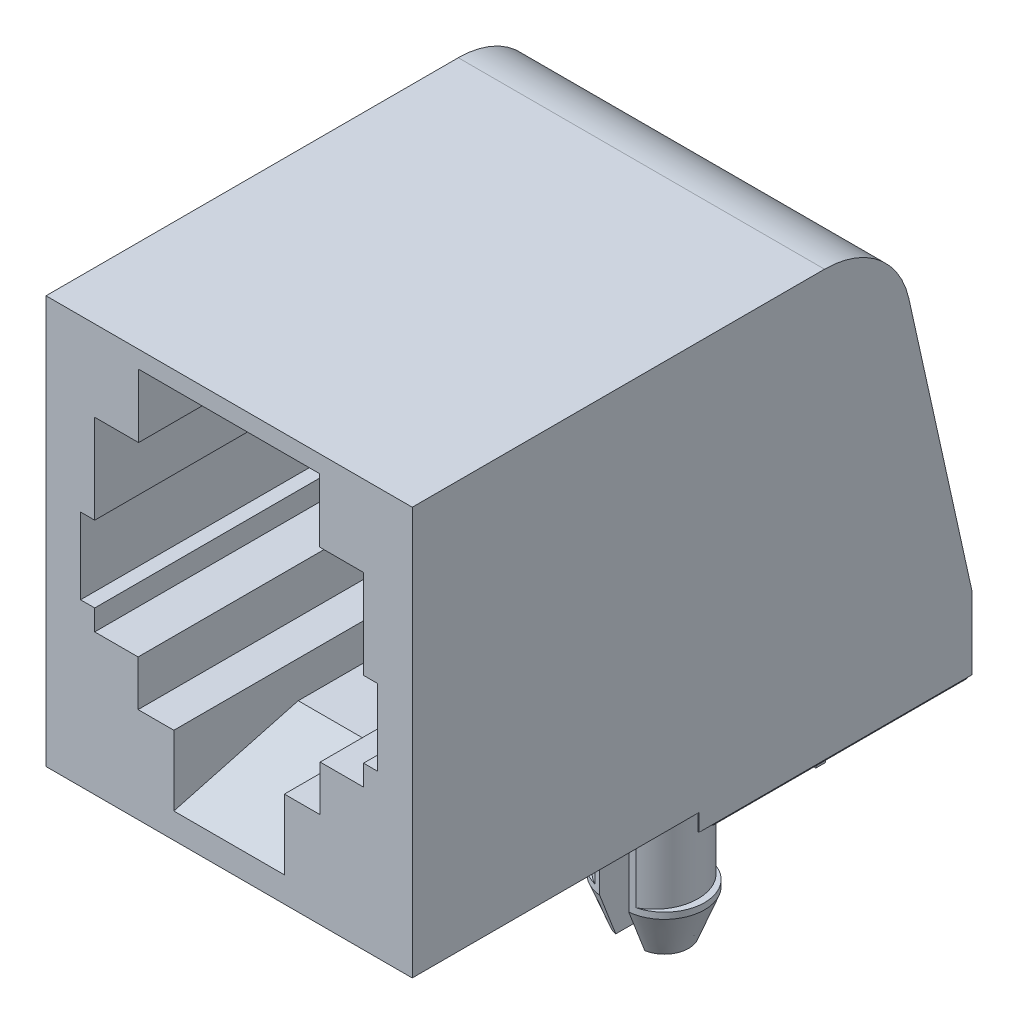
ISO-10303-21;
HEADER;
FILE_DESCRIPTION(('STEP AP214'),'2;1');
FILE_NAME('part.step','',(''),(''),'','','');
FILE_SCHEMA(('AUTOMOTIVE_DESIGN { 1 0 10303 214 1 1 1 1 }'));
ENDSEC;
DATA;
#1=APPLICATION_CONTEXT('core data for automotive mechanical design processes');
#2=APPLICATION_PROTOCOL_DEFINITION('international standard','automotive_design',2000,#1);
#3=PRODUCT_CONTEXT('',#1,'mechanical');
#4=PRODUCT('Part','Part','',(#3));
#5=PRODUCT_RELATED_PRODUCT_CATEGORY('part','',(#4));
#6=PRODUCT_DEFINITION_FORMATION('','',#4);
#7=PRODUCT_DEFINITION_CONTEXT('part definition',#1,'design');
#8=PRODUCT_DEFINITION('design','',#6,#7);
#9=PRODUCT_DEFINITION_SHAPE('','',#8);
#10=(LENGTH_UNIT() NAMED_UNIT(*) SI_UNIT(.MILLI.,.METRE.));
#11=(NAMED_UNIT(*) PLANE_ANGLE_UNIT() SI_UNIT($,.RADIAN.));
#12=(NAMED_UNIT(*) SI_UNIT($,.STERADIAN.) SOLID_ANGLE_UNIT());
#13=UNCERTAINTY_MEASURE_WITH_UNIT(LENGTH_MEASURE(1.E-05),#10,'distance_accuracy_value','');
#14=(GEOMETRIC_REPRESENTATION_CONTEXT(3) GLOBAL_UNCERTAINTY_ASSIGNED_CONTEXT((#13)) GLOBAL_UNIT_ASSIGNED_CONTEXT((#10,
#11,#12)) REPRESENTATION_CONTEXT('',''));
#15=CARTESIAN_POINT('',(0.,0.,0.));
#16=DIRECTION('',(0.,0.,1.));
#17=DIRECTION('',(1.,0.,0.));
#18=AXIS2_PLACEMENT_3D('',#15,#16,#17);
#19=CARTESIAN_POINT('',(-1.6764,-4.318,-16.891));
#20=DIRECTION('',(0.,0.,1.));
#21=DIRECTION('',(1.,0.,0.));
#22=AXIS2_PLACEMENT_3D('',#19,#20,#21);
#23=PLANE('',#22);
#24=DIRECTION('',(0.,1.,0.));
#25=VECTOR('',#24,1.);
#26=CARTESIAN_POINT('',(-1.6764,-4.318,-16.891));
#27=LINE('',#26,#25);
#28=CARTESIAN_POINT('',(-1.6764,0.381,-16.891));
#29=VERTEX_POINT('',#28);
#30=CARTESIAN_POINT('',(-1.6764,-4.318,-16.891));
#31=VERTEX_POINT('',#30);
#32=EDGE_CURVE('E1054',#29,#31,#27,.F.);
#33=ORIENTED_EDGE('',*,*,#32,.F.);
#34=DIRECTION('',(1.,0.,0.));
#35=VECTOR('',#34,1.);
#36=CARTESIAN_POINT('',(-1.6764,0.381,-16.891));
#37=LINE('',#36,#35);
#38=CARTESIAN_POINT('',(-2.1336,0.381,-16.891));
#39=VERTEX_POINT('',#38);
#40=EDGE_CURVE('E1058',#29,#39,#37,.F.);
#41=ORIENTED_EDGE('',*,*,#40,.T.);
#42=DIRECTION('',(0.,1.,0.));
#43=VECTOR('',#42,1.);
#44=CARTESIAN_POINT('',(-2.1336,-4.318,-16.891));
#45=LINE('',#44,#43);
#46=CARTESIAN_POINT('',(-2.1336,-4.318,-16.891));
#47=VERTEX_POINT('',#46);
#48=EDGE_CURVE('E1092',#47,#39,#45,.T.);
#49=ORIENTED_EDGE('',*,*,#48,.F.);
#50=DIRECTION('',(1.,0.,0.));
#51=VECTOR('',#50,1.);
#52=CARTESIAN_POINT('',(0.,-4.318,-16.891));
#53=LINE('',#52,#51);
#54=EDGE_CURVE('E1062',#31,#47,#53,.F.);
#55=ORIENTED_EDGE('',*,*,#54,.F.);
#56=EDGE_LOOP('',(#33,#41,#49,#55));
#57=FACE_BOUND('',#56,.T.);
#58=ADVANCED_FACE('F14',(#57),#23,.T.);
#59=CARTESIAN_POINT('',(-0.406399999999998,-4.318,-19.431));
#60=DIRECTION('',(0.,0.,1.));
#61=DIRECTION('',(1.,0.,0.));
#62=AXIS2_PLACEMENT_3D('',#59,#60,#61);
#63=PLANE('',#62);
#64=DIRECTION('',(0.,1.,0.));
#65=VECTOR('',#64,1.);
#66=CARTESIAN_POINT('',(-0.406399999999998,-4.318,-19.431));
#67=LINE('',#66,#65);
#68=CARTESIAN_POINT('',(-0.406399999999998,0.381,-19.431));
#69=VERTEX_POINT('',#68);
#70=CARTESIAN_POINT('',(-0.406399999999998,-4.318,-19.431));
#71=VERTEX_POINT('',#70);
#72=EDGE_CURVE('E1091',#69,#71,#67,.F.);
#73=ORIENTED_EDGE('',*,*,#72,.F.);
#74=DIRECTION('',(1.,0.,0.));
#75=VECTOR('',#74,1.);
#76=CARTESIAN_POINT('',(-0.406399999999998,0.381,-19.431));
#77=LINE('',#76,#75);
#78=CARTESIAN_POINT('',(-0.863599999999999,0.381,-19.431));
#79=VERTEX_POINT('',#78);
#80=EDGE_CURVE('E2268',#69,#79,#77,.F.);
#81=ORIENTED_EDGE('',*,*,#80,.T.);
#82=DIRECTION('',(0.,1.,0.));
#83=VECTOR('',#82,1.);
#84=CARTESIAN_POINT('',(-0.863599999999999,-4.318,-19.431));
#85=LINE('',#84,#83);
#86=CARTESIAN_POINT('',(-0.863599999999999,-4.318,-19.431));
#87=VERTEX_POINT('',#86);
#88=EDGE_CURVE('E1119',#87,#79,#85,.T.);
#89=ORIENTED_EDGE('',*,*,#88,.F.);
#90=DIRECTION('',(1.,0.,0.));
#91=VECTOR('',#90,1.);
#92=CARTESIAN_POINT('',(0.,-4.318,-19.431));
#93=LINE('',#92,#91);
#94=EDGE_CURVE('E1106',#71,#87,#93,.F.);
#95=ORIENTED_EDGE('',*,*,#94,.F.);
#96=EDGE_LOOP('',(#73,#81,#89,#95));
#97=FACE_BOUND('',#96,.T.);
#98=ADVANCED_FACE('F1041',(#97),#63,.T.);
#99=CARTESIAN_POINT('',(0.863600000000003,-4.318,-16.891));
#100=DIRECTION('',(0.,0.,1.));
#101=DIRECTION('',(1.,0.,0.));
#102=AXIS2_PLACEMENT_3D('',#99,#100,#101);
#103=PLANE('',#102);
#104=DIRECTION('',(0.,1.,0.));
#105=VECTOR('',#104,1.);
#106=CARTESIAN_POINT('',(0.863600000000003,-4.318,-16.891));
#107=LINE('',#106,#105);
#108=CARTESIAN_POINT('',(0.863600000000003,0.381,-16.891));
#109=VERTEX_POINT('',#108);
#110=CARTESIAN_POINT('',(0.863600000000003,-4.318,-16.891));
#111=VERTEX_POINT('',#110);
#112=EDGE_CURVE('E1118',#109,#111,#107,.F.);
#113=ORIENTED_EDGE('',*,*,#112,.F.);
#114=DIRECTION('',(1.,0.,0.));
#115=VECTOR('',#114,1.);
#116=CARTESIAN_POINT('',(0.863600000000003,0.381,-16.891));
#117=LINE('',#116,#115);
#118=CARTESIAN_POINT('',(0.406400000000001,0.381,-16.891));
#119=VERTEX_POINT('',#118);
#120=EDGE_CURVE('E2270',#109,#119,#117,.F.);
#121=ORIENTED_EDGE('',*,*,#120,.T.);
#122=DIRECTION('',(0.,1.,0.));
#123=VECTOR('',#122,1.);
#124=CARTESIAN_POINT('',(0.406400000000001,-4.318,-16.891));
#125=LINE('',#124,#123);
#126=CARTESIAN_POINT('',(0.406400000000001,-4.318,-16.891));
#127=VERTEX_POINT('',#126);
#128=EDGE_CURVE('E1147',#127,#119,#125,.T.);
#129=ORIENTED_EDGE('',*,*,#128,.F.);
#130=DIRECTION('',(1.,0.,0.));
#131=VECTOR('',#130,1.);
#132=CARTESIAN_POINT('',(2.54,-4.318,-16.891));
#133=LINE('',#132,#131);
#134=EDGE_CURVE('E1134',#111,#127,#133,.F.);
#135=ORIENTED_EDGE('',*,*,#134,.F.);
#136=EDGE_LOOP('',(#113,#121,#129,#135));
#137=FACE_BOUND('',#136,.T.);
#138=ADVANCED_FACE('F1037',(#137),#103,.T.);
#139=CARTESIAN_POINT('',(2.1336,-4.318,-19.431));
#140=DIRECTION('',(0.,0.,1.));
#141=DIRECTION('',(1.,0.,0.));
#142=AXIS2_PLACEMENT_3D('',#139,#140,#141);
#143=PLANE('',#142);
#144=DIRECTION('',(0.,1.,0.));
#145=VECTOR('',#144,1.);
#146=CARTESIAN_POINT('',(2.1336,-4.318,-19.431));
#147=LINE('',#146,#145);
#148=CARTESIAN_POINT('',(2.1336,0.381,-19.431));
#149=VERTEX_POINT('',#148);
#150=CARTESIAN_POINT('',(2.1336,-4.318,-19.431));
#151=VERTEX_POINT('',#150);
#152=EDGE_CURVE('E1146',#149,#151,#147,.F.);
#153=ORIENTED_EDGE('',*,*,#152,.F.);
#154=DIRECTION('',(1.,0.,0.));
#155=VECTOR('',#154,1.);
#156=CARTESIAN_POINT('',(2.1336,0.381,-19.431));
#157=LINE('',#156,#155);
#158=CARTESIAN_POINT('',(1.6764,0.381,-19.431));
#159=VERTEX_POINT('',#158);
#160=EDGE_CURVE('E2278',#149,#159,#157,.F.);
#161=ORIENTED_EDGE('',*,*,#160,.T.);
#162=DIRECTION('',(0.,1.,0.));
#163=VECTOR('',#162,1.);
#164=CARTESIAN_POINT('',(1.6764,-4.318,-19.431));
#165=LINE('',#164,#163);
#166=CARTESIAN_POINT('',(1.6764,-4.318,-19.431));
#167=VERTEX_POINT('',#166);
#168=EDGE_CURVE('E1172',#167,#159,#165,.T.);
#169=ORIENTED_EDGE('',*,*,#168,.F.);
#170=DIRECTION('',(1.,0.,0.));
#171=VECTOR('',#170,1.);
#172=CARTESIAN_POINT('',(2.54,-4.318,-19.431));
#173=LINE('',#172,#171);
#174=EDGE_CURVE('E1161',#151,#167,#173,.F.);
#175=ORIENTED_EDGE('',*,*,#174,.F.);
#176=EDGE_LOOP('',(#153,#161,#169,#175));
#177=FACE_BOUND('',#176,.T.);
#178=ADVANCED_FACE('F1033',(#177),#143,.T.);
#179=CARTESIAN_POINT('',(-4.9403,6.1976,0.));
#180=DIRECTION('',(0.,-1.,0.));
#181=DIRECTION('',(0.,0.,-1.));
#182=AXIS2_PLACEMENT_3D('',#179,#180,#181);
#183=PLANE('',#182);
#184=DIRECTION('',(1.,0.,0.));
#185=VECTOR('',#184,1.);
#186=CARTESIAN_POINT('',(-4.9403,6.1976,-11.3284));
#187=LINE('',#186,#185);
#188=CARTESIAN_POINT('',(3.34645,6.1976,-11.3284));
#189=VERTEX_POINT('',#188);
#190=CARTESIAN_POINT('',(4.9403,6.1976,-11.3284));
#191=VERTEX_POINT('',#190);
#192=EDGE_CURVE('E2187',#189,#191,#187,.T.);
#193=ORIENTED_EDGE('',*,*,#192,.F.);
#194=DIRECTION('',(0.,0.,-1.));
#195=VECTOR('',#194,1.);
#196=CARTESIAN_POINT('',(3.34645,6.1976,0.));
#197=LINE('',#196,#195);
#198=CARTESIAN_POINT('',(3.34645,6.1976,0.));
#199=VERTEX_POINT('',#198);
#200=EDGE_CURVE('E1196',#189,#199,#197,.F.);
#201=ORIENTED_EDGE('',*,*,#200,.T.);
#202=DIRECTION('',(1.,0.,0.));
#203=VECTOR('',#202,1.);
#204=CARTESIAN_POINT('',(-4.9403,6.1976,0.));
#205=LINE('',#204,#203);
#206=CARTESIAN_POINT('',(4.9403,6.1976,0.));
#207=VERTEX_POINT('',#206);
#208=EDGE_CURVE('E2189',#207,#199,#205,.F.);
#209=ORIENTED_EDGE('',*,*,#208,.F.);
#210=DIRECTION('',(0.,0.,-1.));
#211=VECTOR('',#210,1.);
#212=CARTESIAN_POINT('',(4.9403,6.1976,0.));
#213=LINE('',#212,#211);
#214=EDGE_CURVE('E1184',#207,#191,#213,.T.);
#215=ORIENTED_EDGE('',*,*,#214,.T.);
#216=EDGE_LOOP('',(#193,#201,#209,#215));
#217=FACE_BOUND('',#216,.T.);
#218=ADVANCED_FACE('F1029',(#217),#183,.F.);
#219=CARTESIAN_POINT('',(-1.3081,8.9916,-13.97));
#220=DIRECTION('',(0.,-0.890847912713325,0.454301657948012));
#221=DIRECTION('',(0.,-0.454301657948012,-0.890847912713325));
#222=AXIS2_PLACEMENT_3D('',#219,#220,#221);
#223=PLANE('',#222);
#224=DIRECTION('',(0.,0.454301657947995,0.890847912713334));
#225=VECTOR('',#224,1.);
#226=CARTESIAN_POINT('',(-1.7399,8.9916,-13.97));
#227=LINE('',#226,#225);
#228=CARTESIAN_POINT('',(-1.7399,8.9916,-13.97));
#229=VERTEX_POINT('',#228);
#230=CARTESIAN_POINT('',(-1.7399,13.2842000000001,-5.55256703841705));
#231=VERTEX_POINT('',#230);
#232=EDGE_CURVE('E2162',#229,#231,#227,.T.);
#233=ORIENTED_EDGE('',*,*,#232,.F.);
#234=DIRECTION('',(1.,0.,0.));
#235=VECTOR('',#234,1.);
#236=CARTESIAN_POINT('',(-1.3081,8.9916,-13.97));
#237=LINE('',#236,#235);
#238=CARTESIAN_POINT('',(-1.3081,8.9916,-13.97));
#239=VERTEX_POINT('',#238);
#240=EDGE_CURVE('E2175',#229,#239,#237,.T.);
#241=ORIENTED_EDGE('',*,*,#240,.T.);
#242=DIRECTION('',(0.,0.454301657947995,0.890847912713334));
#243=VECTOR('',#242,1.);
#244=CARTESIAN_POINT('',(-1.3081,8.9916,-13.97));
#245=LINE('',#244,#243);
#246=CARTESIAN_POINT('',(-1.3081,13.2842,-5.55256703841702));
#247=VERTEX_POINT('',#246);
#248=EDGE_CURVE('E1208',#239,#247,#245,.T.);
#249=ORIENTED_EDGE('',*,*,#248,.T.);
#250=DIRECTION('',(1.,0.,0.));
#251=VECTOR('',#250,1.);
#252=CARTESIAN_POINT('',(-1.3081,13.2842000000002,-5.55256703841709));
#253=LINE('',#252,#251);
#254=EDGE_CURVE('E2178',#247,#231,#253,.F.);
#255=ORIENTED_EDGE('',*,*,#254,.T.);
#256=EDGE_LOOP('',(#233,#241,#249,#255));
#257=FACE_BOUND('',#256,.T.);
#258=ADVANCED_FACE('F1025',(#257),#223,.T.);
#259=CARTESIAN_POINT('',(-0.292099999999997,8.9916,-13.97));
#260=DIRECTION('',(0.,-0.890847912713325,0.454301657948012));
#261=DIRECTION('',(0.,-0.454301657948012,-0.890847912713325));
#262=AXIS2_PLACEMENT_3D('',#259,#260,#261);
#263=PLANE('',#262);
#264=DIRECTION('',(0.,0.454301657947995,0.890847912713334));
#265=VECTOR('',#264,1.);
#266=CARTESIAN_POINT('',(-0.723899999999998,8.9916,-13.97));
#267=LINE('',#266,#265);
#268=CARTESIAN_POINT('',(-0.723899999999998,8.9916,-13.97));
#269=VERTEX_POINT('',#268);
#270=CARTESIAN_POINT('',(-0.723899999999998,13.2842000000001,-5.55256703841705));
#271=VERTEX_POINT('',#270);
#272=EDGE_CURVE('E2192',#269,#271,#267,.T.);
#273=ORIENTED_EDGE('',*,*,#272,.F.);
#274=DIRECTION('',(1.,0.,0.));
#275=VECTOR('',#274,1.);
#276=CARTESIAN_POINT('',(-0.292099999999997,8.9916,-13.97));
#277=LINE('',#276,#275);
#278=CARTESIAN_POINT('',(-0.292099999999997,8.9916,-13.97));
#279=VERTEX_POINT('',#278);
#280=EDGE_CURVE('E2292',#269,#279,#277,.T.);
#281=ORIENTED_EDGE('',*,*,#280,.T.);
#282=DIRECTION('',(0.,0.454301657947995,0.890847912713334));
#283=VECTOR('',#282,1.);
#284=CARTESIAN_POINT('',(-0.292099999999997,8.9916,-13.97));
#285=LINE('',#284,#283);
#286=CARTESIAN_POINT('',(-0.292099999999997,13.2842000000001,-5.55256703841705));
#287=VERTEX_POINT('',#286);
#288=EDGE_CURVE('E1212',#279,#287,#285,.T.);
#289=ORIENTED_EDGE('',*,*,#288,.T.);
#290=DIRECTION('',(1.,0.,0.));
#291=VECTOR('',#290,1.);
#292=CARTESIAN_POINT('',(-0.292099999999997,13.2842000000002,-5.55256703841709));
#293=LINE('',#292,#291);
#294=EDGE_CURVE('E2177',#287,#271,#293,.F.);
#295=ORIENTED_EDGE('',*,*,#294,.T.);
#296=EDGE_LOOP('',(#273,#281,#289,#295));
#297=FACE_BOUND('',#296,.T.);
#298=ADVANCED_FACE('F1021',(#297),#263,.T.);
#299=CARTESIAN_POINT('',(0.723900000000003,8.9916,-13.97));
#300=DIRECTION('',(0.,-0.890847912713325,0.454301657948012));
#301=DIRECTION('',(0.,-0.454301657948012,-0.890847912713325));
#302=AXIS2_PLACEMENT_3D('',#299,#300,#301);
#303=PLANE('',#302);
#304=DIRECTION('',(0.,0.454301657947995,0.890847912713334));
#305=VECTOR('',#304,1.);
#306=CARTESIAN_POINT('',(0.292100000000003,8.9916,-13.97));
#307=LINE('',#306,#305);
#308=CARTESIAN_POINT('',(0.292100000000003,8.9916,-13.97));
#309=VERTEX_POINT('',#308);
#310=CARTESIAN_POINT('',(0.292100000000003,13.2842000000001,-5.55256703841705));
#311=VERTEX_POINT('',#310);
#312=EDGE_CURVE('E2327',#309,#311,#307,.T.);
#313=ORIENTED_EDGE('',*,*,#312,.F.);
#314=DIRECTION('',(1.,0.,0.));
#315=VECTOR('',#314,1.);
#316=CARTESIAN_POINT('',(0.723900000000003,8.9916,-13.97));
#317=LINE('',#316,#315);
#318=CARTESIAN_POINT('',(0.723900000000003,8.9916,-13.97));
#319=VERTEX_POINT('',#318);
#320=EDGE_CURVE('E2300',#309,#319,#317,.T.);
#321=ORIENTED_EDGE('',*,*,#320,.T.);
#322=DIRECTION('',(0.,0.454301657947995,0.890847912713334));
#323=VECTOR('',#322,1.);
#324=CARTESIAN_POINT('',(0.723900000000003,8.9916,-13.97));
#325=LINE('',#324,#323);
#326=CARTESIAN_POINT('',(0.723900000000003,13.2842000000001,-5.55256703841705));
#327=VERTEX_POINT('',#326);
#328=EDGE_CURVE('E1220',#319,#327,#325,.T.);
#329=ORIENTED_EDGE('',*,*,#328,.T.);
#330=DIRECTION('',(1.,0.,0.));
#331=VECTOR('',#330,1.);
#332=CARTESIAN_POINT('',(0.723900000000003,13.2842000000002,-5.55256703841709));
#333=LINE('',#332,#331);
#334=EDGE_CURVE('E2296',#327,#311,#333,.F.);
#335=ORIENTED_EDGE('',*,*,#334,.T.);
#336=EDGE_LOOP('',(#313,#321,#329,#335));
#337=FACE_BOUND('',#336,.T.);
#338=ADVANCED_FACE('F1017',(#337),#303,.T.);
#339=CARTESIAN_POINT('',(1.7399,8.9916,-13.97));
#340=DIRECTION('',(0.,-0.890847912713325,0.454301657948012));
#341=DIRECTION('',(0.,-0.454301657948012,-0.890847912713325));
#342=AXIS2_PLACEMENT_3D('',#339,#340,#341);
#343=PLANE('',#342);
#344=DIRECTION('',(0.,0.454301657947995,0.890847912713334));
#345=VECTOR('',#344,1.);
#346=CARTESIAN_POINT('',(1.3081,8.9916,-13.97));
#347=LINE('',#346,#345);
#348=CARTESIAN_POINT('',(1.3081,8.9916,-13.97));
#349=VERTEX_POINT('',#348);
#350=CARTESIAN_POINT('',(1.3081,13.2842000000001,-5.55256703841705));
#351=VERTEX_POINT('',#350);
#352=EDGE_CURVE('E2264',#349,#351,#347,.T.);
#353=ORIENTED_EDGE('',*,*,#352,.F.);
#354=DIRECTION('',(1.,0.,0.));
#355=VECTOR('',#354,1.);
#356=CARTESIAN_POINT('',(1.7399,8.9916,-13.97));
#357=LINE('',#356,#355);
#358=CARTESIAN_POINT('',(1.7399,8.9916,-13.97));
#359=VERTEX_POINT('',#358);
#360=EDGE_CURVE('E2168',#349,#359,#357,.T.);
#361=ORIENTED_EDGE('',*,*,#360,.T.);
#362=DIRECTION('',(0.,0.454301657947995,0.890847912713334));
#363=VECTOR('',#362,1.);
#364=CARTESIAN_POINT('',(1.7399,8.9916,-13.97));
#365=LINE('',#364,#363);
#366=CARTESIAN_POINT('',(1.7399,13.2842000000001,-5.55256703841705));
#367=VERTEX_POINT('',#366);
#368=EDGE_CURVE('E1228',#359,#367,#365,.T.);
#369=ORIENTED_EDGE('',*,*,#368,.T.);
#370=DIRECTION('',(1.,0.,0.));
#371=VECTOR('',#370,1.);
#372=CARTESIAN_POINT('',(1.7399,13.2842000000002,-5.55256703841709));
#373=LINE('',#372,#371);
#374=EDGE_CURVE('E2171',#367,#351,#373,.F.);
#375=ORIENTED_EDGE('',*,*,#374,.T.);
#376=EDGE_LOOP('',(#353,#361,#369,#375));
#377=FACE_BOUND('',#376,.T.);
#378=ADVANCED_FACE('F1013',(#377),#343,.T.);
#379=CARTESIAN_POINT('',(-4.9403,6.1976,0.));
#380=DIRECTION('',(0.,-1.,0.));
#381=DIRECTION('',(0.,0.,-1.));
#382=AXIS2_PLACEMENT_3D('',#379,#380,#381);
#383=PLANE('',#382);
#384=DIRECTION('',(1.,0.,0.));
#385=VECTOR('',#384,1.);
#386=CARTESIAN_POINT('',(-4.9403,6.1976,-11.3284));
#387=LINE('',#386,#385);
#388=CARTESIAN_POINT('',(-4.9403,6.1976,-11.3284));
#389=VERTEX_POINT('',#388);
#390=CARTESIAN_POINT('',(-3.34645,6.1976,-11.3284));
#391=VERTEX_POINT('',#390);
#392=EDGE_CURVE('E2310',#389,#391,#387,.T.);
#393=ORIENTED_EDGE('',*,*,#392,.F.);
#394=DIRECTION('',(0.,0.,1.));
#395=VECTOR('',#394,1.);
#396=CARTESIAN_POINT('',(-4.9403,6.1976,0.));
#397=LINE('',#396,#395);
#398=CARTESIAN_POINT('',(-4.9403,6.1976,0.));
#399=VERTEX_POINT('',#398);
#400=EDGE_CURVE('E1192',#389,#399,#397,.T.);
#401=ORIENTED_EDGE('',*,*,#400,.T.);
#402=DIRECTION('',(1.,0.,0.));
#403=VECTOR('',#402,1.);
#404=CARTESIAN_POINT('',(-4.9403,6.1976,0.));
#405=LINE('',#404,#403);
#406=CARTESIAN_POINT('',(-3.34645,6.1976,0.));
#407=VERTEX_POINT('',#406);
#408=EDGE_CURVE('E2170',#407,#399,#405,.F.);
#409=ORIENTED_EDGE('',*,*,#408,.F.);
#410=DIRECTION('',(0.,0.,1.));
#411=VECTOR('',#410,1.);
#412=CARTESIAN_POINT('',(-3.34645,6.1976,0.));
#413=LINE('',#412,#411);
#414=EDGE_CURVE('E1240',#407,#391,#413,.F.);
#415=ORIENTED_EDGE('',*,*,#414,.T.);
#416=EDGE_LOOP('',(#393,#401,#409,#415));
#417=FACE_BOUND('',#416,.T.);
#418=ADVANCED_FACE('F1009',(#417),#383,.F.);
#419=CARTESIAN_POINT('',(-1.7399,8.509,0.));
#420=DIRECTION('',(-1.,0.,0.));
#421=DIRECTION('',(0.,0.,1.));
#422=AXIS2_PLACEMENT_3D('',#419,#420,#421);
#423=PLANE('',#422);
#424=ORIENTED_EDGE('',*,*,#232,.T.);
#425=DIRECTION('',(0.,0.,1.));
#426=VECTOR('',#425,1.);
#427=CARTESIAN_POINT('',(-1.7399,13.2842,0.));
#428=LINE('',#427,#426);
#429=CARTESIAN_POINT('',(-1.7399,13.2842,-6.33530686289));
#430=VERTEX_POINT('',#429);
#431=EDGE_CURVE('E2165',#231,#430,#428,.F.);
#432=ORIENTED_EDGE('',*,*,#431,.T.);
#433=DIRECTION('',(0.,0.454301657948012,0.890847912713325));
#434=VECTOR('',#433,1.);
#435=CARTESIAN_POINT('',(-1.7399,13.885503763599,-5.1562));
#436=LINE('',#435,#434);
#437=CARTESIAN_POINT('',(-1.7399,9.39077026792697,-13.97));
#438=VERTEX_POINT('',#437);
#439=EDGE_CURVE('E1243',#438,#430,#436,.T.);
#440=ORIENTED_EDGE('',*,*,#439,.F.);
#441=DIRECTION('',(0.,1.,0.));
#442=VECTOR('',#441,1.);
#443=CARTESIAN_POINT('',(-1.7399,8.509,-13.97));
#444=LINE('',#443,#442);
#445=EDGE_CURVE('E2166',#438,#229,#444,.F.);
#446=ORIENTED_EDGE('',*,*,#445,.T.);
#447=EDGE_LOOP('',(#424,#432,#440,#446));
#448=FACE_BOUND('',#447,.T.);
#449=ADVANCED_FACE('F1005',(#448),#423,.T.);
#450=CARTESIAN_POINT('',(-0.723899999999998,8.509,0.));
#451=DIRECTION('',(-1.,0.,0.));
#452=DIRECTION('',(0.,0.,1.));
#453=AXIS2_PLACEMENT_3D('',#450,#451,#452);
#454=PLANE('',#453);
#455=DIRECTION('',(0.,0.454301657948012,0.890847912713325));
#456=VECTOR('',#455,1.);
#457=CARTESIAN_POINT('',(-0.723899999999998,13.885503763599,-5.1562));
#458=LINE('',#457,#456);
#459=CARTESIAN_POINT('',(-0.723899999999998,9.39077026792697,-13.97));
#460=VERTEX_POINT('',#459);
#461=CARTESIAN_POINT('',(-0.723899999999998,13.2842,-6.33530686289));
#462=VERTEX_POINT('',#461);
#463=EDGE_CURVE('E1251',#460,#462,#458,.T.);
#464=ORIENTED_EDGE('',*,*,#463,.F.);
#465=DIRECTION('',(0.,1.,0.));
#466=VECTOR('',#465,1.);
#467=CARTESIAN_POINT('',(-0.723899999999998,8.509,-13.97));
#468=LINE('',#467,#466);
#469=EDGE_CURVE('E2323',#460,#269,#468,.F.);
#470=ORIENTED_EDGE('',*,*,#469,.T.);
#471=ORIENTED_EDGE('',*,*,#272,.T.);
#472=DIRECTION('',(0.,0.,1.));
#473=VECTOR('',#472,1.);
#474=CARTESIAN_POINT('',(-0.723899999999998,13.2842,0.));
#475=LINE('',#474,#473);
#476=EDGE_CURVE('E2194',#271,#462,#475,.F.);
#477=ORIENTED_EDGE('',*,*,#476,.T.);
#478=EDGE_LOOP('',(#464,#470,#471,#477));
#479=FACE_BOUND('',#478,.T.);
#480=ADVANCED_FACE('F1001',(#479),#454,.T.);
#481=CARTESIAN_POINT('',(0.292100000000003,8.509,0.));
#482=DIRECTION('',(-1.,0.,0.));
#483=DIRECTION('',(0.,0.,1.));
#484=AXIS2_PLACEMENT_3D('',#481,#482,#483);
#485=PLANE('',#484);
#486=DIRECTION('',(0.,0.454301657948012,0.890847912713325));
#487=VECTOR('',#486,1.);
#488=CARTESIAN_POINT('',(0.292100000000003,13.885503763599,-5.1562));
#489=LINE('',#488,#487);
#490=CARTESIAN_POINT('',(0.292100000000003,9.39077026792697,-13.97));
#491=VERTEX_POINT('',#490);
#492=CARTESIAN_POINT('',(0.292100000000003,13.2842,-6.33530686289));
#493=VERTEX_POINT('',#492);
#494=EDGE_CURVE('E1258',#491,#493,#489,.T.);
#495=ORIENTED_EDGE('',*,*,#494,.F.);
#496=DIRECTION('',(0.,1.,0.));
#497=VECTOR('',#496,1.);
#498=CARTESIAN_POINT('',(0.292100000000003,8.509,-13.97));
#499=LINE('',#498,#497);
#500=EDGE_CURVE('E2262',#491,#309,#499,.F.);
#501=ORIENTED_EDGE('',*,*,#500,.T.);
#502=ORIENTED_EDGE('',*,*,#312,.T.);
#503=DIRECTION('',(0.,0.,1.));
#504=VECTOR('',#503,1.);
#505=CARTESIAN_POINT('',(0.292100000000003,13.2842,0.));
#506=LINE('',#505,#504);
#507=EDGE_CURVE('E2265',#311,#493,#506,.F.);
#508=ORIENTED_EDGE('',*,*,#507,.T.);
#509=EDGE_LOOP('',(#495,#501,#502,#508));
#510=FACE_BOUND('',#509,.T.);
#511=ADVANCED_FACE('F997',(#510),#485,.T.);
#512=CARTESIAN_POINT('',(1.3081,8.509,0.));
#513=DIRECTION('',(-1.,0.,0.));
#514=DIRECTION('',(0.,0.,1.));
#515=AXIS2_PLACEMENT_3D('',#512,#513,#514);
#516=PLANE('',#515);
#517=DIRECTION('',(0.,0.454301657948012,0.890847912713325));
#518=VECTOR('',#517,1.);
#519=CARTESIAN_POINT('',(1.3081,13.885503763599,-5.1562));
#520=LINE('',#519,#518);
#521=CARTESIAN_POINT('',(1.3081,9.39077026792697,-13.97));
#522=VERTEX_POINT('',#521);
#523=CARTESIAN_POINT('',(1.3081,13.2842,-6.33530686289));
#524=VERTEX_POINT('',#523);
#525=EDGE_CURVE('E1266',#522,#524,#520,.T.);
#526=ORIENTED_EDGE('',*,*,#525,.F.);
#527=DIRECTION('',(0.,1.,0.));
#528=VECTOR('',#527,1.);
#529=CARTESIAN_POINT('',(1.3081,8.509,-13.97));
#530=LINE('',#529,#528);
#531=EDGE_CURVE('E1070',#522,#349,#530,.F.);
#532=ORIENTED_EDGE('',*,*,#531,.T.);
#533=ORIENTED_EDGE('',*,*,#352,.T.);
#534=DIRECTION('',(0.,0.,1.));
#535=VECTOR('',#534,1.);
#536=CARTESIAN_POINT('',(1.3081,13.2842,0.));
#537=LINE('',#536,#535);
#538=EDGE_CURVE('E1078',#351,#524,#537,.F.);
#539=ORIENTED_EDGE('',*,*,#538,.T.);
#540=EDGE_LOOP('',(#526,#532,#533,#539));
#541=FACE_BOUND('',#540,.T.);
#542=ADVANCED_FACE('F993',(#541),#516,.T.);
#543=CARTESIAN_POINT('',(-4.699,-3.5052,-10.541));
#544=DIRECTION('',(0.,-1.,0.));
#545=DIRECTION('',(0.,0.,-1.));
#546=AXIS2_PLACEMENT_3D('',#543,#544,#545);
#547=PLANE('',#546);
#548=DIRECTION('',(0.,0.,-1.));
#549=VECTOR('',#548,1.);
#550=CARTESIAN_POINT('',(-4.5466,-3.5052,-8.9281));
#551=LINE('',#550,#549);
#552=CARTESIAN_POINT('',(-4.5466,-3.50520000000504,-9.66516026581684));
#553=VERTEX_POINT('',#552);
#554=CARTESIAN_POINT('',(-4.5466,-3.50520000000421,-11.4168397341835));
#555=VERTEX_POINT('',#554);
#556=EDGE_CURVE('E347',#553,#555,#551,.T.);
#557=ORIENTED_EDGE('',*,*,#556,.T.);
#558=CARTESIAN_POINT('',(-4.699,-3.50520000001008,-10.541));
#559=DIRECTION('',(0.,1.,0.));
#560=DIRECTION('',(0.,0.,1.));
#561=AXIS2_PLACEMENT_3D('',#558,#559,#560);
#562=CIRCLE('',#561,0.888999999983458);
#563=EDGE_CURVE('E323',#553,#555,#562,.T.);
#564=ORIENTED_EDGE('',*,*,#563,.F.);
#565=EDGE_LOOP('',(#557,#564));
#566=FACE_BOUND('',#565,.T.);
#567=ADVANCED_FACE('F990',(#566),#547,.T.);
#568=CARTESIAN_POINT('',(-5.461,-3.5052,-10.541));
#569=DIRECTION('',(0.,-1.,0.));
#570=DIRECTION('',(0.,0.,-1.));
#571=AXIS2_PLACEMENT_3D('',#568,#569,#570);
#572=PLANE('',#571);
#573=DIRECTION('',(0.,0.,1.));
#574=VECTOR('',#573,1.);
#575=CARTESIAN_POINT('',(-5.6134,-3.5052,-8.9281));
#576=LINE('',#575,#574);
#577=CARTESIAN_POINT('',(-5.6134,-3.50520000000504,-11.416839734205));
#578=VERTEX_POINT('',#577);
#579=CARTESIAN_POINT('',(-5.6134,-3.50520000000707,-9.66516026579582));
#580=VERTEX_POINT('',#579);
#581=EDGE_CURVE('E329',#578,#580,#576,.T.);
#582=ORIENTED_EDGE('',*,*,#581,.T.);
#583=CARTESIAN_POINT('',(-5.461,-3.50520000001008,-10.541));
#584=DIRECTION('',(0.,1.,0.));
#585=DIRECTION('',(0.,0.,1.));
#586=AXIS2_PLACEMENT_3D('',#583,#584,#585);
#587=CIRCLE('',#586,0.889000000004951);
#588=EDGE_CURVE('E18',#578,#580,#587,.T.);
#589=ORIENTED_EDGE('',*,*,#588,.F.);
#590=EDGE_LOOP('',(#582,#589));
#591=FACE_BOUND('',#590,.T.);
#592=ADVANCED_FACE('F334',(#591),#572,.T.);
#593=CARTESIAN_POINT('',(5.461,-3.5052,-10.541));
#594=DIRECTION('',(0.,-1.,0.));
#595=DIRECTION('',(0.,0.,-1.));
#596=AXIS2_PLACEMENT_3D('',#593,#594,#595);
#597=PLANE('',#596);
#598=CARTESIAN_POINT('',(5.461,-3.50520000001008,-10.541));
#599=DIRECTION('',(0.,1.,0.));
#600=DIRECTION('',(0.,0.,1.));
#601=AXIS2_PLACEMENT_3D('',#598,#599,#600);
#602=CIRCLE('',#601,0.888999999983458);
#603=CARTESIAN_POINT('',(5.6134,-3.50520000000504,-9.66516026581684));
#604=VERTEX_POINT('',#603);
#605=CARTESIAN_POINT('',(5.6134,-3.50520000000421,-11.4168397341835));
#606=VERTEX_POINT('',#605);
#607=EDGE_CURVE('E1191',#604,#606,#602,.T.);
#608=ORIENTED_EDGE('',*,*,#607,.F.);
#609=DIRECTION('',(0.,0.,-1.));
#610=VECTOR('',#609,1.);
#611=CARTESIAN_POINT('',(5.6134,-3.5052,-8.9281));
#612=LINE('',#611,#610);
#613=EDGE_CURVE('E345',#604,#606,#612,.T.);
#614=ORIENTED_EDGE('',*,*,#613,.T.);
#615=EDGE_LOOP('',(#608,#614));
#616=FACE_BOUND('',#615,.T.);
#617=ADVANCED_FACE('F984',(#616),#597,.T.);
#618=CARTESIAN_POINT('',(4.699,-3.5052,-10.541));
#619=DIRECTION('',(0.,-1.,0.));
#620=DIRECTION('',(0.,0.,-1.));
#621=AXIS2_PLACEMENT_3D('',#618,#619,#620);
#622=PLANE('',#621);
#623=CARTESIAN_POINT('',(4.699,-3.50520000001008,-10.541));
#624=DIRECTION('',(0.,1.,0.));
#625=DIRECTION('',(0.,0.,1.));
#626=AXIS2_PLACEMENT_3D('',#623,#624,#625);
#627=CIRCLE('',#626,0.889000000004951);
#628=CARTESIAN_POINT('',(4.5466,-3.50520000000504,-11.416839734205));
#629=VERTEX_POINT('',#628);
#630=CARTESIAN_POINT('',(4.5466,-3.50520000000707,-9.66516026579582));
#631=VERTEX_POINT('',#630);
#632=EDGE_CURVE('E2181',#629,#631,#627,.T.);
#633=ORIENTED_EDGE('',*,*,#632,.F.);
#634=DIRECTION('',(0.,0.,1.));
#635=VECTOR('',#634,1.);
#636=CARTESIAN_POINT('',(4.5466,-3.5052,-8.9281));
#637=LINE('',#636,#635);
#638=EDGE_CURVE('E844',#629,#631,#637,.T.);
#639=ORIENTED_EDGE('',*,*,#638,.T.);
#640=EDGE_LOOP('',(#633,#639));
#641=FACE_BOUND('',#640,.T.);
#642=ADVANCED_FACE('F980',(#641),#622,.T.);
#643=CARTESIAN_POINT('',(-1.6764,-4.318,-17.2466));
#644=DIRECTION('',(1.,0.,0.));
#645=DIRECTION('',(0.,0.,-1.));
#646=AXIS2_PLACEMENT_3D('',#643,#644,#645);
#647=PLANE('',#646);
#648=DIRECTION('',(0.,1.,0.));
#649=VECTOR('',#648,1.);
#650=CARTESIAN_POINT('',(-1.6764,-4.318,-17.2466));
#651=LINE('',#650,#649);
#652=CARTESIAN_POINT('',(-1.6764,0.381,-17.2466));
#653=VERTEX_POINT('',#652);
#654=CARTESIAN_POINT('',(-1.6764,-4.318,-17.2466));
#655=VERTEX_POINT('',#654);
#656=EDGE_CURVE('E854',#653,#655,#651,.F.);
#657=ORIENTED_EDGE('',*,*,#656,.F.);
#658=DIRECTION('',(0.,0.,-1.));
#659=VECTOR('',#658,1.);
#660=CARTESIAN_POINT('',(-1.6764,0.381,-17.2466));
#661=LINE('',#660,#659);
#662=EDGE_CURVE('E1069',#653,#29,#661,.F.);
#663=ORIENTED_EDGE('',*,*,#662,.T.);
#664=ORIENTED_EDGE('',*,*,#32,.T.);
#665=DIRECTION('',(0.,0.,-1.));
#666=VECTOR('',#665,1.);
#667=CARTESIAN_POINT('',(-1.6764,-4.318,0.));
#668=LINE('',#667,#666);
#669=EDGE_CURVE('E1074',#655,#31,#668,.F.);
#670=ORIENTED_EDGE('',*,*,#669,.F.);
#671=EDGE_LOOP('',(#657,#663,#664,#670));
#672=FACE_BOUND('',#671,.T.);
#673=ADVANCED_FACE('F976',(#672),#647,.T.);
#674=CARTESIAN_POINT('',(0.,-4.318,0.));
#675=DIRECTION('',(0.,-1.,0.));
#676=DIRECTION('',(0.,0.,-1.));
#677=AXIS2_PLACEMENT_3D('',#674,#675,#676);
#678=PLANE('',#677);
#679=DIRECTION('',(0.,0.,1.));
#680=VECTOR('',#679,1.);
#681=CARTESIAN_POINT('',(-2.1336,-4.318,-16.891));
#682=LINE('',#681,#680);
#683=CARTESIAN_POINT('',(-2.1336,-4.318,-17.2466));
#684=VERTEX_POINT('',#683);
#685=EDGE_CURVE('E1084',#684,#47,#682,.T.);
#686=ORIENTED_EDGE('',*,*,#685,.F.);
#687=DIRECTION('',(-1.,0.,0.));
#688=VECTOR('',#687,1.);
#689=CARTESIAN_POINT('',(-2.1336,-4.318,-17.2466));
#690=LINE('',#689,#688);
#691=EDGE_CURVE('E1288',#655,#684,#690,.T.);
#692=ORIENTED_EDGE('',*,*,#691,.F.);
#693=ORIENTED_EDGE('',*,*,#669,.T.);
#694=ORIENTED_EDGE('',*,*,#54,.T.);
#695=EDGE_LOOP('',(#686,#692,#693,#694));
#696=FACE_BOUND('',#695,.T.);
#697=ADVANCED_FACE('F972',(#696),#678,.T.);
#698=CARTESIAN_POINT('',(-2.1336,-4.318,-16.891));
#699=DIRECTION('',(-1.,0.,0.));
#700=DIRECTION('',(0.,0.,1.));
#701=AXIS2_PLACEMENT_3D('',#698,#699,#700);
#702=PLANE('',#701);
#703=ORIENTED_EDGE('',*,*,#48,.T.);
#704=DIRECTION('',(0.,0.,1.));
#705=VECTOR('',#704,1.);
#706=CARTESIAN_POINT('',(-2.1336,0.381,-16.891));
#707=LINE('',#706,#705);
#708=CARTESIAN_POINT('',(-2.1336,0.381,-17.2466));
#709=VERTEX_POINT('',#708);
#710=EDGE_CURVE('E1087',#39,#709,#707,.F.);
#711=ORIENTED_EDGE('',*,*,#710,.T.);
#712=DIRECTION('',(0.,1.,0.));
#713=VECTOR('',#712,1.);
#714=CARTESIAN_POINT('',(-2.1336,-4.318,-17.2466));
#715=LINE('',#714,#713);
#716=EDGE_CURVE('E1283',#684,#709,#715,.T.);
#717=ORIENTED_EDGE('',*,*,#716,.F.);
#718=ORIENTED_EDGE('',*,*,#685,.T.);
#719=EDGE_LOOP('',(#703,#711,#717,#718));
#720=FACE_BOUND('',#719,.T.);
#721=ADVANCED_FACE('F968',(#720),#702,.T.);
#722=CARTESIAN_POINT('',(-0.406399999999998,-4.318,-19.7866));
#723=DIRECTION('',(1.,0.,0.));
#724=DIRECTION('',(0.,0.,-1.));
#725=AXIS2_PLACEMENT_3D('',#722,#723,#724);
#726=PLANE('',#725);
#727=DIRECTION('',(0.,1.,0.));
#728=VECTOR('',#727,1.);
#729=CARTESIAN_POINT('',(-0.406399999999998,-4.318,-19.7866));
#730=LINE('',#729,#728);
#731=CARTESIAN_POINT('',(-0.406399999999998,0.381,-19.7866));
#732=VERTEX_POINT('',#731);
#733=CARTESIAN_POINT('',(-0.406399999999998,-4.318,-19.7866));
#734=VERTEX_POINT('',#733);
#735=EDGE_CURVE('E1287',#732,#734,#730,.F.);
#736=ORIENTED_EDGE('',*,*,#735,.F.);
#737=DIRECTION('',(0.,0.,-1.));
#738=VECTOR('',#737,1.);
#739=CARTESIAN_POINT('',(-0.406399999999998,0.381,-19.7866));
#740=LINE('',#739,#738);
#741=EDGE_CURVE('E1098',#732,#69,#740,.F.);
#742=ORIENTED_EDGE('',*,*,#741,.T.);
#743=ORIENTED_EDGE('',*,*,#72,.T.);
#744=DIRECTION('',(0.,0.,-1.));
#745=VECTOR('',#744,1.);
#746=CARTESIAN_POINT('',(-0.406399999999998,-4.318,0.));
#747=LINE('',#746,#745);
#748=EDGE_CURVE('E1102',#734,#71,#747,.F.);
#749=ORIENTED_EDGE('',*,*,#748,.F.);
#750=EDGE_LOOP('',(#736,#742,#743,#749));
#751=FACE_BOUND('',#750,.T.);
#752=ADVANCED_FACE('F964',(#751),#726,.T.);
#753=CARTESIAN_POINT('',(0.,-4.318,0.));
#754=DIRECTION('',(0.,-1.,0.));
#755=DIRECTION('',(0.,0.,-1.));
#756=AXIS2_PLACEMENT_3D('',#753,#754,#755);
#757=PLANE('',#756);
#758=DIRECTION('',(0.,0.,1.));
#759=VECTOR('',#758,1.);
#760=CARTESIAN_POINT('',(-0.863599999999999,-4.318,-19.431));
#761=LINE('',#760,#759);
#762=CARTESIAN_POINT('',(-0.863599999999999,-4.318,-19.7866));
#763=VERTEX_POINT('',#762);
#764=EDGE_CURVE('E1110',#763,#87,#761,.T.);
#765=ORIENTED_EDGE('',*,*,#764,.F.);
#766=DIRECTION('',(-1.,0.,0.));
#767=VECTOR('',#766,1.);
#768=CARTESIAN_POINT('',(-0.863599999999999,-4.318,-19.7866));
#769=LINE('',#768,#767);
#770=EDGE_CURVE('E1300',#734,#763,#769,.T.);
#771=ORIENTED_EDGE('',*,*,#770,.F.);
#772=ORIENTED_EDGE('',*,*,#748,.T.);
#773=ORIENTED_EDGE('',*,*,#94,.T.);
#774=EDGE_LOOP('',(#765,#771,#772,#773));
#775=FACE_BOUND('',#774,.T.);
#776=ADVANCED_FACE('F960',(#775),#757,.T.);
#777=CARTESIAN_POINT('',(-0.863599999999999,-4.318,-19.431));
#778=DIRECTION('',(-1.,0.,0.));
#779=DIRECTION('',(0.,0.,1.));
#780=AXIS2_PLACEMENT_3D('',#777,#778,#779);
#781=PLANE('',#780);
#782=ORIENTED_EDGE('',*,*,#88,.T.);
#783=DIRECTION('',(0.,0.,1.));
#784=VECTOR('',#783,1.);
#785=CARTESIAN_POINT('',(-0.863599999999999,0.381,-19.431));
#786=LINE('',#785,#784);
#787=CARTESIAN_POINT('',(-0.863599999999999,0.381,-19.7866));
#788=VERTEX_POINT('',#787);
#789=EDGE_CURVE('E1114',#79,#788,#786,.F.);
#790=ORIENTED_EDGE('',*,*,#789,.T.);
#791=DIRECTION('',(0.,1.,0.));
#792=VECTOR('',#791,1.);
#793=CARTESIAN_POINT('',(-0.863599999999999,-4.318,-19.7866));
#794=LINE('',#793,#792);
#795=EDGE_CURVE('E1295',#763,#788,#794,.T.);
#796=ORIENTED_EDGE('',*,*,#795,.F.);
#797=ORIENTED_EDGE('',*,*,#764,.T.);
#798=EDGE_LOOP('',(#782,#790,#796,#797));
#799=FACE_BOUND('',#798,.T.);
#800=ADVANCED_FACE('F956',(#799),#781,.T.);
#801=CARTESIAN_POINT('',(0.863600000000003,-4.318,-17.2466));
#802=DIRECTION('',(1.,0.,0.));
#803=DIRECTION('',(0.,0.,-1.));
#804=AXIS2_PLACEMENT_3D('',#801,#802,#803);
#805=PLANE('',#804);
#806=DIRECTION('',(0.,1.,0.));
#807=VECTOR('',#806,1.);
#808=CARTESIAN_POINT('',(0.863600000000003,-4.318,-17.2466));
#809=LINE('',#808,#807);
#810=CARTESIAN_POINT('',(0.863600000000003,0.381,-17.2466));
#811=VERTEX_POINT('',#810);
#812=CARTESIAN_POINT('',(0.863600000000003,-4.318,-17.2466));
#813=VERTEX_POINT('',#812);
#814=EDGE_CURVE('E1299',#811,#813,#809,.F.);
#815=ORIENTED_EDGE('',*,*,#814,.F.);
#816=DIRECTION('',(0.,0.,-1.));
#817=VECTOR('',#816,1.);
#818=CARTESIAN_POINT('',(0.863600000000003,0.381,-17.2466));
#819=LINE('',#818,#817);
#820=EDGE_CURVE('E1126',#811,#109,#819,.F.);
#821=ORIENTED_EDGE('',*,*,#820,.T.);
#822=ORIENTED_EDGE('',*,*,#112,.T.);
#823=DIRECTION('',(0.,0.,-1.));
#824=VECTOR('',#823,1.);
#825=CARTESIAN_POINT('',(0.863600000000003,-4.318,0.));
#826=LINE('',#825,#824);
#827=EDGE_CURVE('E1130',#813,#111,#826,.F.);
#828=ORIENTED_EDGE('',*,*,#827,.F.);
#829=EDGE_LOOP('',(#815,#821,#822,#828));
#830=FACE_BOUND('',#829,.T.);
#831=ADVANCED_FACE('F952',(#830),#805,.T.);
#832=CARTESIAN_POINT('',(2.54,-4.318,0.));
#833=DIRECTION('',(0.,-1.,0.));
#834=DIRECTION('',(0.,0.,-1.));
#835=AXIS2_PLACEMENT_3D('',#832,#833,#834);
#836=PLANE('',#835);
#837=DIRECTION('',(0.,0.,1.));
#838=VECTOR('',#837,1.);
#839=CARTESIAN_POINT('',(0.406400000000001,-4.318,-16.891));
#840=LINE('',#839,#838);
#841=CARTESIAN_POINT('',(0.406400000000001,-4.318,-17.2466));
#842=VERTEX_POINT('',#841);
#843=EDGE_CURVE('E1138',#842,#127,#840,.T.);
#844=ORIENTED_EDGE('',*,*,#843,.F.);
#845=DIRECTION('',(-1.,0.,0.));
#846=VECTOR('',#845,1.);
#847=CARTESIAN_POINT('',(0.406400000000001,-4.318,-17.2466));
#848=LINE('',#847,#846);
#849=EDGE_CURVE('E1312',#813,#842,#848,.T.);
#850=ORIENTED_EDGE('',*,*,#849,.F.);
#851=ORIENTED_EDGE('',*,*,#827,.T.);
#852=ORIENTED_EDGE('',*,*,#134,.T.);
#853=EDGE_LOOP('',(#844,#850,#851,#852));
#854=FACE_BOUND('',#853,.T.);
#855=ADVANCED_FACE('F948',(#854),#836,.T.);
#856=CARTESIAN_POINT('',(0.406400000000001,-4.318,-16.891));
#857=DIRECTION('',(-1.,0.,0.));
#858=DIRECTION('',(0.,0.,1.));
#859=AXIS2_PLACEMENT_3D('',#856,#857,#858);
#860=PLANE('',#859);
#861=ORIENTED_EDGE('',*,*,#128,.T.);
#862=DIRECTION('',(0.,0.,1.));
#863=VECTOR('',#862,1.);
#864=CARTESIAN_POINT('',(0.406400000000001,0.381,-16.891));
#865=LINE('',#864,#863);
#866=CARTESIAN_POINT('',(0.406400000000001,0.381,-17.2466));
#867=VERTEX_POINT('',#866);
#868=EDGE_CURVE('E1142',#119,#867,#865,.F.);
#869=ORIENTED_EDGE('',*,*,#868,.T.);
#870=DIRECTION('',(0.,1.,0.));
#871=VECTOR('',#870,1.);
#872=CARTESIAN_POINT('',(0.406400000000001,-4.318,-17.2466));
#873=LINE('',#872,#871);
#874=EDGE_CURVE('E1307',#842,#867,#873,.T.);
#875=ORIENTED_EDGE('',*,*,#874,.F.);
#876=ORIENTED_EDGE('',*,*,#843,.T.);
#877=EDGE_LOOP('',(#861,#869,#875,#876));
#878=FACE_BOUND('',#877,.T.);
#879=ADVANCED_FACE('F944',(#878),#860,.T.);
#880=CARTESIAN_POINT('',(2.1336,-4.318,-19.7866));
#881=DIRECTION('',(1.,0.,0.));
#882=DIRECTION('',(0.,0.,-1.));
#883=AXIS2_PLACEMENT_3D('',#880,#881,#882);
#884=PLANE('',#883);
#885=DIRECTION('',(0.,1.,0.));
#886=VECTOR('',#885,1.);
#887=CARTESIAN_POINT('',(2.1336,-4.318,-19.7866));
#888=LINE('',#887,#886);
#889=CARTESIAN_POINT('',(2.1336,0.381,-19.7866));
#890=VERTEX_POINT('',#889);
#891=CARTESIAN_POINT('',(2.1336,-4.318,-19.7866));
#892=VERTEX_POINT('',#891);
#893=EDGE_CURVE('E1311',#890,#892,#888,.F.);
#894=ORIENTED_EDGE('',*,*,#893,.F.);
#895=DIRECTION('',(0.,0.,-1.));
#896=VECTOR('',#895,1.);
#897=CARTESIAN_POINT('',(2.1336,0.381,-19.7866));
#898=LINE('',#897,#896);
#899=EDGE_CURVE('E1153',#890,#149,#898,.F.);
#900=ORIENTED_EDGE('',*,*,#899,.T.);
#901=ORIENTED_EDGE('',*,*,#152,.T.);
#902=DIRECTION('',(0.,0.,-1.));
#903=VECTOR('',#902,1.);
#904=CARTESIAN_POINT('',(2.1336,-4.318,0.));
#905=LINE('',#904,#903);
#906=EDGE_CURVE('E1157',#892,#151,#905,.F.);
#907=ORIENTED_EDGE('',*,*,#906,.F.);
#908=EDGE_LOOP('',(#894,#900,#901,#907));
#909=FACE_BOUND('',#908,.T.);
#910=ADVANCED_FACE('F940',(#909),#884,.T.);
#911=CARTESIAN_POINT('',(2.54,-4.318,0.));
#912=DIRECTION('',(0.,-1.,0.));
#913=DIRECTION('',(0.,0.,-1.));
#914=AXIS2_PLACEMENT_3D('',#911,#912,#913);
#915=PLANE('',#914);
#916=DIRECTION('',(0.,0.,1.));
#917=VECTOR('',#916,1.);
#918=CARTESIAN_POINT('',(1.6764,-4.318,-19.431));
#919=LINE('',#918,#917);
#920=CARTESIAN_POINT('',(1.6764,-4.318,-19.7866));
#921=VERTEX_POINT('',#920);
#922=EDGE_CURVE('E1165',#921,#167,#919,.T.);
#923=ORIENTED_EDGE('',*,*,#922,.F.);
#924=DIRECTION('',(-1.,0.,0.));
#925=VECTOR('',#924,1.);
#926=CARTESIAN_POINT('',(1.6764,-4.318,-19.7866));
#927=LINE('',#926,#925);
#928=EDGE_CURVE('E1323',#892,#921,#927,.T.);
#929=ORIENTED_EDGE('',*,*,#928,.F.);
#930=ORIENTED_EDGE('',*,*,#906,.T.);
#931=ORIENTED_EDGE('',*,*,#174,.T.);
#932=EDGE_LOOP('',(#923,#929,#930,#931));
#933=FACE_BOUND('',#932,.T.);
#934=ADVANCED_FACE('F936',(#933),#915,.T.);
#935=CARTESIAN_POINT('',(1.6764,-4.318,-19.431));
#936=DIRECTION('',(-1.,0.,0.));
#937=DIRECTION('',(0.,0.,1.));
#938=AXIS2_PLACEMENT_3D('',#935,#936,#937);
#939=PLANE('',#938);
#940=ORIENTED_EDGE('',*,*,#168,.T.);
#941=DIRECTION('',(0.,0.,1.));
#942=VECTOR('',#941,1.);
#943=CARTESIAN_POINT('',(1.6764,0.381,-19.431));
#944=LINE('',#943,#942);
#945=CARTESIAN_POINT('',(1.6764,0.381,-19.7866));
#946=VERTEX_POINT('',#945);
#947=EDGE_CURVE('E324',#159,#946,#944,.F.);
#948=ORIENTED_EDGE('',*,*,#947,.T.);
#949=DIRECTION('',(0.,1.,0.));
#950=VECTOR('',#949,1.);
#951=CARTESIAN_POINT('',(1.6764,-4.318,-19.7866));
#952=LINE('',#951,#950);
#953=EDGE_CURVE('E1319',#921,#946,#952,.T.);
#954=ORIENTED_EDGE('',*,*,#953,.F.);
#955=ORIENTED_EDGE('',*,*,#922,.T.);
#956=EDGE_LOOP('',(#940,#948,#954,#955));
#957=FACE_BOUND('',#956,.T.);
#958=ADVANCED_FACE('F932',(#957),#939,.T.);
#959=CARTESIAN_POINT('',(-5.461,-1.98330696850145,-10.541));
#960=DIRECTION('',(0.,1.,0.));
#961=DIRECTION('',(0.,0.,1.));
#962=AXIS2_PLACEMENT_3D('',#959,#960,#961);
#963=CONICAL_SURFACE('',#962,1.47319999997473,0.366519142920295);
#964=CARTESIAN_POINT('',(-5.6134,-1.98330696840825,-12.0062960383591));
#965=CARTESIAN_POINT('',(-5.6134,-2.11018999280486,-11.9573260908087));
#966=CARTESIAN_POINT('',(-5.6134,-2.23706514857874,-11.9083357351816));
#967=CARTESIAN_POINT('',(-5.6134,-2.49079083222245,-11.8102915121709));
#968=CARTESIAN_POINT('',(-5.6134,-2.61764136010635,-11.7612376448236));
#969=CARTESIAN_POINT('',(-5.6134,-2.87130909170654,-11.663043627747));
#970=CARTESIAN_POINT('',(-5.6134,-2.99812629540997,-11.6139034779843));
#971=CARTESIAN_POINT('',(-5.6134,-3.25170777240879,-11.5154866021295));
#972=CARTESIAN_POINT('',(-5.6134,-3.37847204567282,-11.4662098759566));
#973=CARTESIAN_POINT('',(-5.6134,-3.5052000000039,-11.4168397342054));
#974=B_SPLINE_CURVE_WITH_KNOTS('',3,(#964,#965,#966,#967,#968,#969,#970,#971,#972,#973),
.UNSPECIFIED.,.F.,.F.,(4,2,2,2,4),(0.,0.408014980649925,0.816029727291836,1.22404463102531,
1.63205977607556),.UNSPECIFIED.);
#975=CARTESIAN_POINT('',(-5.61339999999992,-1.98330696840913,-12.0062960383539));
#976=VERTEX_POINT('',#975);
#977=EDGE_CURVE('E321',#976,#578,#974,.T.);
#978=ORIENTED_EDGE('',*,*,#977,.T.);
#979=ORIENTED_EDGE('',*,*,#588,.T.);
#980=CARTESIAN_POINT('',(-5.6134,-3.50520000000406,-9.66516026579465));
#981=CARTESIAN_POINT('',(-5.6134,-3.30191812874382,-9.58599020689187));
#982=CARTESIAN_POINT('',(-5.6134,-3.09855548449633,-9.50702823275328));
#983=CARTESIAN_POINT('',(-5.6134,-2.691721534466,-9.34938506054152));
#984=CARTESIAN_POINT('',(-5.6134,-2.48825022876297,-9.27070386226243));
#985=CARTESIAN_POINT('',(-5.6134,-2.18427535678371,-9.15328319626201));
#986=CARTESIAN_POINT('',(-5.6134,-2.08379299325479,-9.11448880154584));
#987=CARTESIAN_POINT('',(-5.6134,-1.98330696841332,-9.07570396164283));
#988=B_SPLINE_CURVE_WITH_KNOTS('',3,(#980,#981,#982,#983,#984,#985,#986,#987),.UNSPECIFIED.,.F.,
.F.,(4,2,2,4),(0.,0.65446324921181,1.30892601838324,1.63205970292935),.UNSPECIFIED.);
#989=CARTESIAN_POINT('',(-5.61339999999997,-1.98330696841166,-9.07570396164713));
#990=VERTEX_POINT('',#989);
#991=EDGE_CURVE('E319',#580,#990,#988,.T.);
#992=ORIENTED_EDGE('',*,*,#991,.T.);
#993=CARTESIAN_POINT('',(-5.461,-1.98330696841,-10.541));
#994=DIRECTION('',(0.,-1.,0.));
#995=DIRECTION('',(0.,0.,-1.));
#996=AXIS2_PLACEMENT_3D('',#993,#994,#995);
#997=CIRCLE('',#996,1.4732);
#998=EDGE_CURVE('E841',#976,#990,#997,.F.);
#999=ORIENTED_EDGE('',*,*,#998,.F.);
#1000=EDGE_LOOP('',(#978,#979,#992,#999));
#1001=FACE_BOUND('',#1000,.T.);
#1002=ADVANCED_FACE('F317',(#1001),#963,.T.);
#1003=CARTESIAN_POINT('',(-4.699,-1.98330696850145,-10.541));
#1004=DIRECTION('',(0.,1.,0.));
#1005=DIRECTION('',(0.,0.,1.));
#1006=AXIS2_PLACEMENT_3D('',#1003,#1004,#1005);
#1007=CONICAL_SURFACE('',#1006,1.47319999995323,0.366519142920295);
#1008=CARTESIAN_POINT('',(-4.5466,-3.50519999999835,-11.4168397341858));
#1009=CARTESIAN_POINT('',(-4.5466,-3.30191812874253,-11.4960097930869));
#1010=CARTESIAN_POINT('',(-4.5466,-3.09855548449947,-11.5749717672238));
#1011=CARTESIAN_POINT('',(-4.5466,-2.691721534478,-11.7326149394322));
#1012=CARTESIAN_POINT('',(-4.5466,-2.4882502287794,-11.8112961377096));
#1013=CARTESIAN_POINT('',(-4.5466,-2.18427535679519,-11.9287168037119));
#1014=CARTESIAN_POINT('',(-4.5466,-2.0837929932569,-11.9675111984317));
#1015=CARTESIAN_POINT('',(-4.5466,-1.98330696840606,-12.0062960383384));
#1016=B_SPLINE_CURVE_WITH_KNOTS('',3,(#1008,#1009,#1010,#1011,#1012,#1013,#1014,#1015),
.UNSPECIFIED.,.F.,.F.,(4,2,2,4),(0.,0.654463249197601,1.30892601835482,1.63205970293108),.UNSPECIFIED.);
#1017=CARTESIAN_POINT('',(-4.54660000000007,-1.98330696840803,-12.0062960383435));
#1018=VERTEX_POINT('',#1017);
#1019=EDGE_CURVE('E341',#555,#1018,#1016,.T.);
#1020=ORIENTED_EDGE('',*,*,#1019,.T.);
#1021=CARTESIAN_POINT('',(-4.699,-1.98330696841,-10.541));
#1022=DIRECTION('',(0.,-1.,0.));
#1023=DIRECTION('',(0.,0.,-1.));
#1024=AXIS2_PLACEMENT_3D('',#1021,#1022,#1023);
#1025=CIRCLE('',#1024,1.4732);
#1026=CARTESIAN_POINT('',(-4.54660000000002,-1.98330696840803,-9.07570396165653));
#1027=VERTEX_POINT('',#1026);
#1028=EDGE_CURVE('E811',#1027,#1018,#1025,.F.);
#1029=ORIENTED_EDGE('',*,*,#1028,.F.);
#1030=CARTESIAN_POINT('',(-4.5466,-1.98330696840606,-9.07570396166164));
#1031=CARTESIAN_POINT('',(-4.5466,-2.11018999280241,-9.12467390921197));
#1032=CARTESIAN_POINT('',(-4.5466,-2.23706514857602,-9.17366426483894));
#1033=CARTESIAN_POINT('',(-4.5466,-2.49079083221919,-9.27170848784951));
#1034=CARTESIAN_POINT('',(-4.5466,-2.61764136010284,-9.32076235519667));
#1035=CARTESIAN_POINT('',(-4.5466,-2.87130909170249,-9.41895637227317));
#1036=CARTESIAN_POINT('',(-4.5466,-2.99812629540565,-9.46809652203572));
#1037=CARTESIAN_POINT('',(-4.5466,-3.25170777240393,-9.56651339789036));
#1038=CARTESIAN_POINT('',(-4.5466,-3.37847204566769,-9.61579012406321));
#1039=CARTESIAN_POINT('',(-4.5466,-3.5051999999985,-9.6651602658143));
#1040=B_SPLINE_CURVE_WITH_KNOTS('',3,(#1030,#1031,#1032,#1033,#1034,#1035,#1036,#1037,#1038,
#1039),.UNSPECIFIED.,.F.,.F.,(4,2,2,2,4),(0.,0.408014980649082,0.816029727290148,
1.22404463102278,1.63205977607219),.UNSPECIFIED.);
#1041=EDGE_CURVE('E351',#1027,#553,#1040,.T.);
#1042=ORIENTED_EDGE('',*,*,#1041,.T.);
#1043=ORIENTED_EDGE('',*,*,#563,.T.);
#1044=EDGE_LOOP('',(#1020,#1029,#1042,#1043));
#1045=FACE_BOUND('',#1044,.T.);
#1046=ADVANCED_FACE('F889',(#1045),#1007,.T.);
#1047=CARTESIAN_POINT('',(4.699,-1.98330696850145,-10.541));
#1048=DIRECTION('',(0.,1.,0.));
#1049=DIRECTION('',(0.,0.,1.));
#1050=AXIS2_PLACEMENT_3D('',#1047,#1048,#1049);
#1051=CONICAL_SURFACE('',#1050,1.47319999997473,0.366519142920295);
#1052=ORIENTED_EDGE('',*,*,#632,.T.);
#1053=CARTESIAN_POINT('',(4.5466,-3.50520000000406,-9.66516026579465));
#1054=CARTESIAN_POINT('',(4.5466,-3.30191812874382,-9.58599020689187));
#1055=CARTESIAN_POINT('',(4.5466,-3.09855548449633,-9.50702823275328));
#1056=CARTESIAN_POINT('',(4.5466,-2.691721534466,-9.34938506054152));
#1057=CARTESIAN_POINT('',(4.5466,-2.48825022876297,-9.27070386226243));
#1058=CARTESIAN_POINT('',(4.5466,-2.18427535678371,-9.15328319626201));
#1059=CARTESIAN_POINT('',(4.5466,-2.08379299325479,-9.11448880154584));
#1060=CARTESIAN_POINT('',(4.5466,-1.98330696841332,-9.07570396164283));
#1061=B_SPLINE_CURVE_WITH_KNOTS('',3,(#1053,#1054,#1055,#1056,#1057,#1058,#1059,#1060),
.UNSPECIFIED.,.F.,.F.,(4,2,2,4),(0.,0.654463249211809,1.30892601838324,1.63205970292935),.UNSPECIFIED.);
#1062=CARTESIAN_POINT('',(4.54660000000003,-1.98330696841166,-9.07570396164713));
#1063=VERTEX_POINT('',#1062);
#1064=EDGE_CURVE('E847',#631,#1063,#1061,.T.);
#1065=ORIENTED_EDGE('',*,*,#1064,.T.);
#1066=CARTESIAN_POINT('',(4.699,-1.98330696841,-10.541));
#1067=DIRECTION('',(0.,-1.,0.));
#1068=DIRECTION('',(0.,0.,-1.));
#1069=AXIS2_PLACEMENT_3D('',#1066,#1067,#1068);
#1070=CIRCLE('',#1069,1.4732);
#1071=CARTESIAN_POINT('',(4.54660000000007,-1.98330696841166,-12.0062960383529));
#1072=VERTEX_POINT('',#1071);
#1073=EDGE_CURVE('E776',#1072,#1063,#1070,.F.);
#1074=ORIENTED_EDGE('',*,*,#1073,.F.);
#1075=CARTESIAN_POINT('',(4.5466,-1.98330696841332,-12.0062960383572));
#1076=CARTESIAN_POINT('',(4.5466,-2.1101899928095,-11.9573260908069));
#1077=CARTESIAN_POINT('',(4.5466,-2.23706514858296,-11.90833573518));
#1078=CARTESIAN_POINT('',(4.5466,-2.49079083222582,-11.8102915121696));
#1079=CARTESIAN_POINT('',(4.5466,-2.61764136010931,-11.7612376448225));
#1080=CARTESIAN_POINT('',(4.5466,-2.87130909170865,-11.6630436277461));
#1081=CARTESIAN_POINT('',(4.5466,-2.99812629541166,-11.6139034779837));
#1082=CARTESIAN_POINT('',(4.5466,-3.25170777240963,-11.5154866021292));
#1083=CARTESIAN_POINT('',(4.5466,-3.37847204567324,-11.4662098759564));
#1084=CARTESIAN_POINT('',(4.5466,-3.5052000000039,-11.4168397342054));
#1085=B_SPLINE_CURVE_WITH_KNOTS('',3,(#1075,#1076,#1077,#1078,#1079,#1080,#1081,#1082,#1083,
#1084),.UNSPECIFIED.,.F.,.F.,(4,2,2,2,4),(0.,0.408014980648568,0.81602972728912,
1.22404463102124,1.63205977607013),.UNSPECIFIED.);
#1086=EDGE_CURVE('E848',#1072,#629,#1085,.T.);
#1087=ORIENTED_EDGE('',*,*,#1086,.T.);
#1088=EDGE_LOOP('',(#1052,#1065,#1074,#1087));
#1089=FACE_BOUND('',#1088,.T.);
#1090=ADVANCED_FACE('F884',(#1089),#1051,.T.);
#1091=CARTESIAN_POINT('',(5.461,-1.98330696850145,-10.541));
#1092=DIRECTION('',(0.,1.,0.));
#1093=DIRECTION('',(0.,0.,1.));
#1094=AXIS2_PLACEMENT_3D('',#1091,#1092,#1093);
#1095=CONICAL_SURFACE('',#1094,1.47319999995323,0.366519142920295);
#1096=ORIENTED_EDGE('',*,*,#607,.T.);
#1097=CARTESIAN_POINT('',(5.6134,-3.50519999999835,-11.4168397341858));
#1098=CARTESIAN_POINT('',(5.6134,-3.30191812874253,-11.4960097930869));
#1099=CARTESIAN_POINT('',(5.6134,-3.09855548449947,-11.5749717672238));
#1100=CARTESIAN_POINT('',(5.6134,-2.691721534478,-11.7326149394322));
#1101=CARTESIAN_POINT('',(5.6134,-2.4882502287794,-11.8112961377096));
#1102=CARTESIAN_POINT('',(5.6134,-2.18427535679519,-11.9287168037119));
#1103=CARTESIAN_POINT('',(5.6134,-2.0837929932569,-11.9675111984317));
#1104=CARTESIAN_POINT('',(5.6134,-1.98330696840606,-12.0062960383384));
#1105=B_SPLINE_CURVE_WITH_KNOTS('',3,(#1097,#1098,#1099,#1100,#1101,#1102,#1103,#1104),
.UNSPECIFIED.,.F.,.F.,(4,2,2,4),(0.,0.654463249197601,1.30892601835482,1.63205970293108),.UNSPECIFIED.);
#1106=CARTESIAN_POINT('',(5.61339999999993,-1.98330696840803,-12.0062960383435));
#1107=VERTEX_POINT('',#1106);
#1108=EDGE_CURVE('E858',#606,#1107,#1105,.T.);
#1109=ORIENTED_EDGE('',*,*,#1108,.T.);
#1110=CARTESIAN_POINT('',(5.461,-1.98330696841,-10.541));
#1111=DIRECTION('',(0.,-1.,0.));
#1112=DIRECTION('',(0.,0.,-1.));
#1113=AXIS2_PLACEMENT_3D('',#1110,#1111,#1112);
#1114=CIRCLE('',#1113,1.4732);
#1115=CARTESIAN_POINT('',(5.61339999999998,-1.98330696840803,-9.07570396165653));
#1116=VERTEX_POINT('',#1115);
#1117=EDGE_CURVE('E788',#1116,#1107,#1114,.F.);
#1118=ORIENTED_EDGE('',*,*,#1117,.F.);
#1119=CARTESIAN_POINT('',(5.6134,-1.98330696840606,-9.07570396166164));
#1120=CARTESIAN_POINT('',(5.6134,-2.11018999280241,-9.12467390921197));
#1121=CARTESIAN_POINT('',(5.6134,-2.23706514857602,-9.17366426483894));
#1122=CARTESIAN_POINT('',(5.6134,-2.49079083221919,-9.27170848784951));
#1123=CARTESIAN_POINT('',(5.6134,-2.61764136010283,-9.32076235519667));
#1124=CARTESIAN_POINT('',(5.6134,-2.87130909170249,-9.41895637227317));
#1125=CARTESIAN_POINT('',(5.6134,-2.99812629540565,-9.46809652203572));
#1126=CARTESIAN_POINT('',(5.6134,-3.25170777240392,-9.56651339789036));
#1127=CARTESIAN_POINT('',(5.6134,-3.37847204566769,-9.6157901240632));
#1128=CARTESIAN_POINT('',(5.6134,-3.5051999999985,-9.66516026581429));
#1129=B_SPLINE_CURVE_WITH_KNOTS('',3,(#1119,#1120,#1121,#1122,#1123,#1124,#1125,#1126,#1127,
#1128),.UNSPECIFIED.,.F.,.F.,(4,2,2,2,4),(0.,0.40801498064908,0.816029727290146,
1.22404463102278,1.63205977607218),.UNSPECIFIED.);
#1130=EDGE_CURVE('E332',#1116,#604,#1129,.T.);
#1131=ORIENTED_EDGE('',*,*,#1130,.T.);
#1132=EDGE_LOOP('',(#1096,#1109,#1118,#1131));
#1133=FACE_BOUND('',#1132,.T.);
#1134=ADVANCED_FACE('F888',(#1133),#1095,.T.);
#1135=CARTESIAN_POINT('',(4.9403,6.1976,0.));
#1136=DIRECTION('',(1.,0.,0.));
#1137=DIRECTION('',(0.,0.,-1.));
#1138=AXIS2_PLACEMENT_3D('',#1135,#1136,#1137);
#1139=PLANE('',#1138);
#1140=DIRECTION('',(0.,1.,0.));
#1141=VECTOR('',#1140,1.);
#1142=CARTESIAN_POINT('',(4.9403,6.1976,-11.3284));
#1143=LINE('',#1142,#1141);
#1144=CARTESIAN_POINT('',(4.9403,6.9596,-11.3284));
#1145=VERTEX_POINT('',#1144);
#1146=EDGE_CURVE('E1179',#191,#1145,#1143,.T.);
#1147=ORIENTED_EDGE('',*,*,#1146,.F.);
#1148=ORIENTED_EDGE('',*,*,#214,.F.);
#1149=DIRECTION('',(0.,1.,0.));
#1150=VECTOR('',#1149,1.);
#1151=CARTESIAN_POINT('',(4.9403,6.1976,0.));
#1152=LINE('',#1151,#1150);
#1153=CARTESIAN_POINT('',(4.9403,6.9596,0.));
#1154=VERTEX_POINT('',#1153);
#1155=EDGE_CURVE('E1188',#1154,#207,#1152,.F.);
#1156=ORIENTED_EDGE('',*,*,#1155,.F.);
#1157=DIRECTION('',(0.,0.,-1.));
#1158=VECTOR('',#1157,1.);
#1159=CARTESIAN_POINT('',(4.9403,6.9596,0.));
#1160=LINE('',#1159,#1158);
#1161=EDGE_CURVE('E1359',#1154,#1145,#1160,.T.);
#1162=ORIENTED_EDGE('',*,*,#1161,.T.);
#1163=EDGE_LOOP('',(#1147,#1148,#1156,#1162));
#1164=FACE_BOUND('',#1163,.T.);
#1165=ADVANCED_FACE('F896',(#1164),#1139,.F.);
#1166=CARTESIAN_POINT('',(-4.9403,6.9596,0.));
#1167=DIRECTION('',(-1.,0.,0.));
#1168=DIRECTION('',(0.,0.,1.));
#1169=AXIS2_PLACEMENT_3D('',#1166,#1167,#1168);
#1170=PLANE('',#1169);
#1171=DIRECTION('',(0.,1.,0.));
#1172=VECTOR('',#1171,1.);
#1173=CARTESIAN_POINT('',(-4.9403,8.509,-11.3284));
#1174=LINE('',#1173,#1172);
#1175=CARTESIAN_POINT('',(-4.9403,6.9596,-11.3284));
#1176=VERTEX_POINT('',#1175);
#1177=EDGE_CURVE('E1399',#1176,#389,#1174,.F.);
#1178=ORIENTED_EDGE('',*,*,#1177,.F.);
#1179=DIRECTION('',(0.,0.,-1.));
#1180=VECTOR('',#1179,1.);
#1181=CARTESIAN_POINT('',(-4.9403,6.9596,0.));
#1182=LINE('',#1181,#1180);
#1183=CARTESIAN_POINT('',(-4.9403,6.9596,0.));
#1184=VERTEX_POINT('',#1183);
#1185=EDGE_CURVE('E1415',#1176,#1184,#1182,.F.);
#1186=ORIENTED_EDGE('',*,*,#1185,.T.);
#1187=DIRECTION('',(0.,1.,0.));
#1188=VECTOR('',#1187,1.);
#1189=CARTESIAN_POINT('',(-4.9403,6.9596,0.));
#1190=LINE('',#1189,#1188);
#1191=EDGE_CURVE('E1183',#399,#1184,#1190,.T.);
#1192=ORIENTED_EDGE('',*,*,#1191,.F.);
#1193=ORIENTED_EDGE('',*,*,#400,.F.);
#1194=EDGE_LOOP('',(#1178,#1186,#1192,#1193));
#1195=FACE_BOUND('',#1194,.T.);
#1196=ADVANCED_FACE('F2669',(#1195),#1170,.F.);
#1197=CARTESIAN_POINT('',(3.34645,4.5212,0.));
#1198=DIRECTION('',(1.,0.,0.));
#1199=DIRECTION('',(0.,0.,-1.));
#1200=AXIS2_PLACEMENT_3D('',#1197,#1198,#1199);
#1201=PLANE('',#1200);
#1202=DIRECTION('',(0.,1.,0.));
#1203=VECTOR('',#1202,1.);
#1204=CARTESIAN_POINT('',(3.34645,8.509,-13.97));
#1205=LINE('',#1204,#1203);
#1206=CARTESIAN_POINT('',(3.34645,4.5212,-13.97));
#1207=VERTEX_POINT('',#1206);
#1208=CARTESIAN_POINT('',(3.34645,8.3566,-13.97));
#1209=VERTEX_POINT('',#1208);
#1210=EDGE_CURVE('E1480',#1207,#1209,#1205,.T.);
#1211=ORIENTED_EDGE('',*,*,#1210,.F.);
#1212=DIRECTION('',(0.,0.,-1.));
#1213=VECTOR('',#1212,1.);
#1214=CARTESIAN_POINT('',(3.34645,4.5212,0.));
#1215=LINE('',#1214,#1213);
#1216=CARTESIAN_POINT('',(3.34645,4.5212,0.));
#1217=VERTEX_POINT('',#1216);
#1218=EDGE_CURVE('E1387',#1207,#1217,#1215,.F.);
#1219=ORIENTED_EDGE('',*,*,#1218,.T.);
#1220=DIRECTION('',(0.,1.,0.));
#1221=VECTOR('',#1220,1.);
#1222=CARTESIAN_POINT('',(3.34645,4.5212,0.));
#1223=LINE('',#1222,#1221);
#1224=EDGE_CURVE('E1200',#199,#1217,#1223,.F.);
#1225=ORIENTED_EDGE('',*,*,#1224,.F.);
#1226=ORIENTED_EDGE('',*,*,#200,.F.);
#1227=DIRECTION('',(0.,1.,0.));
#1228=VECTOR('',#1227,1.);
#1229=CARTESIAN_POINT('',(3.34645,8.509,-11.3284));
#1230=LINE('',#1229,#1228);
#1231=CARTESIAN_POINT('',(3.34645,8.3566,-11.3284));
#1232=VERTEX_POINT('',#1231);
#1233=EDGE_CURVE('E1367',#1232,#189,#1230,.F.);
#1234=ORIENTED_EDGE('',*,*,#1233,.F.);
#1235=DIRECTION('',(0.,0.,-1.));
#1236=VECTOR('',#1235,1.);
#1237=CARTESIAN_POINT('',(3.34645,8.3566,0.));
#1238=LINE('',#1237,#1236);
#1239=EDGE_CURVE('E1346',#1232,#1209,#1238,.T.);
#1240=ORIENTED_EDGE('',*,*,#1239,.T.);
#1241=EDGE_LOOP('',(#1211,#1219,#1225,#1226,#1234,#1240));
#1242=FACE_BOUND('',#1241,.T.);
#1243=ADVANCED_FACE('F2662',(#1242),#1201,.F.);
#1244=CARTESIAN_POINT('',(-1.3081,8.509,0.));
#1245=DIRECTION('',(-1.,0.,0.));
#1246=DIRECTION('',(0.,0.,1.));
#1247=AXIS2_PLACEMENT_3D('',#1244,#1245,#1246);
#1248=PLANE('',#1247);
#1249=DIRECTION('',(0.,1.,0.));
#1250=VECTOR('',#1249,1.);
#1251=CARTESIAN_POINT('',(-1.3081,8.509,-13.97));
#1252=LINE('',#1251,#1250);
#1253=CARTESIAN_POINT('',(-1.3081,9.39077026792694,-13.97));
#1254=VERTEX_POINT('',#1253);
#1255=EDGE_CURVE('E1460',#1254,#239,#1252,.F.);
#1256=ORIENTED_EDGE('',*,*,#1255,.F.);
#1257=DIRECTION('',(0.,0.454301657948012,0.890847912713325));
#1258=VECTOR('',#1257,1.);
#1259=CARTESIAN_POINT('',(-1.3081,13.885503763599,-5.1562));
#1260=LINE('',#1259,#1258);
#1261=CARTESIAN_POINT('',(-1.3081,13.2842,-6.33530686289));
#1262=VERTEX_POINT('',#1261);
#1263=EDGE_CURVE('E1247',#1262,#1254,#1260,.F.);
#1264=ORIENTED_EDGE('',*,*,#1263,.F.);
#1265=DIRECTION('',(0.,0.,1.));
#1266=VECTOR('',#1265,1.);
#1267=CARTESIAN_POINT('',(-1.3081,13.2842,0.));
#1268=LINE('',#1267,#1266);
#1269=EDGE_CURVE('E1204',#247,#1262,#1268,.F.);
#1270=ORIENTED_EDGE('',*,*,#1269,.F.);
#1271=ORIENTED_EDGE('',*,*,#248,.F.);
#1272=EDGE_LOOP('',(#1256,#1264,#1270,#1271));
#1273=FACE_BOUND('',#1272,.T.);
#1274=ADVANCED_FACE('F2655',(#1273),#1248,.F.);
#1275=CARTESIAN_POINT('',(-0.292099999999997,8.509,0.));
#1276=DIRECTION('',(-1.,0.,0.));
#1277=DIRECTION('',(0.,0.,1.));
#1278=AXIS2_PLACEMENT_3D('',#1275,#1276,#1277);
#1279=PLANE('',#1278);
#1280=DIRECTION('',(0.,0.,1.));
#1281=VECTOR('',#1280,1.);
#1282=CARTESIAN_POINT('',(-0.292099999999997,13.2842,0.));
#1283=LINE('',#1282,#1281);
#1284=CARTESIAN_POINT('',(-0.292099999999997,13.2842,-6.33530686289));
#1285=VERTEX_POINT('',#1284);
#1286=EDGE_CURVE('E1216',#287,#1285,#1283,.F.);
#1287=ORIENTED_EDGE('',*,*,#1286,.F.);
#1288=ORIENTED_EDGE('',*,*,#288,.F.);
#1289=DIRECTION('',(0.,1.,0.));
#1290=VECTOR('',#1289,1.);
#1291=CARTESIAN_POINT('',(-0.292099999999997,8.509,-13.97));
#1292=LINE('',#1291,#1290);
#1293=CARTESIAN_POINT('',(-0.292099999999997,9.39077026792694,-13.97));
#1294=VERTEX_POINT('',#1293);
#1295=EDGE_CURVE('E1452',#1294,#279,#1292,.F.);
#1296=ORIENTED_EDGE('',*,*,#1295,.F.);
#1297=DIRECTION('',(0.,0.454301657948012,0.890847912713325));
#1298=VECTOR('',#1297,1.);
#1299=CARTESIAN_POINT('',(-0.292099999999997,13.885503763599,-5.1562));
#1300=LINE('',#1299,#1298);
#1301=EDGE_CURVE('E1254',#1285,#1294,#1300,.F.);
#1302=ORIENTED_EDGE('',*,*,#1301,.F.);
#1303=EDGE_LOOP('',(#1287,#1288,#1296,#1302));
#1304=FACE_BOUND('',#1303,.T.);
#1305=ADVANCED_FACE('F2648',(#1304),#1279,.F.);
#1306=CARTESIAN_POINT('',(0.723900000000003,8.509,0.));
#1307=DIRECTION('',(-1.,0.,0.));
#1308=DIRECTION('',(0.,0.,1.));
#1309=AXIS2_PLACEMENT_3D('',#1306,#1307,#1308);
#1310=PLANE('',#1309);
#1311=DIRECTION('',(0.,0.,1.));
#1312=VECTOR('',#1311,1.);
#1313=CARTESIAN_POINT('',(0.723900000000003,13.2842,0.));
#1314=LINE('',#1313,#1312);
#1315=CARTESIAN_POINT('',(0.723900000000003,13.2842,-6.33530686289));
#1316=VERTEX_POINT('',#1315);
#1317=EDGE_CURVE('E1224',#327,#1316,#1314,.F.);
#1318=ORIENTED_EDGE('',*,*,#1317,.F.);
#1319=ORIENTED_EDGE('',*,*,#328,.F.);
#1320=DIRECTION('',(0.,1.,0.));
#1321=VECTOR('',#1320,1.);
#1322=CARTESIAN_POINT('',(0.723900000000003,8.509,-13.97));
#1323=LINE('',#1322,#1321);
#1324=CARTESIAN_POINT('',(0.723900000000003,9.39077026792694,-13.97));
#1325=VERTEX_POINT('',#1324);
#1326=EDGE_CURVE('E1444',#1325,#319,#1323,.F.);
#1327=ORIENTED_EDGE('',*,*,#1326,.F.);
#1328=DIRECTION('',(0.,0.454301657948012,0.890847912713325));
#1329=VECTOR('',#1328,1.);
#1330=CARTESIAN_POINT('',(0.723900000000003,13.885503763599,-5.1562));
#1331=LINE('',#1330,#1329);
#1332=EDGE_CURVE('E1262',#1316,#1325,#1331,.F.);
#1333=ORIENTED_EDGE('',*,*,#1332,.F.);
#1334=EDGE_LOOP('',(#1318,#1319,#1327,#1333));
#1335=FACE_BOUND('',#1334,.T.);
#1336=ADVANCED_FACE('F2641',(#1335),#1310,.F.);
#1337=CARTESIAN_POINT('',(1.7399,8.509,0.));
#1338=DIRECTION('',(-1.,0.,0.));
#1339=DIRECTION('',(0.,0.,1.));
#1340=AXIS2_PLACEMENT_3D('',#1337,#1338,#1339);
#1341=PLANE('',#1340);
#1342=DIRECTION('',(0.,0.,1.));
#1343=VECTOR('',#1342,1.);
#1344=CARTESIAN_POINT('',(1.7399,13.2842,0.));
#1345=LINE('',#1344,#1343);
#1346=CARTESIAN_POINT('',(1.7399,13.2842,-6.33530686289));
#1347=VERTEX_POINT('',#1346);
#1348=EDGE_CURVE('E1232',#367,#1347,#1345,.F.);
#1349=ORIENTED_EDGE('',*,*,#1348,.F.);
#1350=ORIENTED_EDGE('',*,*,#368,.F.);
#1351=DIRECTION('',(0.,1.,0.));
#1352=VECTOR('',#1351,1.);
#1353=CARTESIAN_POINT('',(1.7399,8.509,-13.97));
#1354=LINE('',#1353,#1352);
#1355=CARTESIAN_POINT('',(1.7399,9.39077026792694,-13.97));
#1356=VERTEX_POINT('',#1355);
#1357=EDGE_CURVE('E1435',#1356,#359,#1354,.F.);
#1358=ORIENTED_EDGE('',*,*,#1357,.F.);
#1359=DIRECTION('',(0.,0.454301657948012,0.890847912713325));
#1360=VECTOR('',#1359,1.);
#1361=CARTESIAN_POINT('',(1.7399,13.885503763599,-5.1562));
#1362=LINE('',#1361,#1360);
#1363=EDGE_CURVE('E1269',#1347,#1356,#1362,.F.);
#1364=ORIENTED_EDGE('',*,*,#1363,.F.);
#1365=EDGE_LOOP('',(#1349,#1350,#1358,#1364));
#1366=FACE_BOUND('',#1365,.T.);
#1367=ADVANCED_FACE('F2634',(#1366),#1341,.F.);
#1368=CARTESIAN_POINT('',(-3.34645,8.3566,0.));
#1369=DIRECTION('',(-1.,0.,0.));
#1370=DIRECTION('',(0.,0.,1.));
#1371=AXIS2_PLACEMENT_3D('',#1368,#1369,#1370);
#1372=PLANE('',#1371);
#1373=DIRECTION('',(0.,1.,0.));
#1374=VECTOR('',#1373,1.);
#1375=CARTESIAN_POINT('',(-3.34645,8.3566,0.));
#1376=LINE('',#1375,#1374);
#1377=CARTESIAN_POINT('',(-3.34645,4.5212,0.));
#1378=VERTEX_POINT('',#1377);
#1379=EDGE_CURVE('E1236',#1378,#407,#1376,.T.);
#1380=ORIENTED_EDGE('',*,*,#1379,.F.);
#1381=DIRECTION('',(0.,0.,-1.));
#1382=VECTOR('',#1381,1.);
#1383=CARTESIAN_POINT('',(-3.34645,4.5212,0.));
#1384=LINE('',#1383,#1382);
#1385=CARTESIAN_POINT('',(-3.34645,4.5212,-13.97));
#1386=VERTEX_POINT('',#1385);
#1387=EDGE_CURVE('E1395',#1378,#1386,#1384,.T.);
#1388=ORIENTED_EDGE('',*,*,#1387,.T.);
#1389=DIRECTION('',(0.,1.,0.));
#1390=VECTOR('',#1389,1.);
#1391=CARTESIAN_POINT('',(-3.34645,8.509,-13.97));
#1392=LINE('',#1391,#1390);
#1393=CARTESIAN_POINT('',(-3.34645,8.3566,-13.97));
#1394=VERTEX_POINT('',#1393);
#1395=EDGE_CURVE('E1431',#1394,#1386,#1392,.F.);
#1396=ORIENTED_EDGE('',*,*,#1395,.F.);
#1397=DIRECTION('',(0.,0.,-1.));
#1398=VECTOR('',#1397,1.);
#1399=CARTESIAN_POINT('',(-3.34645,8.3566,0.));
#1400=LINE('',#1399,#1398);
#1401=CARTESIAN_POINT('',(-3.34645,8.3566,-11.3284));
#1402=VERTEX_POINT('',#1401);
#1403=EDGE_CURVE('E1499',#1394,#1402,#1400,.F.);
#1404=ORIENTED_EDGE('',*,*,#1403,.T.);
#1405=DIRECTION('',(0.,1.,0.));
#1406=VECTOR('',#1405,1.);
#1407=CARTESIAN_POINT('',(-3.34645,8.509,-11.3284));
#1408=LINE('',#1407,#1406);
#1409=EDGE_CURVE('E1408',#391,#1402,#1408,.T.);
#1410=ORIENTED_EDGE('',*,*,#1409,.F.);
#1411=ORIENTED_EDGE('',*,*,#414,.F.);
#1412=EDGE_LOOP('',(#1380,#1388,#1396,#1404,#1410,#1411));
#1413=FACE_BOUND('',#1412,.T.);
#1414=ADVANCED_FACE('F2627',(#1413),#1372,.F.);
#1415=CARTESIAN_POINT('',(-1.3081,13.885503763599,-5.1562));
#1416=DIRECTION('',(0.,0.890847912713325,-0.454301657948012));
#1417=DIRECTION('',(0.,0.454301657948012,0.890847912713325));
#1418=AXIS2_PLACEMENT_3D('',#1415,#1416,#1417);
#1419=PLANE('',#1418);
#1420=ORIENTED_EDGE('',*,*,#1263,.T.);
#1421=DIRECTION('',(1.,0.,0.));
#1422=VECTOR('',#1421,1.);
#1423=CARTESIAN_POINT('',(6.731,9.390770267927,-13.97));
#1424=LINE('',#1423,#1422);
#1425=EDGE_CURVE('E1464',#438,#1254,#1424,.T.);
#1426=ORIENTED_EDGE('',*,*,#1425,.F.);
#1427=ORIENTED_EDGE('',*,*,#439,.T.);
#1428=DIRECTION('',(1.,0.,0.));
#1429=VECTOR('',#1428,1.);
#1430=CARTESIAN_POINT('',(3.3274,13.2842,-6.33530686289));
#1431=LINE('',#1430,#1429);
#1432=EDGE_CURVE('E1524',#430,#1262,#1431,.T.);
#1433=ORIENTED_EDGE('',*,*,#1432,.T.);
#1434=EDGE_LOOP('',(#1420,#1426,#1427,#1433));
#1435=FACE_BOUND('',#1434,.T.);
#1436=ADVANCED_FACE('F2620',(#1435),#1419,.T.);
#1437=CARTESIAN_POINT('',(-0.292099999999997,13.885503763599,-5.1562));
#1438=DIRECTION('',(0.,0.890847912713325,-0.454301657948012));
#1439=DIRECTION('',(0.,0.454301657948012,0.890847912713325));
#1440=AXIS2_PLACEMENT_3D('',#1437,#1438,#1439);
#1441=PLANE('',#1440);
#1442=ORIENTED_EDGE('',*,*,#1301,.T.);
#1443=DIRECTION('',(1.,0.,0.));
#1444=VECTOR('',#1443,1.);
#1445=CARTESIAN_POINT('',(6.731,9.390770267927,-13.97));
#1446=LINE('',#1445,#1444);
#1447=EDGE_CURVE('E1456',#460,#1294,#1446,.T.);
#1448=ORIENTED_EDGE('',*,*,#1447,.F.);
#1449=ORIENTED_EDGE('',*,*,#463,.T.);
#1450=DIRECTION('',(1.,0.,0.));
#1451=VECTOR('',#1450,1.);
#1452=CARTESIAN_POINT('',(3.3274,13.2842,-6.33530686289));
#1453=LINE('',#1452,#1451);
#1454=EDGE_CURVE('E1520',#462,#1285,#1453,.T.);
#1455=ORIENTED_EDGE('',*,*,#1454,.T.);
#1456=EDGE_LOOP('',(#1442,#1448,#1449,#1455));
#1457=FACE_BOUND('',#1456,.T.);
#1458=ADVANCED_FACE('F2613',(#1457),#1441,.T.);
#1459=CARTESIAN_POINT('',(0.723900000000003,13.885503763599,-5.1562));
#1460=DIRECTION('',(0.,0.890847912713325,-0.454301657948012));
#1461=DIRECTION('',(0.,0.454301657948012,0.890847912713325));
#1462=AXIS2_PLACEMENT_3D('',#1459,#1460,#1461);
#1463=PLANE('',#1462);
#1464=ORIENTED_EDGE('',*,*,#1332,.T.);
#1465=DIRECTION('',(1.,0.,0.));
#1466=VECTOR('',#1465,1.);
#1467=CARTESIAN_POINT('',(6.731,9.390770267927,-13.97));
#1468=LINE('',#1467,#1466);
#1469=EDGE_CURVE('E1448',#491,#1325,#1468,.T.);
#1470=ORIENTED_EDGE('',*,*,#1469,.F.);
#1471=ORIENTED_EDGE('',*,*,#494,.T.);
#1472=DIRECTION('',(1.,0.,0.));
#1473=VECTOR('',#1472,1.);
#1474=CARTESIAN_POINT('',(3.3274,13.2842,-6.33530686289));
#1475=LINE('',#1474,#1473);
#1476=EDGE_CURVE('E1516',#493,#1316,#1475,.T.);
#1477=ORIENTED_EDGE('',*,*,#1476,.T.);
#1478=EDGE_LOOP('',(#1464,#1470,#1471,#1477));
#1479=FACE_BOUND('',#1478,.T.);
#1480=ADVANCED_FACE('F2607',(#1479),#1463,.T.);
#1481=CARTESIAN_POINT('',(1.7399,13.885503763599,-5.1562));
#1482=DIRECTION('',(0.,0.890847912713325,-0.454301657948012));
#1483=DIRECTION('',(0.,0.454301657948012,0.890847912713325));
#1484=AXIS2_PLACEMENT_3D('',#1481,#1482,#1483);
#1485=PLANE('',#1484);
#1486=ORIENTED_EDGE('',*,*,#1363,.T.);
#1487=DIRECTION('',(1.,0.,0.));
#1488=VECTOR('',#1487,1.);
#1489=CARTESIAN_POINT('',(6.731,9.390770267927,-13.97));
#1490=LINE('',#1489,#1488);
#1491=EDGE_CURVE('E1440',#522,#1356,#1490,.T.);
#1492=ORIENTED_EDGE('',*,*,#1491,.F.);
#1493=ORIENTED_EDGE('',*,*,#525,.T.);
#1494=DIRECTION('',(1.,0.,0.));
#1495=VECTOR('',#1494,1.);
#1496=CARTESIAN_POINT('',(3.3274,13.2842,-6.33530686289));
#1497=LINE('',#1496,#1495);
#1498=EDGE_CURVE('E1511',#524,#1347,#1497,.T.);
#1499=ORIENTED_EDGE('',*,*,#1498,.T.);
#1500=EDGE_LOOP('',(#1486,#1492,#1493,#1499));
#1501=FACE_BOUND('',#1500,.T.);
#1502=ADVANCED_FACE('F2357',(#1501),#1485,.T.);
#1503=CARTESIAN_POINT('',(0.,8.509,-14.097));
#1504=DIRECTION('',(0.,0.,1.));
#1505=DIRECTION('',(1.,0.,0.));
#1506=AXIS2_PLACEMENT_3D('',#1503,#1504,#1505);
#1507=PLANE('',#1506);
#1508=CARTESIAN_POINT('',(0.,0.762,-14.097));
#1509=DIRECTION('',(0.,0.,1.));
#1510=DIRECTION('',(1.,0.,0.));
#1511=AXIS2_PLACEMENT_3D('',#1508,#1509,#1510);
#1512=CIRCLE('',#1511,0.762);
#1513=CARTESIAN_POINT('',(-0.634999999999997,0.340788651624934,-14.097));
#1514=VERTEX_POINT('',#1513);
#1515=CARTESIAN_POINT('',(0.635000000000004,0.340788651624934,-14.097));
#1516=VERTEX_POINT('',#1515);
#1517=EDGE_CURVE('E751',#1514,#1516,#1512,.T.);
#1518=ORIENTED_EDGE('',*,*,#1517,.F.);
#1519=DIRECTION('',(0.,1.,0.));
#1520=VECTOR('',#1519,1.);
#1521=CARTESIAN_POINT('',(-0.634999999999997,8.509,-14.097));
#1522=LINE('',#1521,#1520);
#1523=CARTESIAN_POINT('',(-0.634999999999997,0.381,-14.097));
#1524=VERTEX_POINT('',#1523);
#1525=EDGE_CURVE('E1273',#1524,#1514,#1522,.F.);
#1526=ORIENTED_EDGE('',*,*,#1525,.F.);
#1527=DIRECTION('',(1.,0.,0.));
#1528=VECTOR('',#1527,1.);
#1529=CARTESIAN_POINT('',(6.731,0.381,-14.097));
#1530=LINE('',#1529,#1528);
#1531=CARTESIAN_POINT('',(0.635000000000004,0.381,-14.097));
#1532=VERTEX_POINT('',#1531);
#1533=EDGE_CURVE('E728',#1532,#1524,#1530,.F.);
#1534=ORIENTED_EDGE('',*,*,#1533,.F.);
#1535=DIRECTION('',(0.,1.,0.));
#1536=VECTOR('',#1535,1.);
#1537=CARTESIAN_POINT('',(0.635000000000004,8.509,-14.097));
#1538=LINE('',#1537,#1536);
#1539=EDGE_CURVE('E1277',#1516,#1532,#1538,.T.);
#1540=ORIENTED_EDGE('',*,*,#1539,.F.);
#1541=EDGE_LOOP('',(#1518,#1526,#1534,#1540));
#1542=FACE_BOUND('',#1541,.T.);
#1543=ADVANCED_FACE('F1965',(#1542),#1507,.F.);
#1544=CARTESIAN_POINT('',(-4.5466,0.381,-8.9281));
#1545=DIRECTION('',(1.,0.,0.));
#1546=DIRECTION('',(0.,0.,-1.));
#1547=AXIS2_PLACEMENT_3D('',#1544,#1545,#1546);
#1548=PLANE('',#1547);
#1549=ORIENTED_EDGE('',*,*,#1019,.F.);
#1550=ORIENTED_EDGE('',*,*,#556,.F.);
#1551=ORIENTED_EDGE('',*,*,#1041,.F.);
#1552=DIRECTION('',(0.,-1.,0.));
#1553=VECTOR('',#1552,1.);
#1554=CARTESIAN_POINT('',(-4.54660000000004,-1.66497,-9.07570396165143));
#1555=LINE('',#1554,#1553);
#1556=CARTESIAN_POINT('',(-4.54660000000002,0.381,-9.07570396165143));
#1557=VERTEX_POINT('',#1556);
#1558=EDGE_CURVE('E807',#1557,#1027,#1555,.T.);
#1559=ORIENTED_EDGE('',*,*,#1558,.F.);
#1560=DIRECTION('',(0.,0.,-1.));
#1561=VECTOR('',#1560,1.);
#1562=CARTESIAN_POINT('',(-4.5466,0.381,0.));
#1563=LINE('',#1562,#1561);
#1564=CARTESIAN_POINT('',(-4.5466,0.381,-12.0142));
#1565=VERTEX_POINT('',#1564);
#1566=EDGE_CURVE('E1587',#1565,#1557,#1563,.F.);
#1567=ORIENTED_EDGE('',*,*,#1566,.F.);
#1568=DIRECTION('',(0.,1.,0.));
#1569=VECTOR('',#1568,1.);
#1570=CARTESIAN_POINT('',(-4.5466,0.381,-12.0142));
#1571=LINE('',#1570,#1569);
#1572=CARTESIAN_POINT('',(-4.5466,-1.7526,-12.0142));
#1573=VERTEX_POINT('',#1572);
#1574=EDGE_CURVE('E752',#1565,#1573,#1571,.F.);
#1575=ORIENTED_EDGE('',*,*,#1574,.T.);
#1576=DIRECTION('',(0.,0.,-1.));
#1577=VECTOR('',#1576,1.);
#1578=CARTESIAN_POINT('',(-4.5466,-1.7526,0.));
#1579=LINE('',#1578,#1577);
#1580=CARTESIAN_POINT('',(-4.54660000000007,-1.7526,-12.0062960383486));
#1581=VERTEX_POINT('',#1580);
#1582=EDGE_CURVE('E816',#1581,#1573,#1579,.T.);
#1583=ORIENTED_EDGE('',*,*,#1582,.F.);
#1584=DIRECTION('',(0.,-1.,0.));
#1585=VECTOR('',#1584,1.);
#1586=CARTESIAN_POINT('',(-4.54660000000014,-1.66497,-12.0062960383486));
#1587=LINE('',#1586,#1585);
#1588=EDGE_CURVE('E769',#1018,#1581,#1587,.F.);
#1589=ORIENTED_EDGE('',*,*,#1588,.F.);
#1590=EDGE_LOOP('',(#1549,#1550,#1551,#1559,#1567,#1575,#1583,#1589));
#1591=FACE_BOUND('',#1590,.T.);
#1592=ADVANCED_FACE('F917',(#1591),#1548,.F.);
#1593=CARTESIAN_POINT('',(-5.6134,-3.5052,-8.9281));
#1594=DIRECTION('',(-1.,0.,0.));
#1595=DIRECTION('',(0.,0.,1.));
#1596=AXIS2_PLACEMENT_3D('',#1593,#1594,#1595);
#1597=PLANE('',#1596);
#1598=DIRECTION('',(0.,0.,-1.));
#1599=VECTOR('',#1598,1.);
#1600=CARTESIAN_POINT('',(-5.6134,0.381,0.));
#1601=LINE('',#1600,#1599);
#1602=CARTESIAN_POINT('',(-5.61339999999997,0.381,-9.07570396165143));
#1603=VERTEX_POINT('',#1602);
#1604=CARTESIAN_POINT('',(-5.6134,0.381,-12.0142));
#1605=VERTEX_POINT('',#1604);
#1606=EDGE_CURVE('E1582',#1603,#1605,#1601,.T.);
#1607=ORIENTED_EDGE('',*,*,#1606,.F.);
#1608=DIRECTION('',(0.,-1.,0.));
#1609=VECTOR('',#1608,1.);
#1610=CARTESIAN_POINT('',(-5.61339999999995,-1.66497,-9.07570396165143));
#1611=LINE('',#1610,#1609);
#1612=EDGE_CURVE('E330',#990,#1603,#1611,.F.);
#1613=ORIENTED_EDGE('',*,*,#1612,.F.);
#1614=ORIENTED_EDGE('',*,*,#991,.F.);
#1615=ORIENTED_EDGE('',*,*,#581,.F.);
#1616=ORIENTED_EDGE('',*,*,#977,.F.);
#1617=DIRECTION('',(0.,-1.,0.));
#1618=VECTOR('',#1617,1.);
#1619=CARTESIAN_POINT('',(-5.61339999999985,-1.66497,-12.0062960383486));
#1620=LINE('',#1619,#1618);
#1621=CARTESIAN_POINT('',(-5.61339999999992,-1.7526,-12.0062960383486));
#1622=VERTEX_POINT('',#1621);
#1623=EDGE_CURVE('E837',#1622,#976,#1620,.T.);
#1624=ORIENTED_EDGE('',*,*,#1623,.F.);
#1625=DIRECTION('',(0.,0.,-1.));
#1626=VECTOR('',#1625,1.);
#1627=CARTESIAN_POINT('',(-5.6134,-1.7526,0.));
#1628=LINE('',#1627,#1626);
#1629=CARTESIAN_POINT('',(-5.6134,-1.7526,-12.0142));
#1630=VERTEX_POINT('',#1629);
#1631=EDGE_CURVE('E803',#1630,#1622,#1628,.F.);
#1632=ORIENTED_EDGE('',*,*,#1631,.F.);
#1633=DIRECTION('',(0.,1.,0.));
#1634=VECTOR('',#1633,1.);
#1635=CARTESIAN_POINT('',(-5.6134,0.381,-12.0142));
#1636=LINE('',#1635,#1634);
#1637=EDGE_CURVE('E770',#1630,#1605,#1636,.T.);
#1638=ORIENTED_EDGE('',*,*,#1637,.T.);
#1639=EDGE_LOOP('',(#1607,#1613,#1614,#1615,#1616,#1624,#1632,#1638));
#1640=FACE_BOUND('',#1639,.T.);
#1641=ADVANCED_FACE('F328',(#1640),#1597,.F.);
#1642=CARTESIAN_POINT('',(5.6134,0.381,-8.9281));
#1643=DIRECTION('',(1.,0.,0.));
#1644=DIRECTION('',(0.,0.,-1.));
#1645=AXIS2_PLACEMENT_3D('',#1642,#1643,#1644);
#1646=PLANE('',#1645);
#1647=ORIENTED_EDGE('',*,*,#1108,.F.);
#1648=ORIENTED_EDGE('',*,*,#613,.F.);
#1649=ORIENTED_EDGE('',*,*,#1130,.F.);
#1650=DIRECTION('',(0.,-1.,0.));
#1651=VECTOR('',#1650,1.);
#1652=CARTESIAN_POINT('',(5.61339999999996,1.016,-9.07570396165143));
#1653=LINE('',#1652,#1651);
#1654=CARTESIAN_POINT('',(5.61339999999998,0.381,-9.07570396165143));
#1655=VERTEX_POINT('',#1654);
#1656=EDGE_CURVE('E784',#1655,#1116,#1653,.T.);
#1657=ORIENTED_EDGE('',*,*,#1656,.F.);
#1658=DIRECTION('',(0.,0.,-1.));
#1659=VECTOR('',#1658,1.);
#1660=CARTESIAN_POINT('',(5.6134,0.381,0.));
#1661=LINE('',#1660,#1659);
#1662=CARTESIAN_POINT('',(5.6134,0.381,-12.0142));
#1663=VERTEX_POINT('',#1662);
#1664=EDGE_CURVE('E1567',#1663,#1655,#1661,.F.);
#1665=ORIENTED_EDGE('',*,*,#1664,.F.);
#1666=DIRECTION('',(0.,1.,0.));
#1667=VECTOR('',#1666,1.);
#1668=CARTESIAN_POINT('',(5.6134,0.381,-12.0142));
#1669=LINE('',#1668,#1667);
#1670=CARTESIAN_POINT('',(5.6134,-1.7526,-12.0142));
#1671=VERTEX_POINT('',#1670);
#1672=EDGE_CURVE('E790',#1663,#1671,#1669,.F.);
#1673=ORIENTED_EDGE('',*,*,#1672,.T.);
#1674=DIRECTION('',(0.,0.,-1.));
#1675=VECTOR('',#1674,1.);
#1676=CARTESIAN_POINT('',(5.6134,-1.7526,0.));
#1677=LINE('',#1676,#1675);
#1678=CARTESIAN_POINT('',(5.61339999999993,-1.7526,-12.0062960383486));
#1679=VERTEX_POINT('',#1678);
#1680=EDGE_CURVE('E1343',#1679,#1671,#1677,.T.);
#1681=ORIENTED_EDGE('',*,*,#1680,.F.);
#1682=DIRECTION('',(0.,-1.,0.));
#1683=VECTOR('',#1682,1.);
#1684=CARTESIAN_POINT('',(5.61339999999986,1.016,-12.0062960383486));
#1685=LINE('',#1684,#1683);
#1686=EDGE_CURVE('E794',#1107,#1679,#1685,.F.);
#1687=ORIENTED_EDGE('',*,*,#1686,.F.);
#1688=EDGE_LOOP('',(#1647,#1648,#1649,#1657,#1665,#1673,#1681,#1687));
#1689=FACE_BOUND('',#1688,.T.);
#1690=ADVANCED_FACE('F909',(#1689),#1646,.F.);
#1691=CARTESIAN_POINT('',(4.5466,-3.5052,-8.9281));
#1692=DIRECTION('',(-1.,0.,0.));
#1693=DIRECTION('',(0.,0.,1.));
#1694=AXIS2_PLACEMENT_3D('',#1691,#1692,#1693);
#1695=PLANE('',#1694);
#1696=DIRECTION('',(0.,0.,-1.));
#1697=VECTOR('',#1696,1.);
#1698=CARTESIAN_POINT('',(4.5466,0.381,0.));
#1699=LINE('',#1698,#1697);
#1700=CARTESIAN_POINT('',(4.54660000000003,0.381,-9.07570396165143));
#1701=VERTEX_POINT('',#1700);
#1702=CARTESIAN_POINT('',(4.5466,0.381,-12.0142));
#1703=VERTEX_POINT('',#1702);
#1704=EDGE_CURVE('E1562',#1701,#1703,#1699,.T.);
#1705=ORIENTED_EDGE('',*,*,#1704,.F.);
#1706=DIRECTION('',(0.,-1.,0.));
#1707=VECTOR('',#1706,1.);
#1708=CARTESIAN_POINT('',(4.54660000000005,1.016,-9.07570396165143));
#1709=LINE('',#1708,#1707);
#1710=EDGE_CURVE('E777',#1063,#1701,#1709,.F.);
#1711=ORIENTED_EDGE('',*,*,#1710,.F.);
#1712=ORIENTED_EDGE('',*,*,#1064,.F.);
#1713=ORIENTED_EDGE('',*,*,#638,.F.);
#1714=ORIENTED_EDGE('',*,*,#1086,.F.);
#1715=DIRECTION('',(0.,-1.,0.));
#1716=VECTOR('',#1715,1.);
#1717=CARTESIAN_POINT('',(4.54660000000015,1.016,-12.0062960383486));
#1718=LINE('',#1717,#1716);
#1719=CARTESIAN_POINT('',(4.54660000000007,-1.7526,-12.0062960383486));
#1720=VERTEX_POINT('',#1719);
#1721=EDGE_CURVE('E823',#1720,#1072,#1718,.T.);
#1722=ORIENTED_EDGE('',*,*,#1721,.F.);
#1723=DIRECTION('',(0.,0.,-1.));
#1724=VECTOR('',#1723,1.);
#1725=CARTESIAN_POINT('',(4.5466,-1.7526,0.));
#1726=LINE('',#1725,#1724);
#1727=CARTESIAN_POINT('',(4.5466,-1.7526,-12.0142));
#1728=VERTEX_POINT('',#1727);
#1729=EDGE_CURVE('E795',#1728,#1720,#1726,.F.);
#1730=ORIENTED_EDGE('',*,*,#1729,.F.);
#1731=DIRECTION('',(0.,1.,0.));
#1732=VECTOR('',#1731,1.);
#1733=CARTESIAN_POINT('',(4.5466,0.381,-12.0142));
#1734=LINE('',#1733,#1732);
#1735=EDGE_CURVE('E771',#1728,#1703,#1734,.T.);
#1736=ORIENTED_EDGE('',*,*,#1735,.T.);
#1737=EDGE_LOOP('',(#1705,#1711,#1712,#1713,#1714,#1722,#1730,#1736));
#1738=FACE_BOUND('',#1737,.T.);
#1739=ADVANCED_FACE('F881',(#1738),#1695,.F.);
#1740=CARTESIAN_POINT('',(-2.1336,-4.318,-17.2466));
#1741=DIRECTION('',(0.,0.,-1.));
#1742=DIRECTION('',(-1.,0.,0.));
#1743=AXIS2_PLACEMENT_3D('',#1740,#1741,#1742);
#1744=PLANE('',#1743);
#1745=ORIENTED_EDGE('',*,*,#716,.T.);
#1746=DIRECTION('',(1.,0.,0.));
#1747=VECTOR('',#1746,1.);
#1748=CARTESIAN_POINT('',(6.731,0.381,-17.2466));
#1749=LINE('',#1748,#1747);
#1750=EDGE_CURVE('E1555',#653,#709,#1749,.F.);
#1751=ORIENTED_EDGE('',*,*,#1750,.F.);
#1752=ORIENTED_EDGE('',*,*,#656,.T.);
#1753=ORIENTED_EDGE('',*,*,#691,.T.);
#1754=EDGE_LOOP('',(#1745,#1751,#1752,#1753));
#1755=FACE_BOUND('',#1754,.T.);
#1756=ADVANCED_FACE('F2398',(#1755),#1744,.T.);
#1757=CARTESIAN_POINT('',(-0.863599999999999,-4.318,-19.7866));
#1758=DIRECTION('',(0.,0.,-1.));
#1759=DIRECTION('',(-1.,0.,0.));
#1760=AXIS2_PLACEMENT_3D('',#1757,#1758,#1759);
#1761=PLANE('',#1760);
#1762=ORIENTED_EDGE('',*,*,#795,.T.);
#1763=DIRECTION('',(1.,0.,0.));
#1764=VECTOR('',#1763,1.);
#1765=CARTESIAN_POINT('',(6.731,0.381,-19.7866));
#1766=LINE('',#1765,#1764);
#1767=EDGE_CURVE('E1551',#732,#788,#1766,.F.);
#1768=ORIENTED_EDGE('',*,*,#1767,.F.);
#1769=ORIENTED_EDGE('',*,*,#735,.T.);
#1770=ORIENTED_EDGE('',*,*,#770,.T.);
#1771=EDGE_LOOP('',(#1762,#1768,#1769,#1770));
#1772=FACE_BOUND('',#1771,.T.);
#1773=ADVANCED_FACE('F2571',(#1772),#1761,.T.);
#1774=CARTESIAN_POINT('',(0.406400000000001,-4.318,-17.2466));
#1775=DIRECTION('',(0.,0.,-1.));
#1776=DIRECTION('',(-1.,0.,0.));
#1777=AXIS2_PLACEMENT_3D('',#1774,#1775,#1776);
#1778=PLANE('',#1777);
#1779=ORIENTED_EDGE('',*,*,#874,.T.);
#1780=DIRECTION('',(1.,0.,0.));
#1781=VECTOR('',#1780,1.);
#1782=CARTESIAN_POINT('',(6.731,0.381,-17.2466));
#1783=LINE('',#1782,#1781);
#1784=EDGE_CURVE('E1547',#811,#867,#1783,.F.);
#1785=ORIENTED_EDGE('',*,*,#1784,.F.);
#1786=ORIENTED_EDGE('',*,*,#814,.T.);
#1787=ORIENTED_EDGE('',*,*,#849,.T.);
#1788=EDGE_LOOP('',(#1779,#1785,#1786,#1787));
#1789=FACE_BOUND('',#1788,.T.);
#1790=ADVANCED_FACE('F2567',(#1789),#1778,.T.);
#1791=CARTESIAN_POINT('',(1.6764,-4.318,-19.7866));
#1792=DIRECTION('',(0.,0.,-1.));
#1793=DIRECTION('',(-1.,0.,0.));
#1794=AXIS2_PLACEMENT_3D('',#1791,#1792,#1793);
#1795=PLANE('',#1794);
#1796=ORIENTED_EDGE('',*,*,#953,.T.);
#1797=DIRECTION('',(1.,0.,0.));
#1798=VECTOR('',#1797,1.);
#1799=CARTESIAN_POINT('',(6.731,0.381,-19.7866));
#1800=LINE('',#1799,#1798);
#1801=EDGE_CURVE('E1543',#890,#946,#1800,.F.);
#1802=ORIENTED_EDGE('',*,*,#1801,.F.);
#1803=ORIENTED_EDGE('',*,*,#893,.T.);
#1804=ORIENTED_EDGE('',*,*,#928,.T.);
#1805=EDGE_LOOP('',(#1796,#1802,#1803,#1804));
#1806=FACE_BOUND('',#1805,.T.);
#1807=ADVANCED_FACE('F2562',(#1806),#1795,.T.);
#1808=CARTESIAN_POINT('',(6.731,-1.7526,0.));
#1809=DIRECTION('',(0.,-1.,0.));
#1810=DIRECTION('',(0.,0.,-1.));
#1811=AXIS2_PLACEMENT_3D('',#1808,#1809,#1810);
#1812=PLANE('',#1811);
#1813=DIRECTION('',(1.,0.,0.));
#1814=VECTOR('',#1813,1.);
#1815=CARTESIAN_POINT('',(-3.4671,-1.7526,-12.0142));
#1816=LINE('',#1815,#1814);
#1817=CARTESIAN_POINT('',(-5.73660351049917,-1.7526,-12.0142000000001));
#1818=VERTEX_POINT('',#1817);
#1819=EDGE_CURVE('E765',#1818,#1630,#1816,.T.);
#1820=ORIENTED_EDGE('',*,*,#1819,.T.);
#1821=ORIENTED_EDGE('',*,*,#1631,.T.);
#1822=CARTESIAN_POINT('',(-5.461,-1.7526,-10.541));
#1823=DIRECTION('',(0.,-1.,0.));
#1824=DIRECTION('',(0.,0.,-1.));
#1825=AXIS2_PLACEMENT_3D('',#1822,#1823,#1824);
#1826=CIRCLE('',#1825,1.4732);
#1827=CARTESIAN_POINT('',(-5.83628499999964,-1.7526,-11.9655979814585));
#1828=VERTEX_POINT('',#1827);
#1829=EDGE_CURVE('E842',#1828,#1622,#1826,.T.);
#1830=ORIENTED_EDGE('',*,*,#1829,.F.);
#1831=CARTESIAN_POINT('',(-5.08,-1.7526,-10.541));
#1832=DIRECTION('',(0.,-1.,0.));
#1833=DIRECTION('',(0.,0.,-1.));
#1834=AXIS2_PLACEMENT_3D('',#1831,#1832,#1833);
#1835=CIRCLE('',#1834,1.6129);
#1836=EDGE_CURVE('E705',#1818,#1828,#1835,.F.);
#1837=ORIENTED_EDGE('',*,*,#1836,.F.);
#1838=EDGE_LOOP('',(#1820,#1821,#1830,#1837));
#1839=FACE_BOUND('',#1838,.T.);
#1840=ADVANCED_FACE('F2517',(#1839),#1812,.T.);
#1841=CARTESIAN_POINT('',(-5.461,-1.7526,-10.541));
#1842=DIRECTION('',(0.,-1.,0.));
#1843=DIRECTION('',(0.,0.,-1.));
#1844=AXIS2_PLACEMENT_3D('',#1841,#1842,#1843);
#1845=PLANE('',#1844);
#1846=CARTESIAN_POINT('',(-5.08,-1.7526,-10.541));
#1847=DIRECTION('',(0.,-1.,0.));
#1848=DIRECTION('',(0.,0.,-1.));
#1849=AXIS2_PLACEMENT_3D('',#1846,#1847,#1848);
#1850=CIRCLE('',#1849,1.6129);
#1851=CARTESIAN_POINT('',(-5.83628500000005,-1.7526,-9.11640201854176));
#1852=VERTEX_POINT('',#1851);
#1853=EDGE_CURVE('E687',#1828,#1852,#1850,.F.);
#1854=ORIENTED_EDGE('',*,*,#1853,.F.);
#1855=CARTESIAN_POINT('',(-5.461,-1.7526,-10.541));
#1856=DIRECTION('',(0.,-1.,0.));
#1857=DIRECTION('',(0.,0.,-1.));
#1858=AXIS2_PLACEMENT_3D('',#1855,#1856,#1857);
#1859=CIRCLE('',#1858,1.4732);
#1860=EDGE_CURVE('E2131',#1852,#1828,#1859,.T.);
#1861=ORIENTED_EDGE('',*,*,#1860,.F.);
#1862=EDGE_LOOP('',(#1854,#1861));
#1863=FACE_BOUND('',#1862,.T.);
#1864=ADVANCED_FACE('F2556',(#1863),#1845,.F.);
#1865=CARTESIAN_POINT('',(-5.461,-1.66497,-10.541));
#1866=DIRECTION('',(0.,-1.,0.));
#1867=DIRECTION('',(0.,0.,-1.));
#1868=AXIS2_PLACEMENT_3D('',#1865,#1866,#1867);
#1869=CYLINDRICAL_SURFACE('',#1868,1.4732);
#1870=ORIENTED_EDGE('',*,*,#1623,.T.);
#1871=ORIENTED_EDGE('',*,*,#998,.T.);
#1872=ORIENTED_EDGE('',*,*,#1612,.T.);
#1873=CARTESIAN_POINT('',(-5.461,0.381,-10.541));
#1874=DIRECTION('',(0.,-1.,0.));
#1875=DIRECTION('',(0.,0.,-1.));
#1876=AXIS2_PLACEMENT_3D('',#1873,#1874,#1875);
#1877=CIRCLE('',#1876,1.4732);
#1878=CARTESIAN_POINT('',(-5.461,0.381,-9.0678));
#1879=VERTEX_POINT('',#1878);
#1880=EDGE_CURVE('E1586',#1879,#1603,#1877,.T.);
#1881=ORIENTED_EDGE('',*,*,#1880,.F.);
#1882=DIRECTION('',(0.,-1.,0.));
#1883=VECTOR('',#1882,1.);
#1884=CARTESIAN_POINT('',(-5.461,-1.66497,-9.0678));
#1885=LINE('',#1884,#1883);
#1886=CARTESIAN_POINT('',(-5.461,1.016,-9.0678));
#1887=VERTEX_POINT('',#1886);
#1888=EDGE_CURVE('E802',#1879,#1887,#1885,.F.);
#1889=ORIENTED_EDGE('',*,*,#1888,.T.);
#1890=CARTESIAN_POINT('',(-5.461,1.016,-10.541));
#1891=DIRECTION('',(0.,-1.,0.));
#1892=DIRECTION('',(0.,0.,-1.));
#1893=AXIS2_PLACEMENT_3D('',#1890,#1891,#1892);
#1894=CIRCLE('',#1893,1.4732);
#1895=CARTESIAN_POINT('',(-5.83628500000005,1.016,-9.11640201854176));
#1896=VERTEX_POINT('',#1895);
#1897=EDGE_CURVE('E806',#1887,#1896,#1894,.T.);
#1898=ORIENTED_EDGE('',*,*,#1897,.T.);
#1899=DIRECTION('',(0.,-1.,0.));
#1900=VECTOR('',#1899,1.);
#1901=CARTESIAN_POINT('',(-5.83628500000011,1.016,-9.11640201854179));
#1902=LINE('',#1901,#1900);
#1903=EDGE_CURVE('E682',#1852,#1896,#1902,.F.);
#1904=ORIENTED_EDGE('',*,*,#1903,.F.);
#1905=ORIENTED_EDGE('',*,*,#1860,.T.);
#1906=ORIENTED_EDGE('',*,*,#1829,.T.);
#1907=EDGE_LOOP('',(#1870,#1871,#1872,#1881,#1889,#1898,#1904,#1905,#1906));
#1908=FACE_BOUND('',#1907,.T.);
#1909=ADVANCED_FACE('F2137',(#1908),#1869,.T.);
#1910=CARTESIAN_POINT('',(-6.223,0.381,-20.574));
#1911=DIRECTION('',(0.,0.,-1.));
#1912=DIRECTION('',(-1.,0.,0.));
#1913=AXIS2_PLACEMENT_3D('',#1910,#1911,#1912);
#1914=CYLINDRICAL_SURFACE('',#1913,0.381);
#1915=DIRECTION('',(0.,0.,-1.));
#1916=VECTOR('',#1915,1.);
#1917=CARTESIAN_POINT('',(-5.842,0.381,0.));
#1918=LINE('',#1917,#1916);
#1919=CARTESIAN_POINT('',(-5.842,0.381,-11.9625492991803));
#1920=VERTEX_POINT('',#1919);
#1921=CARTESIAN_POINT('',(-5.842,0.381,-20.574));
#1922=VERTEX_POINT('',#1921);
#1923=EDGE_CURVE('E1575',#1920,#1922,#1918,.T.);
#1924=ORIENTED_EDGE('',*,*,#1923,.F.);
#1925=CARTESIAN_POINT('',(-6.604,0.381,-11.0690818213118));
#1926=CARTESIAN_POINT('',(-6.60400893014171,0.372476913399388,-11.0690501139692));
#1927=CARTESIAN_POINT('',(-6.60371455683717,0.364006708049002,-11.0699061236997));
#1928=CARTESIAN_POINT('',(-6.60261231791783,0.347524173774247,-11.0730736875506));
#1929=CARTESIAN_POINT('',(-6.60181354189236,0.339506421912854,-11.0753594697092));
#1930=CARTESIAN_POINT('',(-6.59946179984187,0.32144782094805,-11.0820150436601));
#1931=CARTESIAN_POINT('',(-6.59774823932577,0.311594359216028,-11.0868203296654));
#1932=CARTESIAN_POINT('',(-6.59375980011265,0.292729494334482,-11.0977877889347));
#1933=CARTESIAN_POINT('',(-6.59148042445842,0.283725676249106,-11.103960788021));
#1934=CARTESIAN_POINT('',(-6.58408237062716,0.258137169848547,-11.1235565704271));
#1935=CARTESIAN_POINT('',(-6.57835598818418,0.242681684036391,-11.1381982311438));
#1936=CARTESIAN_POINT('',(-6.56574968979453,0.213880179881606,-11.168913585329));
#1937=CARTESIAN_POINT('',(-6.55886761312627,0.200538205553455,-11.1849899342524));
#1938=CARTESIAN_POINT('',(-6.54318570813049,0.173852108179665,-11.2199283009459));
#1939=CARTESIAN_POINT('',(-6.53425382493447,0.160714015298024,-11.2388881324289));
#1940=CARTESIAN_POINT('',(-6.51521444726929,0.136022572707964,-11.2772522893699));
#1941=CARTESIAN_POINT('',(-6.50510577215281,0.124470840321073,-11.296657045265));
#1942=CARTESIAN_POINT('',(-6.47302991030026,0.0918988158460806,-11.3551793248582));
#1943=CARTESIAN_POINT('',(-6.44933312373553,0.0729946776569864,-11.3945586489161));
#1944=CARTESIAN_POINT('',(-6.39558407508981,0.0397646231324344,-11.4754620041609));
#1945=CARTESIAN_POINT('',(-6.36519928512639,0.0258608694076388,-11.5169389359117));
#1946=CARTESIAN_POINT('',(-6.29951859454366,0.00620314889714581,-11.5978360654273));
#1947=CARTESIAN_POINT('',(-6.26424307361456,0.000416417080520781,-11.6372639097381));
#1948=CARTESIAN_POINT('',(-6.20535585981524,-0.000208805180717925,-11.696848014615));
#1949=CARTESIAN_POINT('',(-6.18298767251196,0.00140278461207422,-11.7182048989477));
#1950=CARTESIAN_POINT('',(-6.13746253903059,0.00901138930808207,-11.7592575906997));
#1951=CARTESIAN_POINT('',(-6.11430655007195,0.0150032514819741,-11.7789553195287));
#1952=CARTESIAN_POINT('',(-6.07223501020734,0.0305158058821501,-11.8128140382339));
#1953=CARTESIAN_POINT('',(-6.05330545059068,0.0392085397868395,-11.8273338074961));
#1954=CARTESIAN_POINT('',(-6.01621313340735,0.0602918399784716,-11.8545747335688));
#1955=CARTESIAN_POINT('',(-5.99804963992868,0.0726787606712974,-11.8672976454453));
#1956=CARTESIAN_POINT('',(-5.96601193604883,0.0990749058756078,-11.8888670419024));
#1957=CARTESIAN_POINT('',(-5.95190392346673,0.112557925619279,-11.8980087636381));
#1958=CARTESIAN_POINT('',(-5.92552395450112,0.142125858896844,-11.9146005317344));
#1959=CARTESIAN_POINT('',(-5.91325142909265,0.158209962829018,-11.9220511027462));
#1960=CARTESIAN_POINT('',(-5.89112140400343,0.192744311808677,-11.9351648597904));
#1961=CARTESIAN_POINT('',(-5.88127577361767,0.211205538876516,-11.9408192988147));
#1962=CARTESIAN_POINT('',(-5.86464384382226,0.249909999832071,-11.9502098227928));
#1963=CARTESIAN_POINT('',(-5.85785542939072,0.270151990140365,-11.9539472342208));
#1964=CARTESIAN_POINT('',(-5.84923454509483,0.305580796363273,-11.9586535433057));
#1965=CARTESIAN_POINT('',(-5.84653085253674,0.320497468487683,-11.9601138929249));
#1966=CARTESIAN_POINT('',(-5.84290994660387,0.350606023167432,-11.9620615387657));
#1967=CARTESIAN_POINT('',(-5.841992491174,0.365797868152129,-11.9625489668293));
#1968=CARTESIAN_POINT('',(-5.842,0.381,-11.9625492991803));
#1969=B_SPLINE_CURVE_WITH_KNOTS('',3,(#1925,#1926,#1927,#1928,#1929,#1930,#1931,#1932,#1933,
#1934,#1935,#1936,#1937,#1938,#1939,#1940,#1941,#1942,#1943,#1944,#1945,#1946,#1947,#1948,#1949,
#1950,#1951,#1952,#1953,#1954,#1955,#1956,#1957,#1958,#1959,#1960,#1961,#1962,#1963,#1964,#1965,
#1966,#1967,#1968),.UNSPECIFIED.,.F.,.F.,(4,2,2,2,2,2,2,2,2,2,2,2,2,2,2,2,2,2,2,2,2,4),(0.,
0.0254369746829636,0.0504281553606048,0.0835259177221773,0.116895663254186,0.182670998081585,
0.248570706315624,0.322664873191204,0.396834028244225,0.545351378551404,0.704450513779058,
0.862905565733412,0.955523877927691,1.0480334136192,1.12391348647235,1.19971892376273,
1.2640946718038,1.32845042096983,1.39311493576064,1.45773464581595,1.50329284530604,
1.54884487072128),.UNSPECIFIED.);
#1970=CARTESIAN_POINT('',(-6.604,0.381,-11.0690818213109));
#1971=VERTEX_POINT('',#1970);
#1972=EDGE_CURVE('E2006',#1971,#1920,#1969,.T.);
#1973=ORIENTED_EDGE('',*,*,#1972,.F.);
#1974=DIRECTION('',(0.,0.,-1.));
#1975=VECTOR('',#1974,1.);
#1976=CARTESIAN_POINT('',(-6.604,0.381,0.));
#1977=LINE('',#1976,#1975);
#1978=CARTESIAN_POINT('',(-6.604,0.381,-20.574));
#1979=VERTEX_POINT('',#1978);
#1980=EDGE_CURVE('E710',#1979,#1971,#1977,.F.);
#1981=ORIENTED_EDGE('',*,*,#1980,.F.);
#1982=CARTESIAN_POINT('',(-6.223,0.381,-20.574));
#1983=DIRECTION('',(0.,0.,-1.));
#1984=DIRECTION('',(-1.,0.,0.));
#1985=AXIS2_PLACEMENT_3D('',#1982,#1983,#1984);
#1986=CIRCLE('',#1985,0.381);
#1987=EDGE_CURVE('E799',#1979,#1922,#1986,.F.);
#1988=ORIENTED_EDGE('',*,*,#1987,.T.);
#1989=EDGE_LOOP('',(#1924,#1973,#1981,#1988));
#1990=FACE_BOUND('',#1989,.T.);
#1991=ADVANCED_FACE('F2015',(#1990),#1914,.T.);
#1992=CARTESIAN_POINT('',(-3.4671,0.381,-12.0142));
#1993=DIRECTION('',(0.,0.,1.));
#1994=DIRECTION('',(1.,0.,0.));
#1995=AXIS2_PLACEMENT_3D('',#1992,#1993,#1994);
#1996=PLANE('',#1995);
#1997=DIRECTION('',(0.,-1.,0.));
#1998=VECTOR('',#1997,1.);
#1999=CARTESIAN_POINT('',(-5.73660351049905,1.016,-12.0142000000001));
#2000=LINE('',#1999,#1998);
#2001=CARTESIAN_POINT('',(-5.73660351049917,0.381,-12.0142000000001));
#2002=VERTEX_POINT('',#2001);
#2003=EDGE_CURVE('E760',#2002,#1818,#2000,.T.);
#2004=ORIENTED_EDGE('',*,*,#2003,.F.);
#2005=DIRECTION('',(1.,0.,0.));
#2006=VECTOR('',#2005,1.);
#2007=CARTESIAN_POINT('',(6.731,0.381,-12.0142));
#2008=LINE('',#2007,#2006);
#2009=EDGE_CURVE('E1579',#1605,#2002,#2008,.F.);
#2010=ORIENTED_EDGE('',*,*,#2009,.F.);
#2011=ORIENTED_EDGE('',*,*,#1637,.F.);
#2012=ORIENTED_EDGE('',*,*,#1819,.F.);
#2013=EDGE_LOOP('',(#2004,#2010,#2011,#2012));
#2014=FACE_BOUND('',#2013,.T.);
#2015=ADVANCED_FACE('F2504',(#2014),#1996,.F.);
#2016=CARTESIAN_POINT('',(-4.699,-1.66497,-10.541));
#2017=DIRECTION('',(0.,-1.,0.));
#2018=DIRECTION('',(0.,0.,-1.));
#2019=AXIS2_PLACEMENT_3D('',#2016,#2017,#2018);
#2020=CYLINDRICAL_SURFACE('',#2019,1.4732);
#2021=ORIENTED_EDGE('',*,*,#1558,.T.);
#2022=ORIENTED_EDGE('',*,*,#1028,.T.);
#2023=ORIENTED_EDGE('',*,*,#1588,.T.);
#2024=CARTESIAN_POINT('',(-4.699,-1.7526,-10.541));
#2025=DIRECTION('',(0.,-1.,0.));
#2026=DIRECTION('',(0.,0.,-1.));
#2027=AXIS2_PLACEMENT_3D('',#2024,#2025,#2026);
#2028=CIRCLE('',#2027,1.4732);
#2029=CARTESIAN_POINT('',(-4.32371500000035,-1.7526,-11.9655979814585));
#2030=VERTEX_POINT('',#2029);
#2031=EDGE_CURVE('E1335',#2030,#1581,#2028,.F.);
#2032=ORIENTED_EDGE('',*,*,#2031,.F.);
#2033=CARTESIAN_POINT('',(-4.699,-1.7526,-10.541));
#2034=DIRECTION('',(0.,-1.,0.));
#2035=DIRECTION('',(0.,0.,-1.));
#2036=AXIS2_PLACEMENT_3D('',#2033,#2034,#2035);
#2037=CIRCLE('',#2036,1.4732);
#2038=CARTESIAN_POINT('',(-4.32371499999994,-1.7526,-9.11640201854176));
#2039=VERTEX_POINT('',#2038);
#2040=EDGE_CURVE('E836',#2030,#2039,#2037,.T.);
#2041=ORIENTED_EDGE('',*,*,#2040,.T.);
#2042=DIRECTION('',(0.,-1.,0.));
#2043=VECTOR('',#2042,1.);
#2044=CARTESIAN_POINT('',(-4.32371499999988,1.016,-9.11640201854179));
#2045=LINE('',#2044,#2043);
#2046=CARTESIAN_POINT('',(-4.32371499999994,1.016,-9.11640201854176));
#2047=VERTEX_POINT('',#2046);
#2048=EDGE_CURVE('E672',#2047,#2039,#2045,.T.);
#2049=ORIENTED_EDGE('',*,*,#2048,.F.);
#2050=CARTESIAN_POINT('',(-4.699,1.016,-10.541));
#2051=DIRECTION('',(0.,-1.,0.));
#2052=DIRECTION('',(0.,0.,-1.));
#2053=AXIS2_PLACEMENT_3D('',#2050,#2051,#2052);
#2054=CIRCLE('',#2053,1.4732);
#2055=CARTESIAN_POINT('',(-4.699,1.016,-9.0678));
#2056=VERTEX_POINT('',#2055);
#2057=EDGE_CURVE('E812',#2047,#2056,#2054,.T.);
#2058=ORIENTED_EDGE('',*,*,#2057,.T.);
#2059=DIRECTION('',(0.,1.,0.));
#2060=VECTOR('',#2059,1.);
#2061=CARTESIAN_POINT('',(-4.699,1.016,-9.0678));
#2062=LINE('',#2061,#2060);
#2063=CARTESIAN_POINT('',(-4.699,0.381,-9.0678));
#2064=VERTEX_POINT('',#2063);
#2065=EDGE_CURVE('E677',#2056,#2064,#2062,.F.);
#2066=ORIENTED_EDGE('',*,*,#2065,.T.);
#2067=CARTESIAN_POINT('',(-4.699,0.381,-10.541));
#2068=DIRECTION('',(0.,-1.,0.));
#2069=DIRECTION('',(0.,0.,-1.));
#2070=AXIS2_PLACEMENT_3D('',#2067,#2068,#2069);
#2071=CIRCLE('',#2070,1.4732);
#2072=EDGE_CURVE('E1590',#1557,#2064,#2071,.T.);
#2073=ORIENTED_EDGE('',*,*,#2072,.F.);
#2074=EDGE_LOOP('',(#2021,#2022,#2023,#2032,#2041,#2049,#2058,#2066,#2073));
#2075=FACE_BOUND('',#2074,.T.);
#2076=ADVANCED_FACE('F2501',(#2075),#2020,.T.);
#2077=CARTESIAN_POINT('',(-4.699,-1.7526,-10.541));
#2078=DIRECTION('',(0.,-1.,0.));
#2079=DIRECTION('',(0.,0.,-1.));
#2080=AXIS2_PLACEMENT_3D('',#2077,#2078,#2079);
#2081=PLANE('',#2080);
#2082=ORIENTED_EDGE('',*,*,#2040,.F.);
#2083=CARTESIAN_POINT('',(-5.08,-1.7526,-10.541));
#2084=DIRECTION('',(0.,-1.,0.));
#2085=DIRECTION('',(0.,0.,-1.));
#2086=AXIS2_PLACEMENT_3D('',#2083,#2084,#2085);
#2087=CIRCLE('',#2086,1.6129);
#2088=EDGE_CURVE('E675',#2039,#2030,#2087,.F.);
#2089=ORIENTED_EDGE('',*,*,#2088,.F.);
#2090=EDGE_LOOP('',(#2082,#2089));
#2091=FACE_BOUND('',#2090,.T.);
#2092=ADVANCED_FACE('F2497',(#2091),#2081,.F.);
#2093=CARTESIAN_POINT('',(6.731,-1.7526,0.));
#2094=DIRECTION('',(0.,-1.,0.));
#2095=DIRECTION('',(0.,0.,-1.));
#2096=AXIS2_PLACEMENT_3D('',#2093,#2094,#2095);
#2097=PLANE('',#2096);
#2098=ORIENTED_EDGE('',*,*,#2031,.T.);
#2099=ORIENTED_EDGE('',*,*,#1582,.T.);
#2100=DIRECTION('',(1.,0.,0.));
#2101=VECTOR('',#2100,1.);
#2102=CARTESIAN_POINT('',(-3.4671,-1.7526,-12.0142));
#2103=LINE('',#2102,#2101);
#2104=CARTESIAN_POINT('',(-4.42339648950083,-1.7526,-12.0142000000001));
#2105=VERTEX_POINT('',#2104);
#2106=EDGE_CURVE('E747',#1573,#2105,#2103,.T.);
#2107=ORIENTED_EDGE('',*,*,#2106,.T.);
#2108=CARTESIAN_POINT('',(-5.08,-1.7526,-10.541));
#2109=DIRECTION('',(0.,-1.,0.));
#2110=DIRECTION('',(0.,0.,-1.));
#2111=AXIS2_PLACEMENT_3D('',#2108,#2109,#2110);
#2112=CIRCLE('',#2111,1.6129);
#2113=EDGE_CURVE('E756',#2030,#2105,#2112,.F.);
#2114=ORIENTED_EDGE('',*,*,#2113,.F.);
#2115=EDGE_LOOP('',(#2098,#2099,#2107,#2114));
#2116=FACE_BOUND('',#2115,.T.);
#2117=ADVANCED_FACE('F2493',(#2116),#2097,.T.);
#2118=CARTESIAN_POINT('',(-3.4671,0.381,-12.0142));
#2119=DIRECTION('',(0.,0.,1.));
#2120=DIRECTION('',(1.,0.,0.));
#2121=AXIS2_PLACEMENT_3D('',#2118,#2119,#2120);
#2122=PLANE('',#2121);
#2123=DIRECTION('',(0.,-1.,0.));
#2124=VECTOR('',#2123,1.);
#2125=CARTESIAN_POINT('',(-4.42339648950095,1.016,-12.0142000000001));
#2126=LINE('',#2125,#2124);
#2127=CARTESIAN_POINT('',(-4.42339648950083,0.381,-12.0142000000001));
#2128=VERTEX_POINT('',#2127);
#2129=EDGE_CURVE('E746',#2105,#2128,#2126,.F.);
#2130=ORIENTED_EDGE('',*,*,#2129,.F.);
#2131=ORIENTED_EDGE('',*,*,#2106,.F.);
#2132=ORIENTED_EDGE('',*,*,#1574,.F.);
#2133=DIRECTION('',(1.,0.,0.));
#2134=VECTOR('',#2133,1.);
#2135=CARTESIAN_POINT('',(6.731,0.381,-12.0142));
#2136=LINE('',#2135,#2134);
#2137=EDGE_CURVE('E732',#2128,#1565,#2136,.F.);
#2138=ORIENTED_EDGE('',*,*,#2137,.F.);
#2139=EDGE_LOOP('',(#2130,#2131,#2132,#2138));
#2140=FACE_BOUND('',#2139,.T.);
#2141=ADVANCED_FACE('F2490',(#2140),#2122,.F.);
#2142=CARTESIAN_POINT('',(0.,0.762,-3.175));
#2143=DIRECTION('',(0.,0.,1.));
#2144=DIRECTION('',(1.,0.,0.));
#2145=AXIS2_PLACEMENT_3D('',#2142,#2143,#2144);
#2146=CYLINDRICAL_SURFACE('',#2145,0.762);
#2147=DIRECTION('',(0.,0.,-1.));
#2148=VECTOR('',#2147,1.);
#2149=CARTESIAN_POINT('',(0.635000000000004,0.340788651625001,-3.175));
#2150=LINE('',#2149,#2148);
#2151=CARTESIAN_POINT('',(0.635000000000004,0.340788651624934,-3.175));
#2152=VERTEX_POINT('',#2151);
#2153=EDGE_CURVE('E628',#2152,#1516,#2150,.T.);
#2154=ORIENTED_EDGE('',*,*,#2153,.F.);
#2155=CARTESIAN_POINT('',(0.,0.762,-3.175));
#2156=DIRECTION('',(0.,0.,1.));
#2157=DIRECTION('',(1.,0.,0.));
#2158=AXIS2_PLACEMENT_3D('',#2155,#2156,#2157);
#2159=CIRCLE('',#2158,0.762);
#2160=CARTESIAN_POINT('',(-0.634999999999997,0.340788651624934,-3.175));
#2161=VERTEX_POINT('',#2160);
#2162=EDGE_CURVE('E638',#2161,#2152,#2159,.T.);
#2163=ORIENTED_EDGE('',*,*,#2162,.F.);
#2164=DIRECTION('',(0.,0.,1.));
#2165=VECTOR('',#2164,1.);
#2166=CARTESIAN_POINT('',(-0.634999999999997,0.340788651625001,-3.175));
#2167=LINE('',#2166,#2165);
#2168=EDGE_CURVE('E651',#1514,#2161,#2167,.T.);
#2169=ORIENTED_EDGE('',*,*,#2168,.F.);
#2170=ORIENTED_EDGE('',*,*,#1517,.T.);
#2171=EDGE_LOOP('',(#2154,#2163,#2169,#2170));
#2172=FACE_BOUND('',#2171,.T.);
#2173=ADVANCED_FACE('F2111',(#2172),#2146,.T.);
#2174=CARTESIAN_POINT('',(4.699,-1.7526,-10.541));
#2175=DIRECTION('',(0.,-1.,0.));
#2176=DIRECTION('',(0.,0.,-1.));
#2177=AXIS2_PLACEMENT_3D('',#2174,#2175,#2176);
#2178=PLANE('',#2177);
#2179=CARTESIAN_POINT('',(5.08,-1.7526,-10.541));
#2180=DIRECTION('',(0.,-1.,0.));
#2181=DIRECTION('',(0.,0.,-1.));
#2182=AXIS2_PLACEMENT_3D('',#2179,#2180,#2181);
#2183=CIRCLE('',#2182,1.6129);
#2184=CARTESIAN_POINT('',(4.32371500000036,-1.7526,-11.9655979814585));
#2185=VERTEX_POINT('',#2184);
#2186=CARTESIAN_POINT('',(4.32371499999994,-1.7526,-9.11640201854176));
#2187=VERTEX_POINT('',#2186);
#2188=EDGE_CURVE('E603',#2185,#2187,#2183,.F.);
#2189=ORIENTED_EDGE('',*,*,#2188,.F.);
#2190=CARTESIAN_POINT('',(4.699,-1.7526,-10.541));
#2191=DIRECTION('',(0.,-1.,0.));
#2192=DIRECTION('',(0.,0.,-1.));
#2193=AXIS2_PLACEMENT_3D('',#2190,#2191,#2192);
#2194=CIRCLE('',#2193,1.4732);
#2195=EDGE_CURVE('E827',#2187,#2185,#2194,.T.);
#2196=ORIENTED_EDGE('',*,*,#2195,.F.);
#2197=EDGE_LOOP('',(#2189,#2196));
#2198=FACE_BOUND('',#2197,.T.);
#2199=ADVANCED_FACE('F2484',(#2198),#2178,.F.);
#2200=CARTESIAN_POINT('',(4.699,1.016,-10.541));
#2201=DIRECTION('',(0.,-1.,0.));
#2202=DIRECTION('',(0.,0.,-1.));
#2203=AXIS2_PLACEMENT_3D('',#2200,#2201,#2202);
#2204=CYLINDRICAL_SURFACE('',#2203,1.4732);
#2205=ORIENTED_EDGE('',*,*,#1721,.T.);
#2206=ORIENTED_EDGE('',*,*,#1073,.T.);
#2207=ORIENTED_EDGE('',*,*,#1710,.T.);
#2208=CARTESIAN_POINT('',(4.699,0.381,-10.541));
#2209=DIRECTION('',(0.,-1.,0.));
#2210=DIRECTION('',(0.,0.,-1.));
#2211=AXIS2_PLACEMENT_3D('',#2208,#2209,#2210);
#2212=CIRCLE('',#2211,1.4732);
#2213=CARTESIAN_POINT('',(4.699,0.381,-9.0678));
#2214=VERTEX_POINT('',#2213);
#2215=EDGE_CURVE('E1566',#2214,#1701,#2212,.T.);
#2216=ORIENTED_EDGE('',*,*,#2215,.F.);
#2217=DIRECTION('',(0.,-1.,0.));
#2218=VECTOR('',#2217,1.);
#2219=CARTESIAN_POINT('',(4.699,1.016,-9.0678));
#2220=LINE('',#2219,#2218);
#2221=CARTESIAN_POINT('',(4.699,1.016,-9.0678));
#2222=VERTEX_POINT('',#2221);
#2223=EDGE_CURVE('E780',#2214,#2222,#2220,.F.);
#2224=ORIENTED_EDGE('',*,*,#2223,.T.);
#2225=CARTESIAN_POINT('',(4.699,1.016,-10.541));
#2226=DIRECTION('',(0.,-1.,0.));
#2227=DIRECTION('',(0.,0.,-1.));
#2228=AXIS2_PLACEMENT_3D('',#2225,#2226,#2227);
#2229=CIRCLE('',#2228,1.4732);
#2230=CARTESIAN_POINT('',(4.32371499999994,1.016,-9.11640201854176));
#2231=VERTEX_POINT('',#2230);
#2232=EDGE_CURVE('E783',#2222,#2231,#2229,.T.);
#2233=ORIENTED_EDGE('',*,*,#2232,.T.);
#2234=DIRECTION('',(0.,-1.,0.));
#2235=VECTOR('',#2234,1.);
#2236=CARTESIAN_POINT('',(4.32371499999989,1.016,-9.11640201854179));
#2237=LINE('',#2236,#2235);
#2238=EDGE_CURVE('E598',#2187,#2231,#2237,.F.);
#2239=ORIENTED_EDGE('',*,*,#2238,.F.);
#2240=ORIENTED_EDGE('',*,*,#2195,.T.);
#2241=CARTESIAN_POINT('',(4.699,-1.7526,-10.541));
#2242=DIRECTION('',(0.,-1.,0.));
#2243=DIRECTION('',(0.,0.,-1.));
#2244=AXIS2_PLACEMENT_3D('',#2241,#2242,#2243);
#2245=CIRCLE('',#2244,1.4732);
#2246=EDGE_CURVE('E775',#1720,#2185,#2245,.F.);
#2247=ORIENTED_EDGE('',*,*,#2246,.F.);
#2248=EDGE_LOOP('',(#2205,#2206,#2207,#2216,#2224,#2233,#2239,#2240,#2247));
#2249=FACE_BOUND('',#2248,.T.);
#2250=ADVANCED_FACE('F2246',(#2249),#2204,.T.);
#2251=CARTESIAN_POINT('',(5.842,0.381,-12.0142));
#2252=DIRECTION('',(0.,0.,1.));
#2253=DIRECTION('',(1.,0.,0.));
#2254=AXIS2_PLACEMENT_3D('',#2251,#2252,#2253);
#2255=PLANE('',#2254);
#2256=DIRECTION('',(0.,-1.,0.));
#2257=VECTOR('',#2256,1.);
#2258=CARTESIAN_POINT('',(4.42339648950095,1.016,-12.0142000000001));
#2259=LINE('',#2258,#2257);
#2260=CARTESIAN_POINT('',(4.42339648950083,0.381,-12.0142000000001));
#2261=VERTEX_POINT('',#2260);
#2262=CARTESIAN_POINT('',(4.42339648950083,-1.7526,-12.0142000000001));
#2263=VERTEX_POINT('',#2262);
#2264=EDGE_CURVE('E718',#2261,#2263,#2259,.T.);
#2265=ORIENTED_EDGE('',*,*,#2264,.F.);
#2266=DIRECTION('',(1.,0.,0.));
#2267=VECTOR('',#2266,1.);
#2268=CARTESIAN_POINT('',(6.731,0.381,-12.0142));
#2269=LINE('',#2268,#2267);
#2270=EDGE_CURVE('E1559',#1703,#2261,#2269,.F.);
#2271=ORIENTED_EDGE('',*,*,#2270,.F.);
#2272=ORIENTED_EDGE('',*,*,#1735,.F.);
#2273=DIRECTION('',(1.,0.,0.));
#2274=VECTOR('',#2273,1.);
#2275=CARTESIAN_POINT('',(6.731,-1.7526,-12.0142));
#2276=LINE('',#2275,#2274);
#2277=EDGE_CURVE('E1339',#2263,#1728,#2276,.T.);
#2278=ORIENTED_EDGE('',*,*,#2277,.F.);
#2279=EDGE_LOOP('',(#2265,#2271,#2272,#2278));
#2280=FACE_BOUND('',#2279,.T.);
#2281=ADVANCED_FACE('F2085',(#2280),#2255,.F.);
#2282=CARTESIAN_POINT('',(6.731,-1.7526,0.));
#2283=DIRECTION('',(0.,-1.,0.));
#2284=DIRECTION('',(0.,0.,-1.));
#2285=AXIS2_PLACEMENT_3D('',#2282,#2283,#2284);
#2286=PLANE('',#2285);
#2287=ORIENTED_EDGE('',*,*,#2277,.T.);
#2288=ORIENTED_EDGE('',*,*,#1729,.T.);
#2289=ORIENTED_EDGE('',*,*,#2246,.T.);
#2290=CARTESIAN_POINT('',(5.08,-1.7526,-10.541));
#2291=DIRECTION('',(0.,-1.,0.));
#2292=DIRECTION('',(0.,0.,-1.));
#2293=AXIS2_PLACEMENT_3D('',#2290,#2291,#2292);
#2294=CIRCLE('',#2293,1.6129);
#2295=EDGE_CURVE('E717',#2263,#2185,#2294,.F.);
#2296=ORIENTED_EDGE('',*,*,#2295,.F.);
#2297=EDGE_LOOP('',(#2287,#2288,#2289,#2296));
#2298=FACE_BOUND('',#2297,.T.);
#2299=ADVANCED_FACE('F2089',(#2298),#2286,.T.);
#2300=CARTESIAN_POINT('',(5.842,0.381,-12.0142));
#2301=DIRECTION('',(0.,0.,1.));
#2302=DIRECTION('',(1.,0.,0.));
#2303=AXIS2_PLACEMENT_3D('',#2300,#2301,#2302);
#2304=PLANE('',#2303);
#2305=DIRECTION('',(0.,-1.,0.));
#2306=VECTOR('',#2305,1.);
#2307=CARTESIAN_POINT('',(5.73660351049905,1.016,-12.0142000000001));
#2308=LINE('',#2307,#2306);
#2309=CARTESIAN_POINT('',(5.73660351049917,-1.7526,-12.0142000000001));
#2310=VERTEX_POINT('',#2309);
#2311=CARTESIAN_POINT('',(5.73660351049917,0.381,-12.0142000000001));
#2312=VERTEX_POINT('',#2311);
#2313=EDGE_CURVE('E596',#2310,#2312,#2308,.F.);
#2314=ORIENTED_EDGE('',*,*,#2313,.F.);
#2315=DIRECTION('',(1.,0.,0.));
#2316=VECTOR('',#2315,1.);
#2317=CARTESIAN_POINT('',(6.731,-1.7526,-12.0142));
#2318=LINE('',#2317,#2316);
#2319=EDGE_CURVE('E1348',#1671,#2310,#2318,.T.);
#2320=ORIENTED_EDGE('',*,*,#2319,.F.);
#2321=ORIENTED_EDGE('',*,*,#1672,.F.);
#2322=DIRECTION('',(1.,0.,0.));
#2323=VECTOR('',#2322,1.);
#2324=CARTESIAN_POINT('',(6.731,0.381,-12.0142));
#2325=LINE('',#2324,#2323);
#2326=EDGE_CURVE('E1571',#2312,#1663,#2325,.F.);
#2327=ORIENTED_EDGE('',*,*,#2326,.F.);
#2328=EDGE_LOOP('',(#2314,#2320,#2321,#2327));
#2329=FACE_BOUND('',#2328,.T.);
#2330=ADVANCED_FACE('F2235',(#2329),#2304,.F.);
#2331=CARTESIAN_POINT('',(5.461,1.016,-10.541));
#2332=DIRECTION('',(0.,-1.,0.));
#2333=DIRECTION('',(0.,0.,-1.));
#2334=AXIS2_PLACEMENT_3D('',#2331,#2332,#2333);
#2335=CYLINDRICAL_SURFACE('',#2334,1.4732);
#2336=ORIENTED_EDGE('',*,*,#1656,.T.);
#2337=ORIENTED_EDGE('',*,*,#1117,.T.);
#2338=ORIENTED_EDGE('',*,*,#1686,.T.);
#2339=CARTESIAN_POINT('',(5.461,-1.7526,-10.541));
#2340=DIRECTION('',(0.,-1.,0.));
#2341=DIRECTION('',(0.,0.,-1.));
#2342=AXIS2_PLACEMENT_3D('',#2339,#2340,#2341);
#2343=CIRCLE('',#2342,1.4732);
#2344=CARTESIAN_POINT('',(5.83628499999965,-1.7526,-11.9655979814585));
#2345=VERTEX_POINT('',#2344);
#2346=EDGE_CURVE('E1347',#2345,#1679,#2343,.F.);
#2347=ORIENTED_EDGE('',*,*,#2346,.F.);
#2348=CARTESIAN_POINT('',(5.461,-1.7526,-10.541));
#2349=DIRECTION('',(0.,-1.,0.));
#2350=DIRECTION('',(0.,0.,-1.));
#2351=AXIS2_PLACEMENT_3D('',#2348,#2349,#2350);
#2352=CIRCLE('',#2351,1.4732);
#2353=CARTESIAN_POINT('',(5.83628500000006,-1.7526,-9.11640201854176));
#2354=VERTEX_POINT('',#2353);
#2355=EDGE_CURVE('E822',#2345,#2354,#2352,.T.);
#2356=ORIENTED_EDGE('',*,*,#2355,.T.);
#2357=DIRECTION('',(0.,-1.,0.));
#2358=VECTOR('',#2357,1.);
#2359=CARTESIAN_POINT('',(5.83628500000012,1.016,-9.11640201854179));
#2360=LINE('',#2359,#2358);
#2361=CARTESIAN_POINT('',(5.83628500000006,1.016,-9.11640201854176));
#2362=VERTEX_POINT('',#2361);
#2363=EDGE_CURVE('E413',#2362,#2354,#2360,.T.);
#2364=ORIENTED_EDGE('',*,*,#2363,.F.);
#2365=CARTESIAN_POINT('',(5.461,1.016,-10.541));
#2366=DIRECTION('',(0.,-1.,0.));
#2367=DIRECTION('',(0.,0.,-1.));
#2368=AXIS2_PLACEMENT_3D('',#2365,#2366,#2367);
#2369=CIRCLE('',#2368,1.4732);
#2370=CARTESIAN_POINT('',(5.461,1.016,-9.0678));
#2371=VERTEX_POINT('',#2370);
#2372=EDGE_CURVE('E789',#2362,#2371,#2369,.T.);
#2373=ORIENTED_EDGE('',*,*,#2372,.T.);
#2374=DIRECTION('',(0.,1.,0.));
#2375=VECTOR('',#2374,1.);
#2376=CARTESIAN_POINT('',(5.461,1.016,-9.0678));
#2377=LINE('',#2376,#2375);
#2378=CARTESIAN_POINT('',(5.461,0.381,-9.0678));
#2379=VERTEX_POINT('',#2378);
#2380=EDGE_CURVE('E592',#2371,#2379,#2377,.F.);
#2381=ORIENTED_EDGE('',*,*,#2380,.T.);
#2382=CARTESIAN_POINT('',(5.461,0.381,-10.541));
#2383=DIRECTION('',(0.,-1.,0.));
#2384=DIRECTION('',(0.,0.,-1.));
#2385=AXIS2_PLACEMENT_3D('',#2382,#2383,#2384);
#2386=CIRCLE('',#2385,1.4732);
#2387=EDGE_CURVE('E1570',#1655,#2379,#2386,.T.);
#2388=ORIENTED_EDGE('',*,*,#2387,.F.);
#2389=EDGE_LOOP('',(#2336,#2337,#2338,#2347,#2356,#2364,#2373,#2381,#2388));
#2390=FACE_BOUND('',#2389,.T.);
#2391=ADVANCED_FACE('F2224',(#2390),#2335,.T.);
#2392=CARTESIAN_POINT('',(5.461,-1.7526,-10.541));
#2393=DIRECTION('',(0.,-1.,0.));
#2394=DIRECTION('',(0.,0.,-1.));
#2395=AXIS2_PLACEMENT_3D('',#2392,#2393,#2394);
#2396=PLANE('',#2395);
#2397=CARTESIAN_POINT('',(5.08,-1.7526,-10.541));
#2398=DIRECTION('',(0.,-1.,0.));
#2399=DIRECTION('',(0.,0.,-1.));
#2400=AXIS2_PLACEMENT_3D('',#2397,#2398,#2399);
#2401=CIRCLE('',#2400,1.6129);
#2402=EDGE_CURVE('E409',#2354,#2345,#2401,.F.);
#2403=ORIENTED_EDGE('',*,*,#2402,.F.);
#2404=ORIENTED_EDGE('',*,*,#2355,.F.);
#2405=EDGE_LOOP('',(#2403,#2404));
#2406=FACE_BOUND('',#2405,.T.);
#2407=ADVANCED_FACE('F2471',(#2406),#2396,.F.);
#2408=CARTESIAN_POINT('',(6.731,-1.7526,0.));
#2409=DIRECTION('',(0.,-1.,0.));
#2410=DIRECTION('',(0.,0.,-1.));
#2411=AXIS2_PLACEMENT_3D('',#2408,#2409,#2410);
#2412=PLANE('',#2411);
#2413=ORIENTED_EDGE('',*,*,#2346,.T.);
#2414=ORIENTED_EDGE('',*,*,#1680,.T.);
#2415=ORIENTED_EDGE('',*,*,#2319,.T.);
#2416=CARTESIAN_POINT('',(5.08,-1.7526,-10.541));
#2417=DIRECTION('',(0.,-1.,0.));
#2418=DIRECTION('',(0.,0.,-1.));
#2419=AXIS2_PLACEMENT_3D('',#2416,#2417,#2418);
#2420=CIRCLE('',#2419,1.6129);
#2421=EDGE_CURVE('E404',#2345,#2310,#2420,.F.);
#2422=ORIENTED_EDGE('',*,*,#2421,.F.);
#2423=EDGE_LOOP('',(#2413,#2414,#2415,#2422));
#2424=FACE_BOUND('',#2423,.T.);
#2425=ADVANCED_FACE('F2232',(#2424),#2412,.T.);
#2426=CARTESIAN_POINT('',(3.34645,8.3566,0.));
#2427=DIRECTION('',(0.,-1.,0.));
#2428=DIRECTION('',(0.,0.,-1.));
#2429=AXIS2_PLACEMENT_3D('',#2426,#2427,#2428);
#2430=PLANE('',#2429);
#2431=DIRECTION('',(1.,0.,0.));
#2432=VECTOR('',#2431,1.);
#2433=CARTESIAN_POINT('',(6.731,8.3566,-13.97));
#2434=LINE('',#2433,#2432);
#2435=CARTESIAN_POINT('',(4.9403,8.3566,-13.97));
#2436=VERTEX_POINT('',#2435);
#2437=EDGE_CURVE('E1476',#1209,#2436,#2434,.T.);
#2438=ORIENTED_EDGE('',*,*,#2437,.F.);
#2439=ORIENTED_EDGE('',*,*,#1239,.F.);
#2440=DIRECTION('',(1.,0.,0.));
#2441=VECTOR('',#2440,1.);
#2442=CARTESIAN_POINT('',(0.,8.3566,-11.3284));
#2443=LINE('',#2442,#2441);
#2444=CARTESIAN_POINT('',(4.9403,8.3566,-11.3284));
#2445=VERTEX_POINT('',#2444);
#2446=EDGE_CURVE('E1372',#2445,#1232,#2443,.F.);
#2447=ORIENTED_EDGE('',*,*,#2446,.F.);
#2448=DIRECTION('',(0.,0.,-1.));
#2449=VECTOR('',#2448,1.);
#2450=CARTESIAN_POINT('',(4.9403,8.3566,0.));
#2451=LINE('',#2450,#2449);
#2452=EDGE_CURVE('E1636',#2445,#2436,#2451,.T.);
#2453=ORIENTED_EDGE('',*,*,#2452,.T.);
#2454=EDGE_LOOP('',(#2438,#2439,#2447,#2453));
#2455=FACE_BOUND('',#2454,.T.);
#2456=ADVANCED_FACE('F2465',(#2455),#2430,.F.);
#2457=CARTESIAN_POINT('',(4.9403,13.0302,0.));
#2458=DIRECTION('',(0.,1.,0.));
#2459=DIRECTION('',(0.,0.,1.));
#2460=AXIS2_PLACEMENT_3D('',#2457,#2458,#2459);
#2461=PLANE('',#2460);
#2462=DIRECTION('',(1.,0.,0.));
#2463=VECTOR('',#2462,1.);
#2464=CARTESIAN_POINT('',(6.731,13.0302,-13.97));
#2465=LINE('',#2464,#2463);
#2466=CARTESIAN_POINT('',(4.9403,13.0302,-13.97));
#2467=VERTEX_POINT('',#2466);
#2468=CARTESIAN_POINT('',(3.3274,13.0302,-13.97));
#2469=VERTEX_POINT('',#2468);
#2470=EDGE_CURVE('E1472',#2467,#2469,#2465,.F.);
#2471=ORIENTED_EDGE('',*,*,#2470,.F.);
#2472=DIRECTION('',(0.,0.,-1.));
#2473=VECTOR('',#2472,1.);
#2474=CARTESIAN_POINT('',(4.9403,13.0302,0.));
#2475=LINE('',#2474,#2473);
#2476=CARTESIAN_POINT('',(4.9403,13.0302,0.));
#2477=VERTEX_POINT('',#2476);
#2478=EDGE_CURVE('E1628',#2467,#2477,#2475,.F.);
#2479=ORIENTED_EDGE('',*,*,#2478,.T.);
#2480=DIRECTION('',(1.,0.,0.));
#2481=VECTOR('',#2480,1.);
#2482=CARTESIAN_POINT('',(4.9403,13.0302,0.));
#2483=LINE('',#2482,#2481);
#2484=CARTESIAN_POINT('',(3.3274,13.0302,0.));
#2485=VERTEX_POINT('',#2484);
#2486=EDGE_CURVE('E1354',#2485,#2477,#2483,.T.);
#2487=ORIENTED_EDGE('',*,*,#2486,.F.);
#2488=DIRECTION('',(0.,0.,-1.));
#2489=VECTOR('',#2488,1.);
#2490=CARTESIAN_POINT('',(3.3274,13.0302,0.));
#2491=LINE('',#2490,#2489);
#2492=EDGE_CURVE('E1608',#2485,#2469,#2491,.T.);
#2493=ORIENTED_EDGE('',*,*,#2492,.T.);
#2494=EDGE_LOOP('',(#2471,#2479,#2487,#2493));
#2495=FACE_BOUND('',#2494,.T.);
#2496=ADVANCED_FACE('F1821',(#2495),#2461,.F.);
#2497=CARTESIAN_POINT('',(4.9403,6.9596,0.));
#2498=DIRECTION('',(0.,-1.,0.));
#2499=DIRECTION('',(0.,0.,-1.));
#2500=AXIS2_PLACEMENT_3D('',#2497,#2498,#2499);
#2501=PLANE('',#2500);
#2502=DIRECTION('',(1.,0.,0.));
#2503=VECTOR('',#2502,1.);
#2504=CARTESIAN_POINT('',(0.,6.9596,-11.3284));
#2505=LINE('',#2504,#2503);
#2506=CARTESIAN_POINT('',(5.461,6.9596,-11.3284));
#2507=VERTEX_POINT('',#2506);
#2508=EDGE_CURVE('E1363',#1145,#2507,#2505,.T.);
#2509=ORIENTED_EDGE('',*,*,#2508,.F.);
#2510=ORIENTED_EDGE('',*,*,#1161,.F.);
#2511=DIRECTION('',(1.,0.,0.));
#2512=VECTOR('',#2511,1.);
#2513=CARTESIAN_POINT('',(4.9403,6.9596,0.));
#2514=LINE('',#2513,#2512);
#2515=CARTESIAN_POINT('',(5.461,6.9596,0.));
#2516=VERTEX_POINT('',#2515);
#2517=EDGE_CURVE('E1358',#2516,#1154,#2514,.F.);
#2518=ORIENTED_EDGE('',*,*,#2517,.F.);
#2519=DIRECTION('',(0.,0.,-1.));
#2520=VECTOR('',#2519,1.);
#2521=CARTESIAN_POINT('',(5.461,6.9596,0.));
#2522=LINE('',#2521,#2520);
#2523=EDGE_CURVE('E1627',#2516,#2507,#2522,.T.);
#2524=ORIENTED_EDGE('',*,*,#2523,.T.);
#2525=EDGE_LOOP('',(#2509,#2510,#2518,#2524));
#2526=FACE_BOUND('',#2525,.T.);
#2527=ADVANCED_FACE('F2458',(#2526),#2501,.F.);
#2528=CARTESIAN_POINT('',(0.,8.509,-11.3284));
#2529=DIRECTION('',(0.,0.,1.));
#2530=DIRECTION('',(1.,0.,0.));
#2531=AXIS2_PLACEMENT_3D('',#2528,#2529,#2530);
#2532=PLANE('',#2531);
#2533=ORIENTED_EDGE('',*,*,#2446,.T.);
#2534=ORIENTED_EDGE('',*,*,#1233,.T.);
#2535=ORIENTED_EDGE('',*,*,#192,.T.);
#2536=ORIENTED_EDGE('',*,*,#1146,.T.);
#2537=ORIENTED_EDGE('',*,*,#2508,.T.);
#2538=DIRECTION('',(0.,1.,0.));
#2539=VECTOR('',#2538,1.);
#2540=CARTESIAN_POINT('',(5.461,6.9596,-11.3284));
#2541=LINE('',#2540,#2539);
#2542=CARTESIAN_POINT('',(5.461,9.7536,-11.3284));
#2543=VERTEX_POINT('',#2542);
#2544=EDGE_CURVE('E1648',#2507,#2543,#2541,.T.);
#2545=ORIENTED_EDGE('',*,*,#2544,.T.);
#2546=DIRECTION('',(1.,0.,0.));
#2547=VECTOR('',#2546,1.);
#2548=CARTESIAN_POINT('',(5.461,9.7536,-11.3284));
#2549=LINE('',#2548,#2547);
#2550=CARTESIAN_POINT('',(4.9403,9.7536,-11.3284));
#2551=VERTEX_POINT('',#2550);
#2552=EDGE_CURVE('E1379',#2543,#2551,#2549,.F.);
#2553=ORIENTED_EDGE('',*,*,#2552,.T.);
#2554=DIRECTION('',(0.,1.,0.));
#2555=VECTOR('',#2554,1.);
#2556=CARTESIAN_POINT('',(4.9403,8.3566,-11.3284));
#2557=LINE('',#2556,#2555);
#2558=EDGE_CURVE('E1607',#2551,#2445,#2557,.F.);
#2559=ORIENTED_EDGE('',*,*,#2558,.T.);
#2560=EDGE_LOOP('',(#2533,#2534,#2535,#2536,#2537,#2545,#2553,#2559));
#2561=FACE_BOUND('',#2560,.T.);
#2562=ADVANCED_FACE('F2454',(#2561),#2532,.T.);
#2563=CARTESIAN_POINT('',(5.461,9.7536,0.));
#2564=DIRECTION('',(0.,1.,0.));
#2565=DIRECTION('',(0.,0.,1.));
#2566=AXIS2_PLACEMENT_3D('',#2563,#2564,#2565);
#2567=PLANE('',#2566);
#2568=ORIENTED_EDGE('',*,*,#2552,.F.);
#2569=DIRECTION('',(0.,0.,-1.));
#2570=VECTOR('',#2569,1.);
#2571=CARTESIAN_POINT('',(5.461,9.7536,0.));
#2572=LINE('',#2571,#2570);
#2573=CARTESIAN_POINT('',(5.461,9.7536,0.));
#2574=VERTEX_POINT('',#2573);
#2575=EDGE_CURVE('E1643',#2543,#2574,#2572,.F.);
#2576=ORIENTED_EDGE('',*,*,#2575,.T.);
#2577=DIRECTION('',(1.,0.,0.));
#2578=VECTOR('',#2577,1.);
#2579=CARTESIAN_POINT('',(5.461,9.7536,0.));
#2580=LINE('',#2579,#2578);
#2581=CARTESIAN_POINT('',(4.9403,9.7536,0.));
#2582=VERTEX_POINT('',#2581);
#2583=EDGE_CURVE('E1371',#2582,#2574,#2580,.T.);
#2584=ORIENTED_EDGE('',*,*,#2583,.F.);
#2585=DIRECTION('',(0.,0.,-1.));
#2586=VECTOR('',#2585,1.);
#2587=CARTESIAN_POINT('',(4.9403,9.7536,0.));
#2588=LINE('',#2587,#2586);
#2589=EDGE_CURVE('E1623',#2582,#2551,#2588,.T.);
#2590=ORIENTED_EDGE('',*,*,#2589,.T.);
#2591=EDGE_LOOP('',(#2568,#2576,#2584,#2590));
#2592=FACE_BOUND('',#2591,.T.);
#2593=ADVANCED_FACE('F2450',(#2592),#2567,.F.);
#2594=CARTESIAN_POINT('',(2.032,4.5212,0.));
#2595=DIRECTION('',(0.,-1.,0.));
#2596=DIRECTION('',(0.,0.,-1.));
#2597=AXIS2_PLACEMENT_3D('',#2594,#2595,#2596);
#2598=PLANE('',#2597);
#2599=DIRECTION('',(1.,0.,0.));
#2600=VECTOR('',#2599,1.);
#2601=CARTESIAN_POINT('',(6.731,4.5212,-13.97));
#2602=LINE('',#2601,#2600);
#2603=CARTESIAN_POINT('',(2.032,4.5212,-13.97));
#2604=VERTEX_POINT('',#2603);
#2605=EDGE_CURVE('E1484',#2604,#1207,#2602,.T.);
#2606=ORIENTED_EDGE('',*,*,#2605,.F.);
#2607=DIRECTION('',(0.,0.,-1.));
#2608=VECTOR('',#2607,1.);
#2609=CARTESIAN_POINT('',(2.032,4.5212,0.));
#2610=LINE('',#2609,#2608);
#2611=CARTESIAN_POINT('',(2.032,4.5212,0.));
#2612=VERTEX_POINT('',#2611);
#2613=EDGE_CURVE('E1655',#2604,#2612,#2610,.F.);
#2614=ORIENTED_EDGE('',*,*,#2613,.T.);
#2615=DIRECTION('',(1.,0.,0.));
#2616=VECTOR('',#2615,1.);
#2617=CARTESIAN_POINT('',(2.032,4.5212,0.));
#2618=LINE('',#2617,#2616);
#2619=EDGE_CURVE('E1383',#1217,#2612,#2618,.F.);
#2620=ORIENTED_EDGE('',*,*,#2619,.F.);
#2621=ORIENTED_EDGE('',*,*,#1218,.F.);
#2622=EDGE_LOOP('',(#2606,#2614,#2620,#2621));
#2623=FACE_BOUND('',#2622,.T.);
#2624=ADVANCED_FACE('F2446',(#2623),#2598,.F.);
#2625=CARTESIAN_POINT('',(-2.032,3.175,0.));
#2626=DIRECTION('',(0.,-1.,0.));
#2627=DIRECTION('',(0.,0.,-1.));
#2628=AXIS2_PLACEMENT_3D('',#2625,#2626,#2627);
#2629=PLANE('',#2628);
#2630=DIRECTION('',(1.,0.,0.));
#2631=VECTOR('',#2630,1.);
#2632=CARTESIAN_POINT('',(6.731,3.175,-13.97));
#2633=LINE('',#2632,#2631);
#2634=CARTESIAN_POINT('',(-2.032,3.175,-13.97));
#2635=VERTEX_POINT('',#2634);
#2636=CARTESIAN_POINT('',(2.032,3.175,-13.97));
#2637=VERTEX_POINT('',#2636);
#2638=EDGE_CURVE('E1488',#2635,#2637,#2633,.T.);
#2639=ORIENTED_EDGE('',*,*,#2638,.F.);
#2640=DIRECTION('',(0.,0.,1.));
#2641=VECTOR('',#2640,1.);
#2642=CARTESIAN_POINT('',(-2.032,3.175,0.));
#2643=LINE('',#2642,#2641);
#2644=CARTESIAN_POINT('',(-2.032,3.17499999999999,-4.57200000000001));
#2645=VERTEX_POINT('',#2644);
#2646=EDGE_CURVE('E1671',#2635,#2645,#2643,.T.);
#2647=ORIENTED_EDGE('',*,*,#2646,.T.);
#2648=DIRECTION('',(1.,0.,0.));
#2649=VECTOR('',#2648,1.);
#2650=CARTESIAN_POINT('',(2.032,3.17499999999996,-4.57200000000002));
#2651=LINE('',#2650,#2649);
#2652=CARTESIAN_POINT('',(2.032,3.17499999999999,-4.57200000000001));
#2653=VERTEX_POINT('',#2652);
#2654=EDGE_CURVE('E1659',#2645,#2653,#2651,.T.);
#2655=ORIENTED_EDGE('',*,*,#2654,.T.);
#2656=DIRECTION('',(0.,0.,-1.));
#2657=VECTOR('',#2656,1.);
#2658=CARTESIAN_POINT('',(2.032,3.175,0.));
#2659=LINE('',#2658,#2657);
#2660=EDGE_CURVE('E1647',#2653,#2637,#2659,.T.);
#2661=ORIENTED_EDGE('',*,*,#2660,.T.);
#2662=EDGE_LOOP('',(#2639,#2647,#2655,#2661));
#2663=FACE_BOUND('',#2662,.T.);
#2664=ADVANCED_FACE('F2442',(#2663),#2629,.F.);
#2665=CARTESIAN_POINT('',(-3.34645,4.5212,0.));
#2666=DIRECTION('',(0.,-1.,0.));
#2667=DIRECTION('',(0.,0.,-1.));
#2668=AXIS2_PLACEMENT_3D('',#2665,#2666,#2667);
#2669=PLANE('',#2668);
#2670=DIRECTION('',(1.,0.,0.));
#2671=VECTOR('',#2670,1.);
#2672=CARTESIAN_POINT('',(6.731,4.5212,-13.97));
#2673=LINE('',#2672,#2671);
#2674=CARTESIAN_POINT('',(-2.032,4.5212,-13.97));
#2675=VERTEX_POINT('',#2674);
#2676=EDGE_CURVE('E1492',#1386,#2675,#2673,.T.);
#2677=ORIENTED_EDGE('',*,*,#2676,.F.);
#2678=ORIENTED_EDGE('',*,*,#1387,.F.);
#2679=DIRECTION('',(1.,0.,0.));
#2680=VECTOR('',#2679,1.);
#2681=CARTESIAN_POINT('',(-3.34645,4.5212,0.));
#2682=LINE('',#2681,#2680);
#2683=CARTESIAN_POINT('',(-2.032,4.5212,0.));
#2684=VERTEX_POINT('',#2683);
#2685=EDGE_CURVE('E1391',#2684,#1378,#2682,.F.);
#2686=ORIENTED_EDGE('',*,*,#2685,.F.);
#2687=DIRECTION('',(0.,0.,1.));
#2688=VECTOR('',#2687,1.);
#2689=CARTESIAN_POINT('',(-2.032,4.5212,0.));
#2690=LINE('',#2689,#2688);
#2691=EDGE_CURVE('E1680',#2684,#2675,#2690,.F.);
#2692=ORIENTED_EDGE('',*,*,#2691,.T.);
#2693=EDGE_LOOP('',(#2677,#2678,#2686,#2692));
#2694=FACE_BOUND('',#2693,.T.);
#2695=ADVANCED_FACE('F2438',(#2694),#2669,.F.);
#2696=CARTESIAN_POINT('',(0.,8.509,-11.3284));
#2697=DIRECTION('',(0.,0.,1.));
#2698=DIRECTION('',(1.,0.,0.));
#2699=AXIS2_PLACEMENT_3D('',#2696,#2697,#2698);
#2700=PLANE('',#2699);
#2701=DIRECTION('',(1.,0.,0.));
#2702=VECTOR('',#2701,1.);
#2703=CARTESIAN_POINT('',(-4.9403,8.3566,-11.3284));
#2704=LINE('',#2703,#2702);
#2705=CARTESIAN_POINT('',(-4.9403,8.3566,-11.3284));
#2706=VERTEX_POINT('',#2705);
#2707=EDGE_CURVE('E1439',#1402,#2706,#2704,.F.);
#2708=ORIENTED_EDGE('',*,*,#2707,.T.);
#2709=DIRECTION('',(0.,1.,0.));
#2710=VECTOR('',#2709,1.);
#2711=CARTESIAN_POINT('',(-4.9403,8.509,-11.3284));
#2712=LINE('',#2711,#2710);
#2713=CARTESIAN_POINT('',(-4.9403,9.7536,-11.3284));
#2714=VERTEX_POINT('',#2713);
#2715=EDGE_CURVE('E1403',#2706,#2714,#2712,.T.);
#2716=ORIENTED_EDGE('',*,*,#2715,.T.);
#2717=DIRECTION('',(1.,0.,0.));
#2718=VECTOR('',#2717,1.);
#2719=CARTESIAN_POINT('',(5.461,9.7536,-11.3284));
#2720=LINE('',#2719,#2718);
#2721=CARTESIAN_POINT('',(-5.461,9.7536,-11.3284));
#2722=VERTEX_POINT('',#2721);
#2723=EDGE_CURVE('E1427',#2714,#2722,#2720,.F.);
#2724=ORIENTED_EDGE('',*,*,#2723,.T.);
#2725=DIRECTION('',(0.,1.,0.));
#2726=VECTOR('',#2725,1.);
#2727=CARTESIAN_POINT('',(-5.461,9.7536,-11.3284));
#2728=LINE('',#2727,#2726);
#2729=CARTESIAN_POINT('',(-5.461,6.9596,-11.3284));
#2730=VERTEX_POINT('',#2729);
#2731=EDGE_CURVE('E1696',#2722,#2730,#2728,.F.);
#2732=ORIENTED_EDGE('',*,*,#2731,.T.);
#2733=DIRECTION('',(1.,0.,0.));
#2734=VECTOR('',#2733,1.);
#2735=CARTESIAN_POINT('',(-5.461,6.9596,-11.3284));
#2736=LINE('',#2735,#2734);
#2737=EDGE_CURVE('E1420',#2730,#1176,#2736,.T.);
#2738=ORIENTED_EDGE('',*,*,#2737,.T.);
#2739=ORIENTED_EDGE('',*,*,#1177,.T.);
#2740=ORIENTED_EDGE('',*,*,#392,.T.);
#2741=ORIENTED_EDGE('',*,*,#1409,.T.);
#2742=EDGE_LOOP('',(#2708,#2716,#2724,#2732,#2738,#2739,#2740,#2741));
#2743=FACE_BOUND('',#2742,.T.);
#2744=ADVANCED_FACE('F2434',(#2743),#2700,.T.);
#2745=CARTESIAN_POINT('',(-5.461,6.9596,0.));
#2746=DIRECTION('',(0.,-1.,0.));
#2747=DIRECTION('',(0.,0.,-1.));
#2748=AXIS2_PLACEMENT_3D('',#2745,#2746,#2747);
#2749=PLANE('',#2748);
#2750=ORIENTED_EDGE('',*,*,#2737,.F.);
#2751=DIRECTION('',(0.,0.,1.));
#2752=VECTOR('',#2751,1.);
#2753=CARTESIAN_POINT('',(-5.461,6.9596,0.));
#2754=LINE('',#2753,#2752);
#2755=CARTESIAN_POINT('',(-5.461,6.9596,0.));
#2756=VERTEX_POINT('',#2755);
#2757=EDGE_CURVE('E1691',#2730,#2756,#2754,.T.);
#2758=ORIENTED_EDGE('',*,*,#2757,.T.);
#2759=DIRECTION('',(1.,0.,0.));
#2760=VECTOR('',#2759,1.);
#2761=CARTESIAN_POINT('',(-5.461,6.9596,0.));
#2762=LINE('',#2761,#2760);
#2763=EDGE_CURVE('E1407',#1184,#2756,#2762,.F.);
#2764=ORIENTED_EDGE('',*,*,#2763,.F.);
#2765=ORIENTED_EDGE('',*,*,#1185,.F.);
#2766=EDGE_LOOP('',(#2750,#2758,#2764,#2765));
#2767=FACE_BOUND('',#2766,.T.);
#2768=ADVANCED_FACE('F2430',(#2767),#2749,.F.);
#2769=CARTESIAN_POINT('',(5.461,9.7536,0.));
#2770=DIRECTION('',(0.,1.,0.));
#2771=DIRECTION('',(0.,0.,1.));
#2772=AXIS2_PLACEMENT_3D('',#2769,#2770,#2771);
#2773=PLANE('',#2772);
#2774=ORIENTED_EDGE('',*,*,#2723,.F.);
#2775=DIRECTION('',(0.,0.,1.));
#2776=VECTOR('',#2775,1.);
#2777=CARTESIAN_POINT('',(-4.9403,9.7536,0.));
#2778=LINE('',#2777,#2776);
#2779=CARTESIAN_POINT('',(-4.9403,9.7536,0.));
#2780=VERTEX_POINT('',#2779);
#2781=EDGE_CURVE('E1695',#2714,#2780,#2778,.T.);
#2782=ORIENTED_EDGE('',*,*,#2781,.T.);
#2783=DIRECTION('',(1.,0.,0.));
#2784=VECTOR('',#2783,1.);
#2785=CARTESIAN_POINT('',(5.461,9.7536,0.));
#2786=LINE('',#2785,#2784);
#2787=CARTESIAN_POINT('',(-5.461,9.7536,0.));
#2788=VERTEX_POINT('',#2787);
#2789=EDGE_CURVE('E1419',#2788,#2780,#2786,.T.);
#2790=ORIENTED_EDGE('',*,*,#2789,.F.);
#2791=DIRECTION('',(0.,0.,1.));
#2792=VECTOR('',#2791,1.);
#2793=CARTESIAN_POINT('',(-5.461,9.7536,0.));
#2794=LINE('',#2793,#2792);
#2795=EDGE_CURVE('E1679',#2788,#2722,#2794,.F.);
#2796=ORIENTED_EDGE('',*,*,#2795,.T.);
#2797=EDGE_LOOP('',(#2774,#2782,#2790,#2796));
#2798=FACE_BOUND('',#2797,.T.);
#2799=ADVANCED_FACE('F2426',(#2798),#2773,.F.);
#2800=CARTESIAN_POINT('',(6.731,8.509,-13.97));
#2801=DIRECTION('',(0.,0.,1.));
#2802=DIRECTION('',(1.,0.,0.));
#2803=AXIS2_PLACEMENT_3D('',#2800,#2801,#2802);
#2804=PLANE('',#2803);
#2805=ORIENTED_EDGE('',*,*,#1491,.T.);
#2806=ORIENTED_EDGE('',*,*,#1357,.T.);
#2807=ORIENTED_EDGE('',*,*,#360,.F.);
#2808=ORIENTED_EDGE('',*,*,#531,.F.);
#2809=EDGE_LOOP('',(#2805,#2806,#2807,#2808));
#2810=FACE_BOUND('',#2809,.T.);
#2811=ORIENTED_EDGE('',*,*,#1469,.T.);
#2812=ORIENTED_EDGE('',*,*,#1326,.T.);
#2813=ORIENTED_EDGE('',*,*,#320,.F.);
#2814=ORIENTED_EDGE('',*,*,#500,.F.);
#2815=EDGE_LOOP('',(#2811,#2812,#2813,#2814));
#2816=FACE_BOUND('',#2815,.T.);
#2817=ORIENTED_EDGE('',*,*,#1447,.T.);
#2818=ORIENTED_EDGE('',*,*,#1295,.T.);
#2819=ORIENTED_EDGE('',*,*,#280,.F.);
#2820=ORIENTED_EDGE('',*,*,#469,.F.);
#2821=EDGE_LOOP('',(#2817,#2818,#2819,#2820));
#2822=FACE_BOUND('',#2821,.T.);
#2823=ORIENTED_EDGE('',*,*,#1425,.T.);
#2824=ORIENTED_EDGE('',*,*,#1255,.T.);
#2825=ORIENTED_EDGE('',*,*,#240,.F.);
#2826=ORIENTED_EDGE('',*,*,#445,.F.);
#2827=EDGE_LOOP('',(#2823,#2824,#2825,#2826));
#2828=FACE_BOUND('',#2827,.T.);
#2829=DIRECTION('',(1.,0.,0.));
#2830=VECTOR('',#2829,1.);
#2831=CARTESIAN_POINT('',(-3.3274,13.0302,-13.97));
#2832=LINE('',#2831,#2830);
#2833=CARTESIAN_POINT('',(-3.3274,13.0302,-13.97));
#2834=VERTEX_POINT('',#2833);
#2835=CARTESIAN_POINT('',(-4.9403,13.0302,-13.97));
#2836=VERTEX_POINT('',#2835);
#2837=EDGE_CURVE('E711',#2834,#2836,#2832,.F.);
#2838=ORIENTED_EDGE('',*,*,#2837,.T.);
#2839=DIRECTION('',(0.,1.,0.));
#2840=VECTOR('',#2839,1.);
#2841=CARTESIAN_POINT('',(-4.9403,13.0302,-13.97));
#2842=LINE('',#2841,#2840);
#2843=CARTESIAN_POINT('',(-4.9403,8.3566,-13.97));
#2844=VERTEX_POINT('',#2843);
#2845=EDGE_CURVE('E1708',#2836,#2844,#2842,.F.);
#2846=ORIENTED_EDGE('',*,*,#2845,.T.);
#2847=DIRECTION('',(1.,0.,0.));
#2848=VECTOR('',#2847,1.);
#2849=CARTESIAN_POINT('',(-4.9403,8.3566,-13.97));
#2850=LINE('',#2849,#2848);
#2851=EDGE_CURVE('E1504',#2844,#1394,#2850,.T.);
#2852=ORIENTED_EDGE('',*,*,#2851,.T.);
#2853=ORIENTED_EDGE('',*,*,#1395,.T.);
#2854=ORIENTED_EDGE('',*,*,#2676,.T.);
#2855=DIRECTION('',(0.,1.,0.));
#2856=VECTOR('',#2855,1.);
#2857=CARTESIAN_POINT('',(-2.032,4.5212,-13.97));
#2858=LINE('',#2857,#2856);
#2859=EDGE_CURVE('E1675',#2675,#2635,#2858,.F.);
#2860=ORIENTED_EDGE('',*,*,#2859,.T.);
#2861=ORIENTED_EDGE('',*,*,#2638,.T.);
#2862=DIRECTION('',(0.,1.,0.));
#2863=VECTOR('',#2862,1.);
#2864=CARTESIAN_POINT('',(2.032,3.175,-13.97));
#2865=LINE('',#2864,#2863);
#2866=EDGE_CURVE('E1660',#2637,#2604,#2865,.T.);
#2867=ORIENTED_EDGE('',*,*,#2866,.T.);
#2868=ORIENTED_EDGE('',*,*,#2605,.T.);
#2869=ORIENTED_EDGE('',*,*,#1210,.T.);
#2870=ORIENTED_EDGE('',*,*,#2437,.T.);
#2871=DIRECTION('',(0.,1.,0.));
#2872=VECTOR('',#2871,1.);
#2873=CARTESIAN_POINT('',(4.9403,8.3566,-13.97));
#2874=LINE('',#2873,#2872);
#2875=EDGE_CURVE('E1632',#2436,#2467,#2874,.T.);
#2876=ORIENTED_EDGE('',*,*,#2875,.T.);
#2877=ORIENTED_EDGE('',*,*,#2470,.T.);
#2878=DIRECTION('',(0.,1.,0.));
#2879=VECTOR('',#2878,1.);
#2880=CARTESIAN_POINT('',(3.3274,13.0302,-13.97));
#2881=LINE('',#2880,#2879);
#2882=CARTESIAN_POINT('',(3.3274,13.2842,-13.97));
#2883=VERTEX_POINT('',#2882);
#2884=EDGE_CURVE('E1603',#2469,#2883,#2881,.T.);
#2885=ORIENTED_EDGE('',*,*,#2884,.T.);
#2886=DIRECTION('',(1.,0.,0.));
#2887=VECTOR('',#2886,1.);
#2888=CARTESIAN_POINT('',(3.3274,13.2842,-13.97));
#2889=LINE('',#2888,#2887);
#2890=CARTESIAN_POINT('',(-3.3274,13.2842,-13.97));
#2891=VERTEX_POINT('',#2890);
#2892=EDGE_CURVE('E1528',#2883,#2891,#2889,.F.);
#2893=ORIENTED_EDGE('',*,*,#2892,.T.);
#2894=DIRECTION('',(0.,1.,0.));
#2895=VECTOR('',#2894,1.);
#2896=CARTESIAN_POINT('',(-3.3274,8.509,-13.97));
#2897=LINE('',#2896,#2895);
#2898=EDGE_CURVE('E1468',#2891,#2834,#2897,.F.);
#2899=ORIENTED_EDGE('',*,*,#2898,.T.);
#2900=EDGE_LOOP('',(#2838,#2846,#2852,#2853,#2854,#2860,#2861,#2867,#2868,#2869,#2870,#2876,
#2877,#2885,#2893,#2899));
#2901=FACE_BOUND('',#2900,.T.);
#2902=ADVANCED_FACE('F2422',(#2810,#2816,#2822,#2828,#2901),#2804,.T.);
#2903=CARTESIAN_POINT('',(-4.9403,8.3566,0.));
#2904=DIRECTION('',(0.,-1.,0.));
#2905=DIRECTION('',(0.,0.,-1.));
#2906=AXIS2_PLACEMENT_3D('',#2903,#2904,#2905);
#2907=PLANE('',#2906);
#2908=ORIENTED_EDGE('',*,*,#2851,.F.);
#2909=DIRECTION('',(0.,0.,1.));
#2910=VECTOR('',#2909,1.);
#2911=CARTESIAN_POINT('',(-4.9403,8.3566,0.));
#2912=LINE('',#2911,#2910);
#2913=EDGE_CURVE('E1703',#2844,#2706,#2912,.T.);
#2914=ORIENTED_EDGE('',*,*,#2913,.T.);
#2915=ORIENTED_EDGE('',*,*,#2707,.F.);
#2916=ORIENTED_EDGE('',*,*,#1403,.F.);
#2917=EDGE_LOOP('',(#2908,#2914,#2915,#2916));
#2918=FACE_BOUND('',#2917,.T.);
#2919=ADVANCED_FACE('F2418',(#2918),#2907,.F.);
#2920=CARTESIAN_POINT('',(0.,8.509,-3.302));
#2921=DIRECTION('',(0.,0.,1.));
#2922=DIRECTION('',(1.,0.,0.));
#2923=AXIS2_PLACEMENT_3D('',#2920,#2921,#2922);
#2924=PLANE('',#2923);
#2925=DIRECTION('',(1.,0.,0.));
#2926=VECTOR('',#2925,1.);
#2927=CARTESIAN_POINT('',(3.3274,15.367,-3.302));
#2928=LINE('',#2927,#2926);
#2929=CARTESIAN_POINT('',(3.3274,15.367,-3.302));
#2930=VERTEX_POINT('',#2929);
#2931=CARTESIAN_POINT('',(-3.3274,15.367,-3.302));
#2932=VERTEX_POINT('',#2931);
#2933=EDGE_CURVE('E408',#2930,#2932,#2928,.F.);
#2934=ORIENTED_EDGE('',*,*,#2933,.T.);
#2935=DIRECTION('',(0.,1.,0.));
#2936=VECTOR('',#2935,1.);
#2937=CARTESIAN_POINT('',(-3.3274,13.2842,-3.302));
#2938=LINE('',#2937,#2936);
#2939=CARTESIAN_POINT('',(-3.3274,13.2842,-3.302));
#2940=VERTEX_POINT('',#2939);
#2941=EDGE_CURVE('E1726',#2932,#2940,#2938,.F.);
#2942=ORIENTED_EDGE('',*,*,#2941,.T.);
#2943=DIRECTION('',(1.,0.,0.));
#2944=VECTOR('',#2943,1.);
#2945=CARTESIAN_POINT('',(3.3274,13.2842,-3.302));
#2946=LINE('',#2945,#2944);
#2947=CARTESIAN_POINT('',(3.3274,13.2842,-3.302));
#2948=VERTEX_POINT('',#2947);
#2949=EDGE_CURVE('E1503',#2940,#2948,#2946,.T.);
#2950=ORIENTED_EDGE('',*,*,#2949,.T.);
#2951=DIRECTION('',(0.,1.,0.));
#2952=VECTOR('',#2951,1.);
#2953=CARTESIAN_POINT('',(3.3274,13.0302,-3.302));
#2954=LINE('',#2953,#2952);
#2955=EDGE_CURVE('E1616',#2948,#2930,#2954,.T.);
#2956=ORIENTED_EDGE('',*,*,#2955,.T.);
#2957=EDGE_LOOP('',(#2934,#2942,#2950,#2956));
#2958=FACE_BOUND('',#2957,.T.);
#2959=ADVANCED_FACE('F2415',(#2958),#2924,.T.);
#2960=CARTESIAN_POINT('',(3.3274,13.2842,0.));
#2961=DIRECTION('',(0.,1.,0.));
#2962=DIRECTION('',(0.,0.,1.));
#2963=AXIS2_PLACEMENT_3D('',#2960,#2961,#2962);
#2964=PLANE('',#2963);
#2965=ORIENTED_EDGE('',*,*,#538,.F.);
#2966=ORIENTED_EDGE('',*,*,#374,.F.);
#2967=ORIENTED_EDGE('',*,*,#1348,.T.);
#2968=ORIENTED_EDGE('',*,*,#1498,.F.);
#2969=EDGE_LOOP('',(#2965,#2966,#2967,#2968));
#2970=FACE_BOUND('',#2969,.T.);
#2971=ORIENTED_EDGE('',*,*,#507,.F.);
#2972=ORIENTED_EDGE('',*,*,#334,.F.);
#2973=ORIENTED_EDGE('',*,*,#1317,.T.);
#2974=ORIENTED_EDGE('',*,*,#1476,.F.);
#2975=EDGE_LOOP('',(#2971,#2972,#2973,#2974));
#2976=FACE_BOUND('',#2975,.T.);
#2977=ORIENTED_EDGE('',*,*,#476,.F.);
#2978=ORIENTED_EDGE('',*,*,#294,.F.);
#2979=ORIENTED_EDGE('',*,*,#1286,.T.);
#2980=ORIENTED_EDGE('',*,*,#1454,.F.);
#2981=EDGE_LOOP('',(#2977,#2978,#2979,#2980));
#2982=FACE_BOUND('',#2981,.T.);
#2983=ORIENTED_EDGE('',*,*,#431,.F.);
#2984=ORIENTED_EDGE('',*,*,#254,.F.);
#2985=ORIENTED_EDGE('',*,*,#1269,.T.);
#2986=ORIENTED_EDGE('',*,*,#1432,.F.);
#2987=EDGE_LOOP('',(#2983,#2984,#2985,#2986));
#2988=FACE_BOUND('',#2987,.T.);
#2989=ORIENTED_EDGE('',*,*,#2892,.F.);
#2990=DIRECTION('',(0.,0.,-1.));
#2991=VECTOR('',#2990,1.);
#2992=CARTESIAN_POINT('',(3.3274,13.2842,0.));
#2993=LINE('',#2992,#2991);
#2994=EDGE_CURVE('E1602',#2883,#2948,#2993,.F.);
#2995=ORIENTED_EDGE('',*,*,#2994,.T.);
#2996=ORIENTED_EDGE('',*,*,#2949,.F.);
#2997=DIRECTION('',(0.,0.,1.));
#2998=VECTOR('',#2997,1.);
#2999=CARTESIAN_POINT('',(-3.3274,13.2842,0.));
#3000=LINE('',#2999,#2998);
#3001=EDGE_CURVE('E1722',#2940,#2891,#3000,.F.);
#3002=ORIENTED_EDGE('',*,*,#3001,.T.);
#3003=EDGE_LOOP('',(#2989,#2995,#2996,#3002));
#3004=FACE_BOUND('',#3003,.T.);
#3005=ADVANCED_FACE('F2349',(#2970,#2976,#2982,#2988,#3004),#2964,.F.);
#3006=CARTESIAN_POINT('',(-3.3274,13.0302,0.));
#3007=DIRECTION('',(0.,1.,0.));
#3008=DIRECTION('',(0.,0.,1.));
#3009=AXIS2_PLACEMENT_3D('',#3006,#3007,#3008);
#3010=PLANE('',#3009);
#3011=ORIENTED_EDGE('',*,*,#2837,.F.);
#3012=DIRECTION('',(0.,0.,1.));
#3013=VECTOR('',#3012,1.);
#3014=CARTESIAN_POINT('',(-3.3274,13.0302,0.));
#3015=LINE('',#3014,#3013);
#3016=CARTESIAN_POINT('',(-3.3274,13.0302,0.));
#3017=VERTEX_POINT('',#3016);
#3018=EDGE_CURVE('E701',#2834,#3017,#3015,.T.);
#3019=ORIENTED_EDGE('',*,*,#3018,.T.);
#3020=DIRECTION('',(1.,0.,0.));
#3021=VECTOR('',#3020,1.);
#3022=CARTESIAN_POINT('',(-3.3274,13.0302,0.));
#3023=LINE('',#3022,#3021);
#3024=CARTESIAN_POINT('',(-4.9403,13.0302,0.));
#3025=VERTEX_POINT('',#3024);
#3026=EDGE_CURVE('E1515',#3025,#3017,#3023,.T.);
#3027=ORIENTED_EDGE('',*,*,#3026,.F.);
#3028=DIRECTION('',(0.,0.,1.));
#3029=VECTOR('',#3028,1.);
#3030=CARTESIAN_POINT('',(-4.9403,13.0302,0.));
#3031=LINE('',#3030,#3029);
#3032=EDGE_CURVE('E1712',#3025,#2836,#3031,.F.);
#3033=ORIENTED_EDGE('',*,*,#3032,.T.);
#3034=EDGE_LOOP('',(#3011,#3019,#3027,#3033));
#3035=FACE_BOUND('',#3034,.T.);
#3036=ADVANCED_FACE('F2406',(#3035),#3010,.F.);
#3037=CARTESIAN_POINT('',(6.731,0.381,0.));
#3038=DIRECTION('',(0.,-1.,0.));
#3039=DIRECTION('',(0.,0.,-1.));
#3040=AXIS2_PLACEMENT_3D('',#3037,#3038,#3039);
#3041=PLANE('',#3040);
#3042=ORIENTED_EDGE('',*,*,#1980,.T.);
#3043=CARTESIAN_POINT('',(-5.08,0.381,-10.541));
#3044=DIRECTION('',(0.,-1.,0.));
#3045=DIRECTION('',(0.,0.,-1.));
#3046=AXIS2_PLACEMENT_3D('',#3043,#3044,#3045);
#3047=CIRCLE('',#3046,1.6129);
#3048=CARTESIAN_POINT('',(-6.6929,0.381,-10.541));
#3049=VERTEX_POINT('',#3048);
#3050=EDGE_CURVE('E691',#3049,#1971,#3047,.T.);
#3051=ORIENTED_EDGE('',*,*,#3050,.F.);
#3052=DIRECTION('',(1.,0.,0.));
#3053=VECTOR('',#3052,1.);
#3054=CARTESIAN_POINT('',(6.731,0.381,-10.541));
#3055=LINE('',#3054,#3053);
#3056=CARTESIAN_POINT('',(-6.731,0.381,-10.541));
#3057=VERTEX_POINT('',#3056);
#3058=EDGE_CURVE('E702',#3057,#3049,#3055,.T.);
#3059=ORIENTED_EDGE('',*,*,#3058,.F.);
#3060=DIRECTION('',(0.,0.,1.));
#3061=VECTOR('',#3060,1.);
#3062=CARTESIAN_POINT('',(-6.731,0.381,0.));
#3063=LINE('',#3062,#3061);
#3064=CARTESIAN_POINT('',(-6.731,0.381,-20.574));
#3065=VERTEX_POINT('',#3064);
#3066=EDGE_CURVE('E695',#3065,#3057,#3063,.T.);
#3067=ORIENTED_EDGE('',*,*,#3066,.F.);
#3068=DIRECTION('',(1.,0.,0.));
#3069=VECTOR('',#3068,1.);
#3070=CARTESIAN_POINT('',(6.731,0.381,-20.574));
#3071=LINE('',#3070,#3069);
#3072=EDGE_CURVE('E707',#3065,#1979,#3071,.T.);
#3073=ORIENTED_EDGE('',*,*,#3072,.T.);
#3074=EDGE_LOOP('',(#3042,#3051,#3059,#3067,#3073));
#3075=FACE_BOUND('',#3074,.T.);
#3076=ADVANCED_FACE('F2155',(#3075),#3041,.T.);
#3077=CARTESIAN_POINT('',(6.731,0.381,0.));
#3078=DIRECTION('',(0.,-1.,0.));
#3079=DIRECTION('',(0.,0.,-1.));
#3080=AXIS2_PLACEMENT_3D('',#3077,#3078,#3079);
#3081=PLANE('',#3080);
#3082=ORIENTED_EDGE('',*,*,#899,.F.);
#3083=ORIENTED_EDGE('',*,*,#1801,.T.);
#3084=ORIENTED_EDGE('',*,*,#947,.F.);
#3085=ORIENTED_EDGE('',*,*,#160,.F.);
#3086=EDGE_LOOP('',(#3082,#3083,#3084,#3085));
#3087=FACE_BOUND('',#3086,.T.);
#3088=ORIENTED_EDGE('',*,*,#820,.F.);
#3089=ORIENTED_EDGE('',*,*,#1784,.T.);
#3090=ORIENTED_EDGE('',*,*,#868,.F.);
#3091=ORIENTED_EDGE('',*,*,#120,.F.);
#3092=EDGE_LOOP('',(#3088,#3089,#3090,#3091));
#3093=FACE_BOUND('',#3092,.T.);
#3094=ORIENTED_EDGE('',*,*,#741,.F.);
#3095=ORIENTED_EDGE('',*,*,#1767,.T.);
#3096=ORIENTED_EDGE('',*,*,#789,.F.);
#3097=ORIENTED_EDGE('',*,*,#80,.F.);
#3098=EDGE_LOOP('',(#3094,#3095,#3096,#3097));
#3099=FACE_BOUND('',#3098,.T.);
#3100=ORIENTED_EDGE('',*,*,#662,.F.);
#3101=ORIENTED_EDGE('',*,*,#1750,.T.);
#3102=ORIENTED_EDGE('',*,*,#710,.F.);
#3103=ORIENTED_EDGE('',*,*,#40,.F.);
#3104=EDGE_LOOP('',(#3100,#3101,#3102,#3103));
#3105=FACE_BOUND('',#3104,.T.);
#3106=ORIENTED_EDGE('',*,*,#1704,.T.);
#3107=ORIENTED_EDGE('',*,*,#2270,.T.);
#3108=CARTESIAN_POINT('',(5.08,0.381,-10.541));
#3109=DIRECTION('',(0.,-1.,0.));
#3110=DIRECTION('',(0.,0.,-1.));
#3111=AXIS2_PLACEMENT_3D('',#3108,#3109,#3110);
#3112=CIRCLE('',#3111,1.6129);
#3113=CARTESIAN_POINT('',(3.4671,0.381,-10.541));
#3114=VERTEX_POINT('',#3113);
#3115=EDGE_CURVE('E607',#3114,#2261,#3112,.T.);
#3116=ORIENTED_EDGE('',*,*,#3115,.F.);
#3117=DIRECTION('',(1.,0.,0.));
#3118=VECTOR('',#3117,1.);
#3119=CARTESIAN_POINT('',(6.731,0.381,-10.541));
#3120=LINE('',#3119,#3118);
#3121=CARTESIAN_POINT('',(3.175,0.381,-10.541));
#3122=VERTEX_POINT('',#3121);
#3123=EDGE_CURVE('E612',#3122,#3114,#3120,.T.);
#3124=ORIENTED_EDGE('',*,*,#3123,.F.);
#3125=DIRECTION('',(0.0871557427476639,0.,0.996194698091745));
#3126=VECTOR('',#3125,1.);
#3127=CARTESIAN_POINT('',(3.175,0.381,-10.541));
#3128=LINE('',#3127,#3126);
#3129=CARTESIAN_POINT('',(2.89431831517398,0.381,-13.7492063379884));
#3130=VERTEX_POINT('',#3129);
#3131=EDGE_CURVE('E613',#3130,#3122,#3128,.T.);
#3132=ORIENTED_EDGE('',*,*,#3131,.F.);
#3133=CARTESIAN_POINT('',(2.514768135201,0.381,-13.716));
#3134=DIRECTION('',(0.,-1.,0.));
#3135=DIRECTION('',(0.,0.,-1.));
#3136=AXIS2_PLACEMENT_3D('',#3133,#3134,#3135);
#3137=CIRCLE('',#3136,0.381);
#3138=CARTESIAN_POINT('',(2.514768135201,0.381,-14.097));
#3139=VERTEX_POINT('',#3138);
#3140=EDGE_CURVE('E622',#3130,#3139,#3137,.F.);
#3141=ORIENTED_EDGE('',*,*,#3140,.T.);
#3142=DIRECTION('',(1.,0.,0.));
#3143=VECTOR('',#3142,1.);
#3144=CARTESIAN_POINT('',(2.514768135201,0.381,-14.097));
#3145=LINE('',#3144,#3143);
#3146=EDGE_CURVE('E627',#1532,#3139,#3145,.T.);
#3147=ORIENTED_EDGE('',*,*,#3146,.F.);
#3148=ORIENTED_EDGE('',*,*,#1533,.T.);
#3149=DIRECTION('',(1.,0.,0.));
#3150=VECTOR('',#3149,1.);
#3151=CARTESIAN_POINT('',(2.514768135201,0.381,-14.097));
#3152=LINE('',#3151,#3150);
#3153=CARTESIAN_POINT('',(-2.514768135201,0.381,-14.097));
#3154=VERTEX_POINT('',#3153);
#3155=EDGE_CURVE('E656',#3154,#1524,#3152,.T.);
#3156=ORIENTED_EDGE('',*,*,#3155,.F.);
#3157=CARTESIAN_POINT('',(-2.514768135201,0.381,-13.716));
#3158=DIRECTION('',(0.,-1.,0.));
#3159=DIRECTION('',(0.,0.,-1.));
#3160=AXIS2_PLACEMENT_3D('',#3157,#3158,#3159);
#3161=CIRCLE('',#3160,0.381);
#3162=CARTESIAN_POINT('',(-2.89431831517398,0.381,-13.7492063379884));
#3163=VERTEX_POINT('',#3162);
#3164=EDGE_CURVE('E661',#3154,#3163,#3161,.F.);
#3165=ORIENTED_EDGE('',*,*,#3164,.T.);
#3166=DIRECTION('',(0.0871557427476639,0.,-0.996194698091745));
#3167=VECTOR('',#3166,1.);
#3168=CARTESIAN_POINT('',(-2.894318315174,0.381,-13.74920633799));
#3169=LINE('',#3168,#3167);
#3170=CARTESIAN_POINT('',(-3.1750000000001,0.381,-10.541));
#3171=VERTEX_POINT('',#3170);
#3172=EDGE_CURVE('E666',#3171,#3163,#3169,.T.);
#3173=ORIENTED_EDGE('',*,*,#3172,.F.);
#3174=DIRECTION('',(1.,0.,0.));
#3175=VECTOR('',#3174,1.);
#3176=CARTESIAN_POINT('',(6.731,0.381,-10.541));
#3177=LINE('',#3176,#3175);
#3178=CARTESIAN_POINT('',(-3.4671,0.381,-10.541));
#3179=VERTEX_POINT('',#3178);
#3180=EDGE_CURVE('E671',#3179,#3171,#3177,.T.);
#3181=ORIENTED_EDGE('',*,*,#3180,.F.);
#3182=CARTESIAN_POINT('',(-5.08,0.381,-10.541));
#3183=DIRECTION('',(0.,-1.,0.));
#3184=DIRECTION('',(0.,0.,-1.));
#3185=AXIS2_PLACEMENT_3D('',#3182,#3183,#3184);
#3186=CIRCLE('',#3185,1.6129);
#3187=EDGE_CURVE('E676',#2128,#3179,#3186,.T.);
#3188=ORIENTED_EDGE('',*,*,#3187,.F.);
#3189=ORIENTED_EDGE('',*,*,#2137,.T.);
#3190=ORIENTED_EDGE('',*,*,#1566,.T.);
#3191=ORIENTED_EDGE('',*,*,#2072,.T.);
#3192=DIRECTION('',(-1.,0.,0.));
#3193=VECTOR('',#3192,1.);
#3194=CARTESIAN_POINT('',(-5.461,0.381,-9.0678));
#3195=LINE('',#3194,#3193);
#3196=EDGE_CURVE('E681',#2064,#1879,#3195,.T.);
#3197=ORIENTED_EDGE('',*,*,#3196,.T.);
#3198=ORIENTED_EDGE('',*,*,#1880,.T.);
#3199=ORIENTED_EDGE('',*,*,#1606,.T.);
#3200=ORIENTED_EDGE('',*,*,#2009,.T.);
#3201=CARTESIAN_POINT('',(-5.08,0.381,-10.541));
#3202=DIRECTION('',(0.,-1.,0.));
#3203=DIRECTION('',(0.,0.,-1.));
#3204=AXIS2_PLACEMENT_3D('',#3201,#3202,#3203);
#3205=CIRCLE('',#3204,1.6129);
#3206=EDGE_CURVE('E764',#1920,#2002,#3205,.T.);
#3207=ORIENTED_EDGE('',*,*,#3206,.F.);
#3208=ORIENTED_EDGE('',*,*,#1923,.T.);
#3209=DIRECTION('',(-1.,0.,0.));
#3210=VECTOR('',#3209,1.);
#3211=CARTESIAN_POINT('',(6.731,0.381,-20.574));
#3212=LINE('',#3211,#3210);
#3213=CARTESIAN_POINT('',(5.842,0.381,-20.574));
#3214=VERTEX_POINT('',#3213);
#3215=EDGE_CURVE('E402',#3214,#1922,#3212,.T.);
#3216=ORIENTED_EDGE('',*,*,#3215,.F.);
#3217=DIRECTION('',(0.,0.,-1.));
#3218=VECTOR('',#3217,1.);
#3219=CARTESIAN_POINT('',(5.842,0.381,-20.574));
#3220=LINE('',#3219,#3218);
#3221=CARTESIAN_POINT('',(5.842,0.381,-11.9625492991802));
#3222=VERTEX_POINT('',#3221);
#3223=EDGE_CURVE('E706',#3222,#3214,#3220,.T.);
#3224=ORIENTED_EDGE('',*,*,#3223,.F.);
#3225=CARTESIAN_POINT('',(5.08,0.381,-10.541));
#3226=DIRECTION('',(0.,-1.,0.));
#3227=DIRECTION('',(0.,0.,-1.));
#3228=AXIS2_PLACEMENT_3D('',#3225,#3226,#3227);
#3229=CIRCLE('',#3228,1.6129);
#3230=EDGE_CURVE('E422',#2312,#3222,#3229,.T.);
#3231=ORIENTED_EDGE('',*,*,#3230,.F.);
#3232=ORIENTED_EDGE('',*,*,#2326,.T.);
#3233=ORIENTED_EDGE('',*,*,#1664,.T.);
#3234=ORIENTED_EDGE('',*,*,#2387,.T.);
#3235=DIRECTION('',(-1.,0.,0.));
#3236=VECTOR('',#3235,1.);
#3237=CARTESIAN_POINT('',(4.699,0.381,-9.0678));
#3238=LINE('',#3237,#3236);
#3239=EDGE_CURVE('E597',#2379,#2214,#3238,.T.);
#3240=ORIENTED_EDGE('',*,*,#3239,.T.);
#3241=ORIENTED_EDGE('',*,*,#2215,.T.);
#3242=EDGE_LOOP('',(#3106,#3107,#3116,#3124,#3132,#3141,#3147,#3148,#3156,#3165,#3173,#3181,
#3188,#3189,#3190,#3191,#3197,#3198,#3199,#3200,#3207,#3208,#3216,#3224,#3231,#3232,#3233,#3234,
#3240,#3241));
#3243=FACE_BOUND('',#3242,.T.);
#3244=ADVANCED_FACE('F1972',(#3087,#3093,#3099,#3105,#3243),#3081,.T.);
#3245=CARTESIAN_POINT('',(6.223,0.381,-20.574));
#3246=DIRECTION('',(0.,0.,-1.));
#3247=DIRECTION('',(-1.,0.,0.));
#3248=AXIS2_PLACEMENT_3D('',#3245,#3246,#3247);
#3249=CYLINDRICAL_SURFACE('',#3248,0.381);
#3250=CARTESIAN_POINT('',(6.223,0.381,-20.574));
#3251=DIRECTION('',(0.,0.,-1.));
#3252=DIRECTION('',(-1.,0.,0.));
#3253=AXIS2_PLACEMENT_3D('',#3250,#3251,#3252);
#3254=CIRCLE('',#3253,0.381);
#3255=CARTESIAN_POINT('',(6.604,0.381,-20.574));
#3256=VERTEX_POINT('',#3255);
#3257=EDGE_CURVE('E398',#3256,#3214,#3254,.T.);
#3258=ORIENTED_EDGE('',*,*,#3257,.F.);
#3259=DIRECTION('',(0.,0.,-1.));
#3260=VECTOR('',#3259,1.);
#3261=CARTESIAN_POINT('',(6.604,0.381,0.));
#3262=LINE('',#3261,#3260);
#3263=CARTESIAN_POINT('',(6.604,0.381,-11.0690818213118));
#3264=VERTEX_POINT('',#3263);
#3265=EDGE_CURVE('E396',#3264,#3256,#3262,.T.);
#3266=ORIENTED_EDGE('',*,*,#3265,.F.);
#3267=CARTESIAN_POINT('',(5.842,0.381,-11.9625492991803));
#3268=CARTESIAN_POINT('',(5.84197496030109,0.361681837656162,-11.9625513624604));
#3269=CARTESIAN_POINT('',(5.84346761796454,0.342376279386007,-11.9617625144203));
#3270=CARTESIAN_POINT('',(5.8492968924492,0.304383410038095,-11.9586205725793));
#3271=CARTESIAN_POINT('',(5.85362559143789,0.28569452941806,-11.9562718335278));
#3272=CARTESIAN_POINT('',(5.86493689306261,0.249416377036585,-11.9500278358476));
#3273=CARTESIAN_POINT('',(5.87191924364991,0.231827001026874,-11.9461327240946));
#3274=CARTESIAN_POINT('',(5.88820089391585,0.198189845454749,-11.9368316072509));
#3275=CARTESIAN_POINT('',(5.89750074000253,0.182142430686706,-11.9314252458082));
#3276=CARTESIAN_POINT('',(5.91828305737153,0.151521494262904,-11.9189977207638));
#3277=CARTESIAN_POINT('',(5.92981815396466,0.13700012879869,-11.9119365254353));
#3278=CARTESIAN_POINT('',(5.95439935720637,0.110175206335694,-11.8963906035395));
#3279=CARTESIAN_POINT('',(5.96744594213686,0.0978723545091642,-11.8879054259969));
#3280=CARTESIAN_POINT('',(5.99588535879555,0.0744854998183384,-11.8687504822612));
#3281=CARTESIAN_POINT('',(6.01138287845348,0.0636381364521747,-11.8579482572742));
#3282=CARTESIAN_POINT('',(6.04302596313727,0.0446797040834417,-11.834990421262));
#3283=CARTESIAN_POINT('',(6.0591719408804,0.0365704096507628,-11.8228339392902));
#3284=CARTESIAN_POINT('',(6.09915505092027,0.0197707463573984,-11.7914698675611));
#3285=CARTESIAN_POINT('',(6.12309447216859,0.0125473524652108,-11.7716021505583));
#3286=CARTESIAN_POINT('',(6.1702889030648,0.00289242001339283,-11.7299972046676));
#3287=CARTESIAN_POINT('',(6.1935426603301,0.00046917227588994,-11.7082568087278));
#3288=CARTESIAN_POINT('',(6.24721123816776,-0.000498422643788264,-11.6549896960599));
#3289=CARTESIAN_POINT('',(6.27704520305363,0.00275047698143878,-11.6228479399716));
#3290=CARTESIAN_POINT('',(6.33351300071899,0.0152302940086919,-11.5569009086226));
#3291=CARTESIAN_POINT('',(6.36013603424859,0.024480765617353,-11.5230905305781));
#3292=CARTESIAN_POINT('',(6.41672246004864,0.0510530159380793,-11.4451666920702));
#3293=CARTESIAN_POINT('',(6.44559851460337,0.0698928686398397,-11.4007713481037));
#3294=CARTESIAN_POINT('',(6.48447459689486,0.103365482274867,-11.3344467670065));
#3295=CARTESIAN_POINT('',(6.49668035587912,0.115372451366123,-11.3124123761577));
#3296=CARTESIAN_POINT('',(6.51962439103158,0.141259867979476,-11.2686903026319));
#3297=CARTESIAN_POINT('',(6.53036425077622,0.1551382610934,-11.2470022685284));
#3298=CARTESIAN_POINT('',(6.54632966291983,0.179168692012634,-11.212955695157));
#3299=CARTESIAN_POINT('',(6.55204831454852,0.188604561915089,-11.2003204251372));
#3300=CARTESIAN_POINT('',(6.56289696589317,0.208489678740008,-11.1755435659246));
#3301=CARTESIAN_POINT('',(6.56802573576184,0.218940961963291,-11.1634030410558));
#3302=CARTESIAN_POINT('',(6.57764258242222,0.241217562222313,-11.1398955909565));
#3303=CARTESIAN_POINT('',(6.58212337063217,0.253056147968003,-11.1285381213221));
#3304=CARTESIAN_POINT('',(6.590177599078,0.278442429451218,-11.1075106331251));
#3305=CARTESIAN_POINT('',(6.59375499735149,0.29198226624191,-11.0978333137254));
#3306=CARTESIAN_POINT('',(6.5980973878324,0.313794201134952,-11.0858352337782));
#3307=CARTESIAN_POINT('',(6.5993697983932,0.321268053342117,-11.082268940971));
#3308=CARTESIAN_POINT('',(6.60149498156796,0.336697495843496,-11.0762657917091));
#3309=CARTESIAN_POINT('',(6.60234947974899,0.344650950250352,-11.0738242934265));
#3310=CARTESIAN_POINT('',(6.60329591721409,0.357389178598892,-11.0711104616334));
#3311=CARTESIAN_POINT('',(6.60355779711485,0.362060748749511,-11.0703567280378));
#3312=CARTESIAN_POINT('',(6.6039108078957,0.37148637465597,-11.0693392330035));
#3313=CARTESIAN_POINT('',(6.60400108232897,0.376240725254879,-11.0690779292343));
#3314=CARTESIAN_POINT('',(6.604,0.381,-11.0690818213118));
#3315=B_SPLINE_CURVE_WITH_KNOTS('',3,(#3267,#3268,#3269,#3270,#3271,#3272,#3273,#3274,#3275,
#3276,#3277,#3278,#3279,#3280,#3281,#3282,#3283,#3284,#3285,#3286,#3287,#3288,#3289,#3290,#3291,
#3292,#3293,#3294,#3295,#3296,#3297,#3298,#3299,#3300,#3301,#3302,#3303,#3304,#3305,#3306,#3307,
#3308,#3309,#3310,#3311,#3312,#3313,#3314),.UNSPECIFIED.,.F.,.F.,(4,2,2,2,2,2,2,2,2,2,2,2,2,2,2,
2,2,2,2,2,2,2,2,4),(0.,0.057861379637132,0.115561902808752,0.173256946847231,0.230965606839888,
0.290248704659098,0.349550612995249,0.414648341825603,0.479788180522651,0.575065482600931,
0.670507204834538,0.801704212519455,0.933330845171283,1.10106813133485,1.18471505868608,
1.26827089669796,1.31856164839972,1.36895542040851,1.41987804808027,1.47057353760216,
1.49563493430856,1.52059195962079,1.53478261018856,1.54904389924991),.UNSPECIFIED.);
#3316=EDGE_CURVE('E414',#3222,#3264,#3315,.T.);
#3317=ORIENTED_EDGE('',*,*,#3316,.F.);
#3318=ORIENTED_EDGE('',*,*,#3223,.T.);
#3319=EDGE_LOOP('',(#3258,#3266,#3317,#3318));
#3320=FACE_BOUND('',#3319,.T.);
#3321=ADVANCED_FACE('F424',(#3320),#3249,.T.);
#3322=CARTESIAN_POINT('',(6.731,1.016,-10.541));
#3323=DIRECTION('',(0.,0.,1.));
#3324=DIRECTION('',(1.,0.,0.));
#3325=AXIS2_PLACEMENT_3D('',#3322,#3323,#3324);
#3326=PLANE('',#3325);
#3327=ORIENTED_EDGE('',*,*,#3058,.T.);
#3328=DIRECTION('',(0.,-1.,0.));
#3329=VECTOR('',#3328,1.);
#3330=CARTESIAN_POINT('',(-6.6929,1.016,-10.541));
#3331=LINE('',#3330,#3329);
#3332=CARTESIAN_POINT('',(-6.6929,1.016,-10.541));
#3333=VERTEX_POINT('',#3332);
#3334=EDGE_CURVE('E686',#3333,#3049,#3331,.T.);
#3335=ORIENTED_EDGE('',*,*,#3334,.F.);
#3336=DIRECTION('',(1.,0.,0.));
#3337=VECTOR('',#3336,1.);
#3338=CARTESIAN_POINT('',(6.731,1.016,-10.541));
#3339=LINE('',#3338,#3337);
#3340=CARTESIAN_POINT('',(-6.731,1.016,-10.541));
#3341=VERTEX_POINT('',#3340);
#3342=EDGE_CURVE('E391',#3341,#3333,#3339,.T.);
#3343=ORIENTED_EDGE('',*,*,#3342,.F.);
#3344=DIRECTION('',(0.,1.,0.));
#3345=VECTOR('',#3344,1.);
#3346=CARTESIAN_POINT('',(-6.731,8.509,-10.541));
#3347=LINE('',#3346,#3345);
#3348=EDGE_CURVE('E579',#3057,#3341,#3347,.T.);
#3349=ORIENTED_EDGE('',*,*,#3348,.F.);
#3350=EDGE_LOOP('',(#3327,#3335,#3343,#3349));
#3351=FACE_BOUND('',#3350,.T.);
#3352=ADVANCED_FACE('F2024',(#3351),#3326,.T.);
#3353=CARTESIAN_POINT('',(-5.08,1.016,-10.541));
#3354=DIRECTION('',(0.,-1.,0.));
#3355=DIRECTION('',(0.,0.,-1.));
#3356=AXIS2_PLACEMENT_3D('',#3353,#3354,#3355);
#3357=CYLINDRICAL_SURFACE('',#3356,1.6129);
#3358=ORIENTED_EDGE('',*,*,#3206,.T.);
#3359=ORIENTED_EDGE('',*,*,#2003,.T.);
#3360=ORIENTED_EDGE('',*,*,#1836,.T.);
#3361=ORIENTED_EDGE('',*,*,#1853,.T.);
#3362=ORIENTED_EDGE('',*,*,#1903,.T.);
#3363=CARTESIAN_POINT('',(-5.08,1.016,-10.541));
#3364=DIRECTION('',(0.,-1.,0.));
#3365=DIRECTION('',(0.,0.,-1.));
#3366=AXIS2_PLACEMENT_3D('',#3363,#3364,#3365);
#3367=CIRCLE('',#3366,1.6129);
#3368=EDGE_CURVE('E387',#3333,#1896,#3367,.F.);
#3369=ORIENTED_EDGE('',*,*,#3368,.F.);
#3370=ORIENTED_EDGE('',*,*,#3334,.T.);
#3371=ORIENTED_EDGE('',*,*,#3050,.T.);
#3372=ORIENTED_EDGE('',*,*,#1972,.T.);
#3373=EDGE_LOOP('',(#3358,#3359,#3360,#3361,#3362,#3369,#3370,#3371,#3372));
#3374=FACE_BOUND('',#3373,.T.);
#3375=ADVANCED_FACE('F2019',(#3374),#3357,.T.);
#3376=CARTESIAN_POINT('',(-5.461,1.016,-9.0678));
#3377=DIRECTION('',(0.,0.,-1.));
#3378=DIRECTION('',(-1.,0.,0.));
#3379=AXIS2_PLACEMENT_3D('',#3376,#3377,#3378);
#3380=PLANE('',#3379);
#3381=DIRECTION('',(1.,0.,0.));
#3382=VECTOR('',#3381,1.);
#3383=CARTESIAN_POINT('',(6.731,1.016,-9.0678));
#3384=LINE('',#3383,#3382);
#3385=EDGE_CURVE('E386',#1887,#2056,#3384,.T.);
#3386=ORIENTED_EDGE('',*,*,#3385,.F.);
#3387=ORIENTED_EDGE('',*,*,#1888,.F.);
#3388=ORIENTED_EDGE('',*,*,#3196,.F.);
#3389=ORIENTED_EDGE('',*,*,#2065,.F.);
#3390=EDGE_LOOP('',(#3386,#3387,#3388,#3389));
#3391=FACE_BOUND('',#3390,.T.);
#3392=ADVANCED_FACE('F2023',(#3391),#3380,.F.);
#3393=CARTESIAN_POINT('',(-5.08,1.016,-10.541));
#3394=DIRECTION('',(0.,-1.,0.));
#3395=DIRECTION('',(0.,0.,-1.));
#3396=AXIS2_PLACEMENT_3D('',#3393,#3394,#3395);
#3397=CYLINDRICAL_SURFACE('',#3396,1.6129);
#3398=ORIENTED_EDGE('',*,*,#2113,.T.);
#3399=ORIENTED_EDGE('',*,*,#2129,.T.);
#3400=ORIENTED_EDGE('',*,*,#3187,.T.);
#3401=DIRECTION('',(0.,1.,0.));
#3402=VECTOR('',#3401,1.);
#3403=CARTESIAN_POINT('',(-3.4671,1.016,-10.541));
#3404=LINE('',#3403,#3402);
#3405=CARTESIAN_POINT('',(-3.4671,1.016,-10.541));
#3406=VERTEX_POINT('',#3405);
#3407=EDGE_CURVE('E667',#3406,#3179,#3404,.F.);
#3408=ORIENTED_EDGE('',*,*,#3407,.F.);
#3409=CARTESIAN_POINT('',(-5.08,1.016,-10.541));
#3410=DIRECTION('',(0.,-1.,0.));
#3411=DIRECTION('',(0.,0.,-1.));
#3412=AXIS2_PLACEMENT_3D('',#3409,#3410,#3411);
#3413=CIRCLE('',#3412,1.6129);
#3414=EDGE_CURVE('E382',#2047,#3406,#3413,.F.);
#3415=ORIENTED_EDGE('',*,*,#3414,.F.);
#3416=ORIENTED_EDGE('',*,*,#2048,.T.);
#3417=ORIENTED_EDGE('',*,*,#2088,.T.);
#3418=EDGE_LOOP('',(#3398,#3399,#3400,#3408,#3415,#3416,#3417));
#3419=FACE_BOUND('',#3418,.T.);
#3420=ADVANCED_FACE('F2028',(#3419),#3397,.T.);
#3421=CARTESIAN_POINT('',(6.731,1.016,-10.541));
#3422=DIRECTION('',(0.,0.,1.));
#3423=DIRECTION('',(1.,0.,0.));
#3424=AXIS2_PLACEMENT_3D('',#3421,#3422,#3423);
#3425=PLANE('',#3424);
#3426=DIRECTION('',(1.,0.,0.));
#3427=VECTOR('',#3426,1.);
#3428=CARTESIAN_POINT('',(6.731,1.016,-10.541));
#3429=LINE('',#3428,#3427);
#3430=CARTESIAN_POINT('',(-3.17500000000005,1.016,-10.541));
#3431=VERTEX_POINT('',#3430);
#3432=EDGE_CURVE('E385',#3406,#3431,#3429,.T.);
#3433=ORIENTED_EDGE('',*,*,#3432,.F.);
#3434=ORIENTED_EDGE('',*,*,#3407,.T.);
#3435=ORIENTED_EDGE('',*,*,#3180,.T.);
#3436=DIRECTION('',(0.,1.,0.));
#3437=VECTOR('',#3436,1.);
#3438=CARTESIAN_POINT('',(-3.17500000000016,1.016,-10.541));
#3439=LINE('',#3438,#3437);
#3440=EDGE_CURVE('E662',#3431,#3171,#3439,.F.);
#3441=ORIENTED_EDGE('',*,*,#3440,.F.);
#3442=EDGE_LOOP('',(#3433,#3434,#3435,#3441));
#3443=FACE_BOUND('',#3442,.T.);
#3444=ADVANCED_FACE('F2032',(#3443),#3425,.T.);
#3445=CARTESIAN_POINT('',(-2.894318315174,1.016,-13.74920633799));
#3446=DIRECTION('',(0.996194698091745,0.,0.0871557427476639));
#3447=DIRECTION('',(0.0871557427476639,0.,-0.996194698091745));
#3448=AXIS2_PLACEMENT_3D('',#3445,#3446,#3447);
#3449=PLANE('',#3448);
#3450=DIRECTION('',(0.,-1.,0.));
#3451=VECTOR('',#3450,1.);
#3452=CARTESIAN_POINT('',(-2.89431831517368,1.016,-13.74920633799));
#3453=LINE('',#3452,#3451);
#3454=CARTESIAN_POINT('',(-2.89431831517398,1.016,-13.7492063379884));
#3455=VERTEX_POINT('',#3454);
#3456=EDGE_CURVE('E657',#3163,#3455,#3453,.F.);
#3457=ORIENTED_EDGE('',*,*,#3456,.T.);
#3458=DIRECTION('',(0.0871557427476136,0.,-0.996194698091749));
#3459=VECTOR('',#3458,1.);
#3460=CARTESIAN_POINT('',(-3.175,1.016,-10.541));
#3461=LINE('',#3460,#3459);
#3462=EDGE_CURVE('E381',#3431,#3455,#3461,.T.);
#3463=ORIENTED_EDGE('',*,*,#3462,.F.);
#3464=ORIENTED_EDGE('',*,*,#3440,.T.);
#3465=ORIENTED_EDGE('',*,*,#3172,.T.);
#3466=EDGE_LOOP('',(#3457,#3463,#3464,#3465));
#3467=FACE_BOUND('',#3466,.T.);
#3468=ADVANCED_FACE('F2036',(#3467),#3449,.T.);
#3469=CARTESIAN_POINT('',(-2.514768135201,1.016,-13.716));
#3470=DIRECTION('',(0.,-1.,0.));
#3471=DIRECTION('',(0.,0.,-1.));
#3472=AXIS2_PLACEMENT_3D('',#3469,#3470,#3471);
#3473=CYLINDRICAL_SURFACE('',#3472,0.381);
#3474=ORIENTED_EDGE('',*,*,#3164,.F.);
#3475=DIRECTION('',(0.,1.,0.));
#3476=VECTOR('',#3475,1.);
#3477=CARTESIAN_POINT('',(-2.514768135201,1.016,-14.097));
#3478=LINE('',#3477,#3476);
#3479=CARTESIAN_POINT('',(-2.514768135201,1.016,-14.097));
#3480=VERTEX_POINT('',#3479);
#3481=EDGE_CURVE('E652',#3480,#3154,#3478,.F.);
#3482=ORIENTED_EDGE('',*,*,#3481,.F.);
#3483=CARTESIAN_POINT('',(-2.514768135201,1.016,-13.716));
#3484=DIRECTION('',(0.,-1.,0.));
#3485=DIRECTION('',(0.,0.,-1.));
#3486=AXIS2_PLACEMENT_3D('',#3483,#3484,#3485);
#3487=CIRCLE('',#3486,0.381);
#3488=EDGE_CURVE('E377',#3455,#3480,#3487,.T.);
#3489=ORIENTED_EDGE('',*,*,#3488,.F.);
#3490=ORIENTED_EDGE('',*,*,#3456,.F.);
#3491=EDGE_LOOP('',(#3474,#3482,#3489,#3490));
#3492=FACE_BOUND('',#3491,.T.);
#3493=ADVANCED_FACE('F1989',(#3492),#3473,.F.);
#3494=CARTESIAN_POINT('',(2.514768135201,1.016,-14.097));
#3495=DIRECTION('',(0.,0.,1.));
#3496=DIRECTION('',(1.,0.,0.));
#3497=AXIS2_PLACEMENT_3D('',#3494,#3495,#3496);
#3498=PLANE('',#3497);
#3499=DIRECTION('',(0.,1.,0.));
#3500=VECTOR('',#3499,1.);
#3501=CARTESIAN_POINT('',(-0.634999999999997,1.016,-14.097));
#3502=LINE('',#3501,#3500);
#3503=CARTESIAN_POINT('',(-0.634999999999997,1.016,-14.097));
#3504=VERTEX_POINT('',#3503);
#3505=EDGE_CURVE('E646',#3504,#1524,#3502,.F.);
#3506=ORIENTED_EDGE('',*,*,#3505,.F.);
#3507=DIRECTION('',(1.,0.,0.));
#3508=VECTOR('',#3507,1.);
#3509=CARTESIAN_POINT('',(6.731,1.016,-14.097));
#3510=LINE('',#3509,#3508);
#3511=EDGE_CURVE('E380',#3480,#3504,#3510,.T.);
#3512=ORIENTED_EDGE('',*,*,#3511,.F.);
#3513=ORIENTED_EDGE('',*,*,#3481,.T.);
#3514=ORIENTED_EDGE('',*,*,#3155,.T.);
#3515=EDGE_LOOP('',(#3506,#3512,#3513,#3514));
#3516=FACE_BOUND('',#3515,.T.);
#3517=ADVANCED_FACE('F1977',(#3516),#3498,.T.);
#3518=CARTESIAN_POINT('',(-0.634999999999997,1.016,-3.175));
#3519=DIRECTION('',(-1.,0.,0.));
#3520=DIRECTION('',(0.,0.,1.));
#3521=AXIS2_PLACEMENT_3D('',#3518,#3519,#3520);
#3522=PLANE('',#3521);
#3523=DIRECTION('',(0.,0.,-1.));
#3524=VECTOR('',#3523,1.);
#3525=CARTESIAN_POINT('',(-0.634999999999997,1.016,-20.574));
#3526=LINE('',#3525,#3524);
#3527=CARTESIAN_POINT('',(-0.634999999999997,1.016,-3.175));
#3528=VERTEX_POINT('',#3527);
#3529=EDGE_CURVE('E642',#3504,#3528,#3526,.F.);
#3530=ORIENTED_EDGE('',*,*,#3529,.F.);
#3531=ORIENTED_EDGE('',*,*,#3505,.T.);
#3532=ORIENTED_EDGE('',*,*,#1525,.T.);
#3533=ORIENTED_EDGE('',*,*,#2168,.T.);
#3534=DIRECTION('',(0.,1.,0.));
#3535=VECTOR('',#3534,1.);
#3536=CARTESIAN_POINT('',(-0.634999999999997,1.016,-3.175));
#3537=LINE('',#3536,#3535);
#3538=EDGE_CURVE('E650',#3528,#2161,#3537,.F.);
#3539=ORIENTED_EDGE('',*,*,#3538,.F.);
#3540=EDGE_LOOP('',(#3530,#3531,#3532,#3533,#3539));
#3541=FACE_BOUND('',#3540,.T.);
#3542=ADVANCED_FACE('F1981',(#3541),#3522,.T.);
#3543=CARTESIAN_POINT('',(6.731,1.016,-3.175));
#3544=DIRECTION('',(0.,0.,1.));
#3545=DIRECTION('',(1.,0.,0.));
#3546=AXIS2_PLACEMENT_3D('',#3543,#3544,#3545);
#3547=PLANE('',#3546);
#3548=ORIENTED_EDGE('',*,*,#2162,.T.);
#3549=DIRECTION('',(0.,1.,0.));
#3550=VECTOR('',#3549,1.);
#3551=CARTESIAN_POINT('',(0.635000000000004,0.340788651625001,-3.175));
#3552=LINE('',#3551,#3550);
#3553=CARTESIAN_POINT('',(0.635000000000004,1.016,-3.175));
#3554=VERTEX_POINT('',#3553);
#3555=EDGE_CURVE('E634',#3554,#2152,#3552,.F.);
#3556=ORIENTED_EDGE('',*,*,#3555,.F.);
#3557=DIRECTION('',(1.,0.,0.));
#3558=VECTOR('',#3557,1.);
#3559=CARTESIAN_POINT('',(6.731,1.016,-3.175));
#3560=LINE('',#3559,#3558);
#3561=EDGE_CURVE('E633',#3528,#3554,#3560,.T.);
#3562=ORIENTED_EDGE('',*,*,#3561,.F.);
#3563=ORIENTED_EDGE('',*,*,#3538,.T.);
#3564=EDGE_LOOP('',(#3548,#3556,#3562,#3563));
#3565=FACE_BOUND('',#3564,.T.);
#3566=ADVANCED_FACE('F2047',(#3565),#3547,.T.);
#3567=CARTESIAN_POINT('',(0.635000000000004,0.340788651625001,-3.175));
#3568=DIRECTION('',(1.,0.,0.));
#3569=DIRECTION('',(0.,0.,-1.));
#3570=AXIS2_PLACEMENT_3D('',#3567,#3568,#3569);
#3571=PLANE('',#3570);
#3572=ORIENTED_EDGE('',*,*,#1539,.T.);
#3573=DIRECTION('',(0.,1.,0.));
#3574=VECTOR('',#3573,1.);
#3575=CARTESIAN_POINT('',(0.635000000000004,1.016,-14.097));
#3576=LINE('',#3575,#3574);
#3577=CARTESIAN_POINT('',(0.635000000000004,1.016,-14.097));
#3578=VERTEX_POINT('',#3577);
#3579=EDGE_CURVE('E623',#3578,#1532,#3576,.F.);
#3580=ORIENTED_EDGE('',*,*,#3579,.F.);
#3581=DIRECTION('',(0.,0.,-1.));
#3582=VECTOR('',#3581,1.);
#3583=CARTESIAN_POINT('',(0.635000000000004,1.016,-20.574));
#3584=LINE('',#3583,#3582);
#3585=EDGE_CURVE('E629',#3554,#3578,#3584,.T.);
#3586=ORIENTED_EDGE('',*,*,#3585,.F.);
#3587=ORIENTED_EDGE('',*,*,#3555,.T.);
#3588=ORIENTED_EDGE('',*,*,#2153,.T.);
#3589=EDGE_LOOP('',(#3572,#3580,#3586,#3587,#3588));
#3590=FACE_BOUND('',#3589,.T.);
#3591=ADVANCED_FACE('F2050',(#3590),#3571,.T.);
#3592=CARTESIAN_POINT('',(2.514768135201,1.016,-14.097));
#3593=DIRECTION('',(0.,0.,1.));
#3594=DIRECTION('',(1.,0.,0.));
#3595=AXIS2_PLACEMENT_3D('',#3592,#3593,#3594);
#3596=PLANE('',#3595);
#3597=DIRECTION('',(0.,-1.,0.));
#3598=VECTOR('',#3597,1.);
#3599=CARTESIAN_POINT('',(2.514768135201,1.016,-14.097));
#3600=LINE('',#3599,#3598);
#3601=CARTESIAN_POINT('',(2.514768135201,1.016,-14.097));
#3602=VERTEX_POINT('',#3601);
#3603=EDGE_CURVE('E618',#3139,#3602,#3600,.F.);
#3604=ORIENTED_EDGE('',*,*,#3603,.T.);
#3605=DIRECTION('',(1.,0.,0.));
#3606=VECTOR('',#3605,1.);
#3607=CARTESIAN_POINT('',(6.731,1.016,-14.097));
#3608=LINE('',#3607,#3606);
#3609=EDGE_CURVE('E376',#3578,#3602,#3608,.T.);
#3610=ORIENTED_EDGE('',*,*,#3609,.F.);
#3611=ORIENTED_EDGE('',*,*,#3579,.T.);
#3612=ORIENTED_EDGE('',*,*,#3146,.T.);
#3613=EDGE_LOOP('',(#3604,#3610,#3611,#3612));
#3614=FACE_BOUND('',#3613,.T.);
#3615=ADVANCED_FACE('F2054',(#3614),#3596,.T.);
#3616=CARTESIAN_POINT('',(2.514768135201,1.016,-13.716));
#3617=DIRECTION('',(0.,-1.,0.));
#3618=DIRECTION('',(0.,0.,-1.));
#3619=AXIS2_PLACEMENT_3D('',#3616,#3617,#3618);
#3620=CYLINDRICAL_SURFACE('',#3619,0.381);
#3621=ORIENTED_EDGE('',*,*,#3140,.F.);
#3622=DIRECTION('',(0.,1.,0.));
#3623=VECTOR('',#3622,1.);
#3624=CARTESIAN_POINT('',(2.89431831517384,1.016,-13.74920633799));
#3625=LINE('',#3624,#3623);
#3626=CARTESIAN_POINT('',(2.89431831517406,1.016,-13.7492063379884));
#3627=VERTEX_POINT('',#3626);
#3628=EDGE_CURVE('E614',#3627,#3130,#3625,.F.);
#3629=ORIENTED_EDGE('',*,*,#3628,.F.);
#3630=CARTESIAN_POINT('',(2.514768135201,1.016,-13.716));
#3631=DIRECTION('',(0.,-1.,0.));
#3632=DIRECTION('',(0.,0.,-1.));
#3633=AXIS2_PLACEMENT_3D('',#3630,#3631,#3632);
#3634=CIRCLE('',#3633,0.381);
#3635=EDGE_CURVE('E372',#3602,#3627,#3634,.T.);
#3636=ORIENTED_EDGE('',*,*,#3635,.F.);
#3637=ORIENTED_EDGE('',*,*,#3603,.F.);
#3638=EDGE_LOOP('',(#3621,#3629,#3636,#3637));
#3639=FACE_BOUND('',#3638,.T.);
#3640=ADVANCED_FACE('F2058',(#3639),#3620,.F.);
#3641=CARTESIAN_POINT('',(3.175,1.016,-10.541));
#3642=DIRECTION('',(-0.996194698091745,0.,0.0871557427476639));
#3643=DIRECTION('',(0.0871557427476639,0.,0.996194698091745));
#3644=AXIS2_PLACEMENT_3D('',#3641,#3642,#3643);
#3645=PLANE('',#3644);
#3646=DIRECTION('',(0.,1.,0.));
#3647=VECTOR('',#3646,1.);
#3648=CARTESIAN_POINT('',(3.175,1.016,-10.541));
#3649=LINE('',#3648,#3647);
#3650=CARTESIAN_POINT('',(3.175,1.016,-10.541));
#3651=VERTEX_POINT('',#3650);
#3652=EDGE_CURVE('E608',#3651,#3122,#3649,.F.);
#3653=ORIENTED_EDGE('',*,*,#3652,.F.);
#3654=DIRECTION('',(0.0871557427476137,0.,0.996194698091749));
#3655=VECTOR('',#3654,1.);
#3656=CARTESIAN_POINT('',(2.894318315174,1.016,-13.74920633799));
#3657=LINE('',#3656,#3655);
#3658=EDGE_CURVE('E375',#3627,#3651,#3657,.T.);
#3659=ORIENTED_EDGE('',*,*,#3658,.F.);
#3660=ORIENTED_EDGE('',*,*,#3628,.T.);
#3661=ORIENTED_EDGE('',*,*,#3131,.T.);
#3662=EDGE_LOOP('',(#3653,#3659,#3660,#3661));
#3663=FACE_BOUND('',#3662,.T.);
#3664=ADVANCED_FACE('F2062',(#3663),#3645,.T.);
#3665=CARTESIAN_POINT('',(6.731,1.016,-10.541));
#3666=DIRECTION('',(0.,0.,1.));
#3667=DIRECTION('',(1.,0.,0.));
#3668=AXIS2_PLACEMENT_3D('',#3665,#3666,#3667);
#3669=PLANE('',#3668);
#3670=DIRECTION('',(0.,-1.,0.));
#3671=VECTOR('',#3670,1.);
#3672=CARTESIAN_POINT('',(3.4671,1.016,-10.541));
#3673=LINE('',#3672,#3671);
#3674=CARTESIAN_POINT('',(3.4671,1.016,-10.541));
#3675=VERTEX_POINT('',#3674);
#3676=EDGE_CURVE('E602',#3675,#3114,#3673,.T.);
#3677=ORIENTED_EDGE('',*,*,#3676,.F.);
#3678=DIRECTION('',(1.,0.,0.));
#3679=VECTOR('',#3678,1.);
#3680=CARTESIAN_POINT('',(6.731,1.016,-10.541));
#3681=LINE('',#3680,#3679);
#3682=EDGE_CURVE('E371',#3651,#3675,#3681,.T.);
#3683=ORIENTED_EDGE('',*,*,#3682,.F.);
#3684=ORIENTED_EDGE('',*,*,#3652,.T.);
#3685=ORIENTED_EDGE('',*,*,#3123,.T.);
#3686=EDGE_LOOP('',(#3677,#3683,#3684,#3685));
#3687=FACE_BOUND('',#3686,.T.);
#3688=ADVANCED_FACE('F2066',(#3687),#3669,.T.);
#3689=CARTESIAN_POINT('',(5.08,1.016,-10.541));
#3690=DIRECTION('',(0.,-1.,0.));
#3691=DIRECTION('',(0.,0.,-1.));
#3692=AXIS2_PLACEMENT_3D('',#3689,#3690,#3691);
#3693=CYLINDRICAL_SURFACE('',#3692,1.6129);
#3694=ORIENTED_EDGE('',*,*,#2264,.T.);
#3695=ORIENTED_EDGE('',*,*,#2295,.T.);
#3696=ORIENTED_EDGE('',*,*,#2188,.T.);
#3697=ORIENTED_EDGE('',*,*,#2238,.T.);
#3698=CARTESIAN_POINT('',(5.08,1.016,-10.541));
#3699=DIRECTION('',(0.,-1.,0.));
#3700=DIRECTION('',(0.,0.,-1.));
#3701=AXIS2_PLACEMENT_3D('',#3698,#3699,#3700);
#3702=CIRCLE('',#3701,1.6129);
#3703=EDGE_CURVE('E367',#3675,#2231,#3702,.F.);
#3704=ORIENTED_EDGE('',*,*,#3703,.F.);
#3705=ORIENTED_EDGE('',*,*,#3676,.T.);
#3706=ORIENTED_EDGE('',*,*,#3115,.T.);
#3707=EDGE_LOOP('',(#3694,#3695,#3696,#3697,#3704,#3705,#3706));
#3708=FACE_BOUND('',#3707,.T.);
#3709=ADVANCED_FACE('F2069',(#3708),#3693,.T.);
#3710=CARTESIAN_POINT('',(4.699,1.016,-9.0678));
#3711=DIRECTION('',(0.,0.,-1.));
#3712=DIRECTION('',(-1.,0.,0.));
#3713=AXIS2_PLACEMENT_3D('',#3710,#3711,#3712);
#3714=PLANE('',#3713);
#3715=DIRECTION('',(1.,0.,0.));
#3716=VECTOR('',#3715,1.);
#3717=CARTESIAN_POINT('',(6.731,1.016,-9.0678));
#3718=LINE('',#3717,#3716);
#3719=EDGE_CURVE('E366',#2222,#2371,#3718,.T.);
#3720=ORIENTED_EDGE('',*,*,#3719,.F.);
#3721=ORIENTED_EDGE('',*,*,#2223,.F.);
#3722=ORIENTED_EDGE('',*,*,#3239,.F.);
#3723=ORIENTED_EDGE('',*,*,#2380,.F.);
#3724=EDGE_LOOP('',(#3720,#3721,#3722,#3723));
#3725=FACE_BOUND('',#3724,.T.);
#3726=ADVANCED_FACE('F434',(#3725),#3714,.F.);
#3727=CARTESIAN_POINT('',(5.08,1.016,-10.541));
#3728=DIRECTION('',(0.,-1.,0.));
#3729=DIRECTION('',(0.,0.,-1.));
#3730=AXIS2_PLACEMENT_3D('',#3727,#3728,#3729);
#3731=CYLINDRICAL_SURFACE('',#3730,1.6129);
#3732=ORIENTED_EDGE('',*,*,#2402,.T.);
#3733=ORIENTED_EDGE('',*,*,#2421,.T.);
#3734=ORIENTED_EDGE('',*,*,#2313,.T.);
#3735=ORIENTED_EDGE('',*,*,#3230,.T.);
#3736=ORIENTED_EDGE('',*,*,#3316,.T.);
#3737=CARTESIAN_POINT('',(5.08,0.381,-10.541));
#3738=DIRECTION('',(0.,-1.,0.));
#3739=DIRECTION('',(0.,0.,-1.));
#3740=AXIS2_PLACEMENT_3D('',#3737,#3738,#3739);
#3741=CIRCLE('',#3740,1.6129);
#3742=CARTESIAN_POINT('',(6.6929,0.381,-10.541));
#3743=VERTEX_POINT('',#3742);
#3744=EDGE_CURVE('E392',#3743,#3264,#3741,.F.);
#3745=ORIENTED_EDGE('',*,*,#3744,.F.);
#3746=DIRECTION('',(0.,1.,0.));
#3747=VECTOR('',#3746,1.);
#3748=CARTESIAN_POINT('',(6.6929,1.016,-10.541));
#3749=LINE('',#3748,#3747);
#3750=CARTESIAN_POINT('',(6.6929,1.016,-10.541));
#3751=VERTEX_POINT('',#3750);
#3752=EDGE_CURVE('E567',#3751,#3743,#3749,.F.);
#3753=ORIENTED_EDGE('',*,*,#3752,.F.);
#3754=CARTESIAN_POINT('',(5.08,1.016,-10.541));
#3755=DIRECTION('',(0.,-1.,0.));
#3756=DIRECTION('',(0.,0.,-1.));
#3757=AXIS2_PLACEMENT_3D('',#3754,#3755,#3756);
#3758=CIRCLE('',#3757,1.6129);
#3759=EDGE_CURVE('E361',#2362,#3751,#3758,.F.);
#3760=ORIENTED_EDGE('',*,*,#3759,.F.);
#3761=ORIENTED_EDGE('',*,*,#2363,.T.);
#3762=EDGE_LOOP('',(#3732,#3733,#3734,#3735,#3736,#3745,#3753,#3760,#3761));
#3763=FACE_BOUND('',#3762,.T.);
#3764=ADVANCED_FACE('F428',(#3763),#3731,.T.);
#3765=CARTESIAN_POINT('',(3.3274,15.367,0.));
#3766=DIRECTION('',(0.,1.,0.));
#3767=DIRECTION('',(0.,0.,1.));
#3768=AXIS2_PLACEMENT_3D('',#3765,#3766,#3767);
#3769=PLANE('',#3768);
#3770=ORIENTED_EDGE('',*,*,#2933,.F.);
#3771=DIRECTION('',(0.,0.,-1.));
#3772=VECTOR('',#3771,1.);
#3773=CARTESIAN_POINT('',(3.3274,15.367,0.));
#3774=LINE('',#3773,#3772);
#3775=CARTESIAN_POINT('',(3.3274,15.367,0.));
#3776=VERTEX_POINT('',#3775);
#3777=EDGE_CURVE('E1612',#2930,#3776,#3774,.F.);
#3778=ORIENTED_EDGE('',*,*,#3777,.T.);
#3779=DIRECTION('',(1.,0.,0.));
#3780=VECTOR('',#3779,1.);
#3781=CARTESIAN_POINT('',(6.731,15.367,0.));
#3782=LINE('',#3781,#3780);
#3783=CARTESIAN_POINT('',(-3.3274,15.367,0.));
#3784=VERTEX_POINT('',#3783);
#3785=EDGE_CURVE('E554',#3784,#3776,#3782,.T.);
#3786=ORIENTED_EDGE('',*,*,#3785,.F.);
#3787=DIRECTION('',(0.,0.,1.));
#3788=VECTOR('',#3787,1.);
#3789=CARTESIAN_POINT('',(-3.3274,15.367,0.));
#3790=LINE('',#3789,#3788);
#3791=EDGE_CURVE('E1707',#3784,#2932,#3790,.F.);
#3792=ORIENTED_EDGE('',*,*,#3791,.T.);
#3793=EDGE_LOOP('',(#3770,#3778,#3786,#3792));
#3794=FACE_BOUND('',#3793,.T.);
#3795=ADVANCED_FACE('F433',(#3794),#3769,.F.);
#3796=CARTESIAN_POINT('',(3.3274,13.0302,0.));
#3797=DIRECTION('',(1.,0.,0.));
#3798=DIRECTION('',(0.,0.,-1.));
#3799=AXIS2_PLACEMENT_3D('',#3796,#3797,#3798);
#3800=PLANE('',#3799);
#3801=ORIENTED_EDGE('',*,*,#2492,.F.);
#3802=DIRECTION('',(0.,1.,0.));
#3803=VECTOR('',#3802,1.);
#3804=CARTESIAN_POINT('',(3.3274,1.016,0.));
#3805=LINE('',#3804,#3803);
#3806=EDGE_CURVE('E1795',#3776,#2485,#3805,.F.);
#3807=ORIENTED_EDGE('',*,*,#3806,.F.);
#3808=ORIENTED_EDGE('',*,*,#3777,.F.);
#3809=ORIENTED_EDGE('',*,*,#2955,.F.);
#3810=ORIENTED_EDGE('',*,*,#2994,.F.);
#3811=ORIENTED_EDGE('',*,*,#2884,.F.);
#3812=EDGE_LOOP('',(#3801,#3807,#3808,#3809,#3810,#3811));
#3813=FACE_BOUND('',#3812,.T.);
#3814=ADVANCED_FACE('F439',(#3813),#3800,.F.);
#3815=CARTESIAN_POINT('',(4.9403,8.3566,0.));
#3816=DIRECTION('',(1.,0.,0.));
#3817=DIRECTION('',(0.,0.,-1.));
#3818=AXIS2_PLACEMENT_3D('',#3815,#3816,#3817);
#3819=PLANE('',#3818);
#3820=DIRECTION('',(0.,1.,0.));
#3821=VECTOR('',#3820,1.);
#3822=CARTESIAN_POINT('',(4.9403,1.016,0.));
#3823=LINE('',#3822,#3821);
#3824=EDGE_CURVE('E1791',#2477,#2582,#3823,.F.);
#3825=ORIENTED_EDGE('',*,*,#3824,.F.);
#3826=ORIENTED_EDGE('',*,*,#2478,.F.);
#3827=ORIENTED_EDGE('',*,*,#2875,.F.);
#3828=ORIENTED_EDGE('',*,*,#2452,.F.);
#3829=ORIENTED_EDGE('',*,*,#2558,.F.);
#3830=ORIENTED_EDGE('',*,*,#2589,.F.);
#3831=EDGE_LOOP('',(#3825,#3826,#3827,#3828,#3829,#3830));
#3832=FACE_BOUND('',#3831,.T.);
#3833=ADVANCED_FACE('F443',(#3832),#3819,.F.);
#3834=CARTESIAN_POINT('',(5.461,6.9596,0.));
#3835=DIRECTION('',(1.,0.,0.));
#3836=DIRECTION('',(0.,0.,-1.));
#3837=AXIS2_PLACEMENT_3D('',#3834,#3835,#3836);
#3838=PLANE('',#3837);
#3839=ORIENTED_EDGE('',*,*,#2544,.F.);
#3840=ORIENTED_EDGE('',*,*,#2523,.F.);
#3841=DIRECTION('',(0.,1.,0.));
#3842=VECTOR('',#3841,1.);
#3843=CARTESIAN_POINT('',(5.461,1.016,0.));
#3844=LINE('',#3843,#3842);
#3845=EDGE_CURVE('E1787',#2574,#2516,#3844,.F.);
#3846=ORIENTED_EDGE('',*,*,#3845,.F.);
#3847=ORIENTED_EDGE('',*,*,#2575,.F.);
#3848=EDGE_LOOP('',(#3839,#3840,#3846,#3847));
#3849=FACE_BOUND('',#3848,.T.);
#3850=ADVANCED_FACE('F447',(#3849),#3838,.F.);
#3851=CARTESIAN_POINT('',(2.032,3.175,0.));
#3852=DIRECTION('',(1.,0.,0.));
#3853=DIRECTION('',(0.,0.,-1.));
#3854=AXIS2_PLACEMENT_3D('',#3851,#3852,#3853);
#3855=PLANE('',#3854);
#3856=ORIENTED_EDGE('',*,*,#2866,.F.);
#3857=ORIENTED_EDGE('',*,*,#2660,.F.);
#3858=DIRECTION('',(0.,0.258819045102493,-0.965925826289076));
#3859=VECTOR('',#3858,1.);
#3860=CARTESIAN_POINT('',(2.032,1.949936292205,0.));
#3861=LINE('',#3860,#3859);
#3862=CARTESIAN_POINT('',(2.032,1.949936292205,0.));
#3863=VERTEX_POINT('',#3862);
#3864=EDGE_CURVE('E1667',#2653,#3863,#3861,.F.);
#3865=ORIENTED_EDGE('',*,*,#3864,.T.);
#3866=DIRECTION('',(0.,1.,0.));
#3867=VECTOR('',#3866,1.);
#3868=CARTESIAN_POINT('',(2.032,1.016,0.));
#3869=LINE('',#3868,#3867);
#3870=EDGE_CURVE('E1783',#2612,#3863,#3869,.F.);
#3871=ORIENTED_EDGE('',*,*,#3870,.F.);
#3872=ORIENTED_EDGE('',*,*,#2613,.F.);
#3873=EDGE_LOOP('',(#3856,#3857,#3865,#3871,#3872));
#3874=FACE_BOUND('',#3873,.T.);
#3875=ADVANCED_FACE('F451',(#3874),#3855,.F.);
#3876=CARTESIAN_POINT('',(2.032,1.949936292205,0.));
#3877=DIRECTION('',(0.,-0.965925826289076,-0.258819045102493));
#3878=DIRECTION('',(0.,0.258819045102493,-0.965925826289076));
#3879=AXIS2_PLACEMENT_3D('',#3876,#3877,#3878);
#3880=PLANE('',#3879);
#3881=ORIENTED_EDGE('',*,*,#2654,.F.);
#3882=DIRECTION('',(0.,-0.258819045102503,0.965925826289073));
#3883=VECTOR('',#3882,1.);
#3884=CARTESIAN_POINT('',(-2.032,3.175,-4.572));
#3885=LINE('',#3884,#3883);
#3886=CARTESIAN_POINT('',(-2.032,1.949936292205,0.));
#3887=VERTEX_POINT('',#3886);
#3888=EDGE_CURVE('E1684',#2645,#3887,#3885,.T.);
#3889=ORIENTED_EDGE('',*,*,#3888,.T.);
#3890=DIRECTION('',(1.,0.,0.));
#3891=VECTOR('',#3890,1.);
#3892=CARTESIAN_POINT('',(6.731,1.949936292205,0.));
#3893=LINE('',#3892,#3891);
#3894=EDGE_CURVE('E1779',#3863,#3887,#3893,.F.);
#3895=ORIENTED_EDGE('',*,*,#3894,.F.);
#3896=ORIENTED_EDGE('',*,*,#3864,.F.);
#3897=EDGE_LOOP('',(#3881,#3889,#3895,#3896));
#3898=FACE_BOUND('',#3897,.T.);
#3899=ADVANCED_FACE('F455',(#3898),#3880,.F.);
#3900=CARTESIAN_POINT('',(-2.032,4.5212,0.));
#3901=DIRECTION('',(-1.,0.,0.));
#3902=DIRECTION('',(0.,0.,1.));
#3903=AXIS2_PLACEMENT_3D('',#3900,#3901,#3902);
#3904=PLANE('',#3903);
#3905=ORIENTED_EDGE('',*,*,#2691,.F.);
#3906=DIRECTION('',(0.,1.,0.));
#3907=VECTOR('',#3906,1.);
#3908=CARTESIAN_POINT('',(-2.032,1.016,0.));
#3909=LINE('',#3908,#3907);
#3910=EDGE_CURVE('E1775',#3887,#2684,#3909,.T.);
#3911=ORIENTED_EDGE('',*,*,#3910,.F.);
#3912=ORIENTED_EDGE('',*,*,#3888,.F.);
#3913=ORIENTED_EDGE('',*,*,#2646,.F.);
#3914=ORIENTED_EDGE('',*,*,#2859,.F.);
#3915=EDGE_LOOP('',(#3905,#3911,#3912,#3913,#3914));
#3916=FACE_BOUND('',#3915,.T.);
#3917=ADVANCED_FACE('F459',(#3916),#3904,.F.);
#3918=CARTESIAN_POINT('',(-5.461,9.7536,0.));
#3919=DIRECTION('',(-1.,0.,0.));
#3920=DIRECTION('',(0.,0.,1.));
#3921=AXIS2_PLACEMENT_3D('',#3918,#3919,#3920);
#3922=PLANE('',#3921);
#3923=ORIENTED_EDGE('',*,*,#2731,.F.);
#3924=ORIENTED_EDGE('',*,*,#2795,.F.);
#3925=DIRECTION('',(0.,1.,0.));
#3926=VECTOR('',#3925,1.);
#3927=CARTESIAN_POINT('',(-5.461,1.016,0.));
#3928=LINE('',#3927,#3926);
#3929=EDGE_CURVE('E1771',#2756,#2788,#3928,.T.);
#3930=ORIENTED_EDGE('',*,*,#3929,.F.);
#3931=ORIENTED_EDGE('',*,*,#2757,.F.);
#3932=EDGE_LOOP('',(#3923,#3924,#3930,#3931));
#3933=FACE_BOUND('',#3932,.T.);
#3934=ADVANCED_FACE('F463',(#3933),#3922,.F.);
#3935=CARTESIAN_POINT('',(-4.9403,13.0302,0.));
#3936=DIRECTION('',(-1.,0.,0.));
#3937=DIRECTION('',(0.,0.,1.));
#3938=AXIS2_PLACEMENT_3D('',#3935,#3936,#3937);
#3939=PLANE('',#3938);
#3940=ORIENTED_EDGE('',*,*,#2845,.F.);
#3941=ORIENTED_EDGE('',*,*,#3032,.F.);
#3942=DIRECTION('',(0.,1.,0.));
#3943=VECTOR('',#3942,1.);
#3944=CARTESIAN_POINT('',(-4.9403,1.016,0.));
#3945=LINE('',#3944,#3943);
#3946=EDGE_CURVE('E1767',#2780,#3025,#3945,.T.);
#3947=ORIENTED_EDGE('',*,*,#3946,.F.);
#3948=ORIENTED_EDGE('',*,*,#2781,.F.);
#3949=ORIENTED_EDGE('',*,*,#2715,.F.);
#3950=ORIENTED_EDGE('',*,*,#2913,.F.);
#3951=EDGE_LOOP('',(#3940,#3941,#3947,#3948,#3949,#3950));
#3952=FACE_BOUND('',#3951,.T.);
#3953=ADVANCED_FACE('F467',(#3952),#3939,.F.);
#3954=CARTESIAN_POINT('',(-3.3274,13.2842,0.));
#3955=DIRECTION('',(-1.,0.,0.));
#3956=DIRECTION('',(0.,0.,1.));
#3957=AXIS2_PLACEMENT_3D('',#3954,#3955,#3956);
#3958=PLANE('',#3957);
#3959=ORIENTED_EDGE('',*,*,#2898,.F.);
#3960=ORIENTED_EDGE('',*,*,#3001,.F.);
#3961=ORIENTED_EDGE('',*,*,#2941,.F.);
#3962=ORIENTED_EDGE('',*,*,#3791,.F.);
#3963=DIRECTION('',(0.,1.,0.));
#3964=VECTOR('',#3963,1.);
#3965=CARTESIAN_POINT('',(-3.3274,1.016,0.));
#3966=LINE('',#3965,#3964);
#3967=EDGE_CURVE('E582',#3017,#3784,#3966,.T.);
#3968=ORIENTED_EDGE('',*,*,#3967,.F.);
#3969=ORIENTED_EDGE('',*,*,#3018,.F.);
#3970=EDGE_LOOP('',(#3959,#3960,#3961,#3962,#3968,#3969));
#3971=FACE_BOUND('',#3970,.T.);
#3972=ADVANCED_FACE('F471',(#3971),#3958,.F.);
#3973=CARTESIAN_POINT('',(-6.731,8.509,0.));
#3974=DIRECTION('',(-1.,0.,0.));
#3975=DIRECTION('',(0.,0.,1.));
#3976=AXIS2_PLACEMENT_3D('',#3973,#3974,#3975);
#3977=PLANE('',#3976);
#3978=ORIENTED_EDGE('',*,*,#3348,.T.);
#3979=DIRECTION('',(0.,0.,-1.));
#3980=VECTOR('',#3979,1.);
#3981=CARTESIAN_POINT('',(-6.731,1.016,-20.574));
#3982=LINE('',#3981,#3980);
#3983=CARTESIAN_POINT('',(-6.731,1.016,0.));
#3984=VERTEX_POINT('',#3983);
#3985=EDGE_CURVE('E586',#3984,#3341,#3982,.T.);
#3986=ORIENTED_EDGE('',*,*,#3985,.F.);
#3987=DIRECTION('',(0.,1.,0.));
#3988=VECTOR('',#3987,1.);
#3989=CARTESIAN_POINT('',(-6.731,1.016,0.));
#3990=LINE('',#3989,#3988);
#3991=CARTESIAN_POINT('',(-6.731,16.002,0.));
#3992=VERTEX_POINT('',#3991);
#3993=EDGE_CURVE('E365',#3992,#3984,#3990,.F.);
#3994=ORIENTED_EDGE('',*,*,#3993,.F.);
#3995=DIRECTION('',(0.,0.,1.));
#3996=VECTOR('',#3995,1.);
#3997=CARTESIAN_POINT('',(-6.731,16.002,0.));
#3998=LINE('',#3997,#3996);
#3999=CARTESIAN_POINT('',(-6.731,16.002,-15.15396043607));
#4000=VERTEX_POINT('',#3999);
#4001=EDGE_CURVE('E548',#4000,#3992,#3998,.T.);
#4002=ORIENTED_EDGE('',*,*,#4001,.F.);
#4003=CARTESIAN_POINT('',(-6.731,12.827,-15.15396043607));
#4004=DIRECTION('',(-1.,0.,0.));
#4005=DIRECTION('',(0.,0.,1.));
#4006=AXIS2_PLACEMENT_3D('',#4003,#4004,#4005);
#4007=CIRCLE('',#4006,3.175);
#4008=CARTESIAN_POINT('',(-6.731,13.5141957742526,-18.2537002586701));
#4009=VERTEX_POINT('',#4008);
#4010=EDGE_CURVE('E356',#4009,#4000,#4007,.F.);
#4011=ORIENTED_EDGE('',*,*,#4010,.F.);
#4012=DIRECTION('',(0.,0.976296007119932,0.216439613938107));
#4013=VECTOR('',#4012,1.);
#4014=CARTESIAN_POINT('',(-6.73100000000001,13.514195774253,-18.25370025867));
#4015=LINE('',#4014,#4013);
#4016=CARTESIAN_POINT('',(-6.731,3.04799999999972,-20.5739999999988));
#4017=VERTEX_POINT('',#4016);
#4018=EDGE_CURVE('E536',#4017,#4009,#4015,.T.);
#4019=ORIENTED_EDGE('',*,*,#4018,.F.);
#4020=DIRECTION('',(0.,1.,0.));
#4021=VECTOR('',#4020,1.);
#4022=CARTESIAN_POINT('',(-6.731,3.048,-20.574));
#4023=LINE('',#4022,#4021);
#4024=EDGE_CURVE('E403',#3065,#4017,#4023,.T.);
#4025=ORIENTED_EDGE('',*,*,#4024,.F.);
#4026=ORIENTED_EDGE('',*,*,#3066,.T.);
#4027=EDGE_LOOP('',(#3978,#3986,#3994,#4002,#4011,#4019,#4025,#4026));
#4028=FACE_BOUND('',#4027,.T.);
#4029=ADVANCED_FACE('F475',(#4028),#3977,.T.);
#4030=CARTESIAN_POINT('',(6.731,3.048,-20.574));
#4031=DIRECTION('',(0.,0.,-1.));
#4032=DIRECTION('',(-1.,0.,0.));
#4033=AXIS2_PLACEMENT_3D('',#4030,#4031,#4032);
#4034=PLANE('',#4033);
#4035=ORIENTED_EDGE('',*,*,#3257,.T.);
#4036=ORIENTED_EDGE('',*,*,#3215,.T.);
#4037=ORIENTED_EDGE('',*,*,#1987,.F.);
#4038=ORIENTED_EDGE('',*,*,#3072,.F.);
#4039=ORIENTED_EDGE('',*,*,#4024,.T.);
#4040=DIRECTION('',(1.,0.,0.));
#4041=VECTOR('',#4040,1.);
#4042=CARTESIAN_POINT('',(6.731,3.04799999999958,-20.5739999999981));
#4043=LINE('',#4042,#4041);
#4044=CARTESIAN_POINT('',(6.731,3.04799999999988,-20.5739999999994));
#4045=VERTEX_POINT('',#4044);
#4046=EDGE_CURVE('E537',#4045,#4017,#4043,.F.);
#4047=ORIENTED_EDGE('',*,*,#4046,.F.);
#4048=DIRECTION('',(0.,1.,0.));
#4049=VECTOR('',#4048,1.);
#4050=CARTESIAN_POINT('',(6.731,8.509,-20.574));
#4051=LINE('',#4050,#4049);
#4052=CARTESIAN_POINT('',(6.731,0.381,-20.574));
#4053=VERTEX_POINT('',#4052);
#4054=EDGE_CURVE('E535',#4045,#4053,#4051,.F.);
#4055=ORIENTED_EDGE('',*,*,#4054,.T.);
#4056=DIRECTION('',(1.,0.,0.));
#4057=VECTOR('',#4056,1.);
#4058=CARTESIAN_POINT('',(6.731,0.381,-20.574));
#4059=LINE('',#4058,#4057);
#4060=EDGE_CURVE('E397',#3256,#4053,#4059,.T.);
#4061=ORIENTED_EDGE('',*,*,#4060,.F.);
#4062=EDGE_LOOP('',(#4035,#4036,#4037,#4038,#4039,#4047,#4055,#4061));
#4063=FACE_BOUND('',#4062,.T.);
#4064=ADVANCED_FACE('F479',(#4063),#4034,.T.);
#4065=CARTESIAN_POINT('',(6.731,0.381,0.));
#4066=DIRECTION('',(0.,-1.,0.));
#4067=DIRECTION('',(0.,0.,-1.));
#4068=AXIS2_PLACEMENT_3D('',#4065,#4066,#4067);
#4069=PLANE('',#4068);
#4070=ORIENTED_EDGE('',*,*,#3744,.T.);
#4071=ORIENTED_EDGE('',*,*,#3265,.T.);
#4072=ORIENTED_EDGE('',*,*,#4060,.T.);
#4073=DIRECTION('',(0.,0.,1.));
#4074=VECTOR('',#4073,1.);
#4075=CARTESIAN_POINT('',(6.731,0.381,0.));
#4076=LINE('',#4075,#4074);
#4077=CARTESIAN_POINT('',(6.731,0.381,-10.541));
#4078=VERTEX_POINT('',#4077);
#4079=EDGE_CURVE('E544',#4053,#4078,#4076,.T.);
#4080=ORIENTED_EDGE('',*,*,#4079,.T.);
#4081=DIRECTION('',(1.,0.,0.));
#4082=VECTOR('',#4081,1.);
#4083=CARTESIAN_POINT('',(6.731,0.381,-10.541));
#4084=LINE('',#4083,#4082);
#4085=EDGE_CURVE('E562',#3743,#4078,#4084,.T.);
#4086=ORIENTED_EDGE('',*,*,#4085,.F.);
#4087=EDGE_LOOP('',(#4070,#4071,#4072,#4080,#4086));
#4088=FACE_BOUND('',#4087,.T.);
#4089=ADVANCED_FACE('F483',(#4088),#4069,.T.);
#4090=CARTESIAN_POINT('',(6.731,1.016,-10.541));
#4091=DIRECTION('',(0.,0.,1.));
#4092=DIRECTION('',(1.,0.,0.));
#4093=AXIS2_PLACEMENT_3D('',#4090,#4091,#4092);
#4094=PLANE('',#4093);
#4095=DIRECTION('',(0.,1.,0.));
#4096=VECTOR('',#4095,1.);
#4097=CARTESIAN_POINT('',(6.731,8.509,-10.541));
#4098=LINE('',#4097,#4096);
#4099=CARTESIAN_POINT('',(6.731,1.016,-10.541));
#4100=VERTEX_POINT('',#4099);
#4101=EDGE_CURVE('E558',#4078,#4100,#4098,.T.);
#4102=ORIENTED_EDGE('',*,*,#4101,.T.);
#4103=DIRECTION('',(1.,0.,0.));
#4104=VECTOR('',#4103,1.);
#4105=CARTESIAN_POINT('',(6.731,1.016,-10.541));
#4106=LINE('',#4105,#4104);
#4107=EDGE_CURVE('E566',#3751,#4100,#4106,.T.);
#4108=ORIENTED_EDGE('',*,*,#4107,.F.);
#4109=ORIENTED_EDGE('',*,*,#3752,.T.);
#4110=ORIENTED_EDGE('',*,*,#4085,.T.);
#4111=EDGE_LOOP('',(#4102,#4108,#4109,#4110));
#4112=FACE_BOUND('',#4111,.T.);
#4113=ADVANCED_FACE('F487',(#4112),#4094,.T.);
#4114=CARTESIAN_POINT('',(6.731,1.016,-20.574));
#4115=DIRECTION('',(0.,-1.,0.));
#4116=DIRECTION('',(0.,0.,-1.));
#4117=AXIS2_PLACEMENT_3D('',#4114,#4115,#4116);
#4118=PLANE('',#4117);
#4119=ORIENTED_EDGE('',*,*,#2372,.F.);
#4120=ORIENTED_EDGE('',*,*,#3759,.T.);
#4121=ORIENTED_EDGE('',*,*,#4107,.T.);
#4122=DIRECTION('',(0.,0.,1.));
#4123=VECTOR('',#4122,1.);
#4124=CARTESIAN_POINT('',(6.731,1.016,0.));
#4125=LINE('',#4124,#4123);
#4126=CARTESIAN_POINT('',(6.731,1.016,0.));
#4127=VERTEX_POINT('',#4126);
#4128=EDGE_CURVE('E530',#4100,#4127,#4125,.T.);
#4129=ORIENTED_EDGE('',*,*,#4128,.T.);
#4130=DIRECTION('',(1.,0.,0.));
#4131=VECTOR('',#4130,1.);
#4132=CARTESIAN_POINT('',(6.731,1.016,0.));
#4133=LINE('',#4132,#4131);
#4134=EDGE_CURVE('E550',#3984,#4127,#4133,.T.);
#4135=ORIENTED_EDGE('',*,*,#4134,.F.);
#4136=ORIENTED_EDGE('',*,*,#3985,.T.);
#4137=ORIENTED_EDGE('',*,*,#3342,.T.);
#4138=ORIENTED_EDGE('',*,*,#3368,.T.);
#4139=ORIENTED_EDGE('',*,*,#1897,.F.);
#4140=ORIENTED_EDGE('',*,*,#3385,.T.);
#4141=ORIENTED_EDGE('',*,*,#2057,.F.);
#4142=ORIENTED_EDGE('',*,*,#3414,.T.);
#4143=ORIENTED_EDGE('',*,*,#3432,.T.);
#4144=ORIENTED_EDGE('',*,*,#3462,.T.);
#4145=ORIENTED_EDGE('',*,*,#3488,.T.);
#4146=ORIENTED_EDGE('',*,*,#3511,.T.);
#4147=ORIENTED_EDGE('',*,*,#3529,.T.);
#4148=ORIENTED_EDGE('',*,*,#3561,.T.);
#4149=ORIENTED_EDGE('',*,*,#3585,.T.);
#4150=ORIENTED_EDGE('',*,*,#3609,.T.);
#4151=ORIENTED_EDGE('',*,*,#3635,.T.);
#4152=ORIENTED_EDGE('',*,*,#3658,.T.);
#4153=ORIENTED_EDGE('',*,*,#3682,.T.);
#4154=ORIENTED_EDGE('',*,*,#3703,.T.);
#4155=ORIENTED_EDGE('',*,*,#2232,.F.);
#4156=ORIENTED_EDGE('',*,*,#3719,.T.);
#4157=EDGE_LOOP('',(#4119,#4120,#4121,#4129,#4135,#4136,#4137,#4138,#4139,#4140,#4141,#4142,
#4143,#4144,#4145,#4146,#4147,#4148,#4149,#4150,#4151,#4152,#4153,#4154,#4155,#4156));
#4158=FACE_BOUND('',#4157,.T.);
#4159=ADVANCED_FACE('F491',(#4158),#4118,.T.);
#4160=CARTESIAN_POINT('',(6.731,1.016,0.));
#4161=DIRECTION('',(0.,0.,1.));
#4162=DIRECTION('',(1.,0.,0.));
#4163=AXIS2_PLACEMENT_3D('',#4160,#4161,#4162);
#4164=PLANE('',#4163);
#4165=ORIENTED_EDGE('',*,*,#3026,.T.);
#4166=ORIENTED_EDGE('',*,*,#3967,.T.);
#4167=ORIENTED_EDGE('',*,*,#3785,.T.);
#4168=ORIENTED_EDGE('',*,*,#3806,.T.);
#4169=ORIENTED_EDGE('',*,*,#2486,.T.);
#4170=ORIENTED_EDGE('',*,*,#3824,.T.);
#4171=ORIENTED_EDGE('',*,*,#2583,.T.);
#4172=ORIENTED_EDGE('',*,*,#3845,.T.);
#4173=ORIENTED_EDGE('',*,*,#2517,.T.);
#4174=ORIENTED_EDGE('',*,*,#1155,.T.);
#4175=ORIENTED_EDGE('',*,*,#208,.T.);
#4176=ORIENTED_EDGE('',*,*,#1224,.T.);
#4177=ORIENTED_EDGE('',*,*,#2619,.T.);
#4178=ORIENTED_EDGE('',*,*,#3870,.T.);
#4179=ORIENTED_EDGE('',*,*,#3894,.T.);
#4180=ORIENTED_EDGE('',*,*,#3910,.T.);
#4181=ORIENTED_EDGE('',*,*,#2685,.T.);
#4182=ORIENTED_EDGE('',*,*,#1379,.T.);
#4183=ORIENTED_EDGE('',*,*,#408,.T.);
#4184=ORIENTED_EDGE('',*,*,#1191,.T.);
#4185=ORIENTED_EDGE('',*,*,#2763,.T.);
#4186=ORIENTED_EDGE('',*,*,#3929,.T.);
#4187=ORIENTED_EDGE('',*,*,#2789,.T.);
#4188=ORIENTED_EDGE('',*,*,#3946,.T.);
#4189=EDGE_LOOP('',(#4165,#4166,#4167,#4168,#4169,#4170,#4171,#4172,#4173,#4174,#4175,#4176,
#4177,#4178,#4179,#4180,#4181,#4182,#4183,#4184,#4185,#4186,#4187,#4188));
#4190=FACE_BOUND('',#4189,.T.);
#4191=ORIENTED_EDGE('',*,*,#4134,.T.);
#4192=DIRECTION('',(0.,1.,0.));
#4193=VECTOR('',#4192,1.);
#4194=CARTESIAN_POINT('',(6.731,8.509,0.));
#4195=LINE('',#4194,#4193);
#4196=CARTESIAN_POINT('',(6.731,16.002,0.));
#4197=VERTEX_POINT('',#4196);
#4198=EDGE_CURVE('E525',#4127,#4197,#4195,.T.);
#4199=ORIENTED_EDGE('',*,*,#4198,.T.);
#4200=DIRECTION('',(1.,0.,0.));
#4201=VECTOR('',#4200,1.);
#4202=CARTESIAN_POINT('',(6.731,16.002,0.));
#4203=LINE('',#4202,#4201);
#4204=EDGE_CURVE('E360',#3992,#4197,#4203,.T.);
#4205=ORIENTED_EDGE('',*,*,#4204,.F.);
#4206=ORIENTED_EDGE('',*,*,#3993,.T.);
#4207=EDGE_LOOP('',(#4191,#4199,#4205,#4206));
#4208=FACE_BOUND('',#4207,.T.);
#4209=ADVANCED_FACE('F495',(#4190,#4208),#4164,.T.);
#4210=CARTESIAN_POINT('',(6.731,16.002,0.));
#4211=DIRECTION('',(0.,1.,0.));
#4212=DIRECTION('',(0.,0.,1.));
#4213=AXIS2_PLACEMENT_3D('',#4210,#4211,#4212);
#4214=PLANE('',#4213);
#4215=ORIENTED_EDGE('',*,*,#4204,.T.);
#4216=DIRECTION('',(0.,0.,1.));
#4217=VECTOR('',#4216,1.);
#4218=CARTESIAN_POINT('',(6.731,16.002,0.));
#4219=LINE('',#4218,#4217);
#4220=CARTESIAN_POINT('',(6.731,16.002,-15.15396043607));
#4221=VERTEX_POINT('',#4220);
#4222=EDGE_CURVE('E355',#4197,#4221,#4219,.F.);
#4223=ORIENTED_EDGE('',*,*,#4222,.T.);
#4224=DIRECTION('',(-1.,0.,0.));
#4225=VECTOR('',#4224,1.);
#4226=CARTESIAN_POINT('',(6.731,16.002,-15.15396043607));
#4227=LINE('',#4226,#4225);
#4228=EDGE_CURVE('E359',#4000,#4221,#4227,.F.);
#4229=ORIENTED_EDGE('',*,*,#4228,.F.);
#4230=ORIENTED_EDGE('',*,*,#4001,.T.);
#4231=EDGE_LOOP('',(#4215,#4223,#4229,#4230));
#4232=FACE_BOUND('',#4231,.T.);
#4233=ADVANCED_FACE('F499',(#4232),#4214,.T.);
#4234=CARTESIAN_POINT('',(6.731,12.827,-15.15396043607));
#4235=DIRECTION('',(-1.,0.,0.));
#4236=DIRECTION('',(0.,0.,1.));
#4237=AXIS2_PLACEMENT_3D('',#4234,#4235,#4236);
#4238=CYLINDRICAL_SURFACE('',#4237,3.175);
#4239=ORIENTED_EDGE('',*,*,#4228,.T.);
#4240=CARTESIAN_POINT('',(6.731,12.827,-15.15396043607));
#4241=DIRECTION('',(-1.,0.,0.));
#4242=DIRECTION('',(0.,0.,1.));
#4243=AXIS2_PLACEMENT_3D('',#4240,#4241,#4242);
#4244=CIRCLE('',#4243,3.175);
#4245=CARTESIAN_POINT('',(6.731,13.5141957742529,-18.25370025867));
#4246=VERTEX_POINT('',#4245);
#4247=EDGE_CURVE('E25',#4221,#4246,#4244,.T.);
#4248=ORIENTED_EDGE('',*,*,#4247,.T.);
#4249=DIRECTION('',(1.,0.,0.));
#4250=VECTOR('',#4249,1.);
#4251=CARTESIAN_POINT('',(6.731,13.514195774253,-18.25370025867));
#4252=LINE('',#4251,#4250);
#4253=EDGE_CURVE('E33',#4009,#4246,#4252,.T.);
#4254=ORIENTED_EDGE('',*,*,#4253,.F.);
#4255=ORIENTED_EDGE('',*,*,#4010,.T.);
#4256=EDGE_LOOP('',(#4239,#4248,#4254,#4255));
#4257=FACE_BOUND('',#4256,.T.);
#4258=ADVANCED_FACE('F503',(#4257),#4238,.T.);
#4259=CARTESIAN_POINT('',(6.731,13.514195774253,-18.25370025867));
#4260=DIRECTION('',(0.,0.216439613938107,-0.976296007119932));
#4261=DIRECTION('',(0.,0.976296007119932,0.216439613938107));
#4262=AXIS2_PLACEMENT_3D('',#4259,#4260,#4261);
#4263=PLANE('',#4262);
#4264=ORIENTED_EDGE('',*,*,#4253,.T.);
#4265=DIRECTION('',(0.,-0.976296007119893,-0.216439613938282));
#4266=VECTOR('',#4265,1.);
#4267=CARTESIAN_POINT('',(6.731,13.514195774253,-18.25370025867));
#4268=LINE('',#4267,#4266);
#4269=EDGE_CURVE('E9',#4246,#4045,#4268,.T.);
#4270=ORIENTED_EDGE('',*,*,#4269,.T.);
#4271=ORIENTED_EDGE('',*,*,#4046,.T.);
#4272=ORIENTED_EDGE('',*,*,#4018,.T.);
#4273=EDGE_LOOP('',(#4264,#4270,#4271,#4272));
#4274=FACE_BOUND('',#4273,.T.);
#4275=ADVANCED_FACE('F506',(#4274),#4263,.T.);
#4276=CARTESIAN_POINT('',(6.731,8.509,0.));
#4277=DIRECTION('',(-1.,0.,0.));
#4278=DIRECTION('',(0.,0.,1.));
#4279=AXIS2_PLACEMENT_3D('',#4276,#4277,#4278);
#4280=PLANE('',#4279);
#4281=ORIENTED_EDGE('',*,*,#4247,.F.);
#4282=ORIENTED_EDGE('',*,*,#4222,.F.);
#4283=ORIENTED_EDGE('',*,*,#4198,.F.);
#4284=ORIENTED_EDGE('',*,*,#4128,.F.);
#4285=ORIENTED_EDGE('',*,*,#4101,.F.);
#4286=ORIENTED_EDGE('',*,*,#4079,.F.);
#4287=ORIENTED_EDGE('',*,*,#4054,.F.);
#4288=ORIENTED_EDGE('',*,*,#4269,.F.);
#4289=EDGE_LOOP('',(#4281,#4282,#4283,#4284,#4285,#4286,#4287,#4288));
#4290=FACE_BOUND('',#4289,.T.);
#4291=ADVANCED_FACE('F16',(#4290),#4280,.F.);
#4292=CLOSED_SHELL('',(#58,#98,#138,#178,#218,#258,#298,#338,#378,#418,#449,#480,#511,#542,#567,
#592,#617,#642,#673,#697,#721,#752,#776,#800,#831,#855,#879,#910,#934,#958,#1002,#1046,#1090,
#1134,#1165,#1196,#1243,#1274,#1305,#1336,#1367,#1414,#1436,#1458,#1480,#1502,#1543,#1592,#1641,
#1690,#1739,#1756,#1773,#1790,#1807,#1840,#1864,#1909,#1991,#2015,#2076,#2092,#2117,#2141,#2173,
#2199,#2250,#2281,#2299,#2330,#2391,#2407,#2425,#2456,#2496,#2527,#2562,#2593,#2624,#2664,#2695,
#2744,#2768,#2799,#2902,#2919,#2959,#3005,#3036,#3076,#3244,#3321,#3352,#3375,#3392,#3420,#3444,
#3468,#3493,#3517,#3542,#3566,#3591,#3615,#3640,#3664,#3688,#3709,#3726,#3764,#3795,#3814,#3833,
#3850,#3875,#3899,#3917,#3934,#3953,#3972,#4029,#4064,#4089,#4113,#4159,#4209,#4233,#4258,#4275,#4291));
#4293=MANIFOLD_SOLID_BREP('B1',#4292);
#4294=ADVANCED_BREP_SHAPE_REPRESENTATION('',(#18,#4293),#14);
#4295=SHAPE_DEFINITION_REPRESENTATION(#9,#4294);
ENDSEC;
END-ISO-10303-21;
